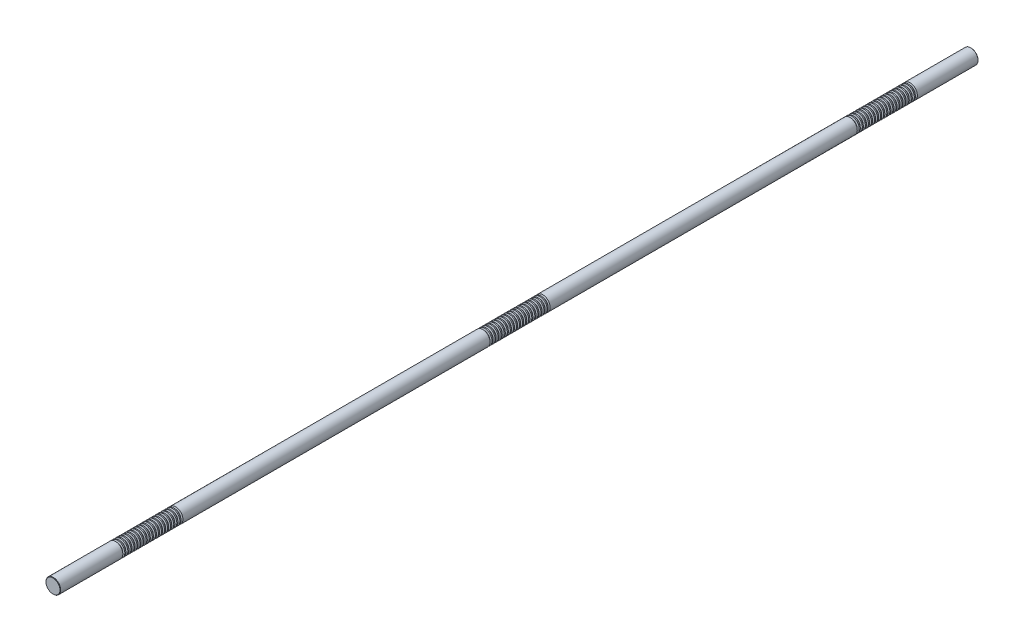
ISO-10303-21;
HEADER;
FILE_DESCRIPTION(('STEP AP214'),'2;1');
FILE_NAME('part.step','',(''),(''),'','','');
FILE_SCHEMA(('AUTOMOTIVE_DESIGN { 1 0 10303 214 1 1 1 1 }'));
ENDSEC;
DATA;
#1=APPLICATION_CONTEXT('core data for automotive mechanical design processes');
#2=APPLICATION_PROTOCOL_DEFINITION('international standard','automotive_design',2000,#1);
#3=PRODUCT_CONTEXT('',#1,'mechanical');
#4=PRODUCT('Part','Part','',(#3));
#5=PRODUCT_RELATED_PRODUCT_CATEGORY('part','',(#4));
#6=PRODUCT_DEFINITION_FORMATION('','',#4);
#7=PRODUCT_DEFINITION_CONTEXT('part definition',#1,'design');
#8=PRODUCT_DEFINITION('design','',#6,#7);
#9=PRODUCT_DEFINITION_SHAPE('','',#8);
#10=(LENGTH_UNIT() NAMED_UNIT(*) SI_UNIT(.MILLI.,.METRE.));
#11=(NAMED_UNIT(*) PLANE_ANGLE_UNIT() SI_UNIT($,.RADIAN.));
#12=(NAMED_UNIT(*) SI_UNIT($,.STERADIAN.) SOLID_ANGLE_UNIT());
#13=UNCERTAINTY_MEASURE_WITH_UNIT(LENGTH_MEASURE(1.E-05),#10,'distance_accuracy_value','');
#14=(GEOMETRIC_REPRESENTATION_CONTEXT(3) GLOBAL_UNCERTAINTY_ASSIGNED_CONTEXT((#13)) GLOBAL_UNIT_ASSIGNED_CONTEXT((#10,
#11,#12)) REPRESENTATION_CONTEXT('',''));
#15=CARTESIAN_POINT('',(0.,0.,0.));
#16=DIRECTION('',(0.,0.,1.));
#17=DIRECTION('',(1.,0.,0.));
#18=AXIS2_PLACEMENT_3D('',#15,#16,#17);
#19=CARTESIAN_POINT('',(0.,0.,750.));
#20=DIRECTION('',(0.,0.,-1.));
#21=DIRECTION('',(-1.,0.,0.));
#22=AXIS2_PLACEMENT_3D('',#19,#20,#21);
#23=CYLINDRICAL_SURFACE('',#22,12.);
#24=CARTESIAN_POINT('',(0.,0.,642.868430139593));
#25=DIRECTION('',(0.,0.,1.));
#26=DIRECTION('',(1.,0.,0.));
#27=AXIS2_PLACEMENT_3D('',#24,#25,#26);
#28=CIRCLE('',#27,12.);
#29=CARTESIAN_POINT('',(12.,0.,642.868430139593));
#30=VERTEX_POINT('',#29);
#31=EDGE_CURVE('E994',#30,#30,#28,.T.);
#32=ORIENTED_EDGE('',*,*,#31,.T.);
#33=EDGE_LOOP('',(#32));
#34=FACE_BOUND('',#33,.T.);
#35=CARTESIAN_POINT('',(0.,0.,644.631569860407));
#36=DIRECTION('',(0.,0.,1.));
#37=DIRECTION('',(1.,0.,0.));
#38=AXIS2_PLACEMENT_3D('',#35,#36,#37);
#39=CIRCLE('',#38,12.);
#40=CARTESIAN_POINT('',(12.,0.,644.631569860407));
#41=VERTEX_POINT('',#40);
#42=EDGE_CURVE('E1006',#41,#41,#39,.T.);
#43=ORIENTED_EDGE('',*,*,#42,.F.);
#44=EDGE_LOOP('',(#43));
#45=FACE_BOUND('',#44,.T.);
#46=ADVANCED_FACE('F37',(#34,#45),#23,.T.);
#47=CARTESIAN_POINT('',(0.,0.,637.868430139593));
#48=DIRECTION('',(0.,0.,1.));
#49=DIRECTION('',(1.,0.,0.));
#50=AXIS2_PLACEMENT_3D('',#47,#48,#49);
#51=CIRCLE('',#50,12.);
#52=CARTESIAN_POINT('',(12.,0.,637.868430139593));
#53=VERTEX_POINT('',#52);
#54=EDGE_CURVE('E979',#53,#53,#51,.T.);
#55=ORIENTED_EDGE('',*,*,#54,.T.);
#56=EDGE_LOOP('',(#55));
#57=FACE_BOUND('',#56,.T.);
#58=CARTESIAN_POINT('',(0.,0.,639.631569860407));
#59=DIRECTION('',(0.,0.,1.));
#60=DIRECTION('',(1.,0.,0.));
#61=AXIS2_PLACEMENT_3D('',#58,#59,#60);
#62=CIRCLE('',#61,12.);
#63=CARTESIAN_POINT('',(12.,0.,639.631569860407));
#64=VERTEX_POINT('',#63);
#65=EDGE_CURVE('E990',#64,#64,#62,.T.);
#66=ORIENTED_EDGE('',*,*,#65,.F.);
#67=EDGE_LOOP('',(#66));
#68=FACE_BOUND('',#67,.T.);
#69=ADVANCED_FACE('F1041',(#57,#68),#23,.T.);
#70=CARTESIAN_POINT('',(0.,0.,632.868430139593));
#71=DIRECTION('',(0.,0.,1.));
#72=DIRECTION('',(1.,0.,0.));
#73=AXIS2_PLACEMENT_3D('',#70,#71,#72);
#74=CIRCLE('',#73,12.);
#75=CARTESIAN_POINT('',(12.,0.,632.868430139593));
#76=VERTEX_POINT('',#75);
#77=EDGE_CURVE('E963',#76,#76,#74,.T.);
#78=ORIENTED_EDGE('',*,*,#77,.T.);
#79=EDGE_LOOP('',(#78));
#80=FACE_BOUND('',#79,.T.);
#81=CARTESIAN_POINT('',(0.,0.,634.631569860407));
#82=DIRECTION('',(0.,0.,1.));
#83=DIRECTION('',(1.,0.,0.));
#84=AXIS2_PLACEMENT_3D('',#81,#82,#83);
#85=CIRCLE('',#84,12.);
#86=CARTESIAN_POINT('',(12.,0.,634.631569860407));
#87=VERTEX_POINT('',#86);
#88=EDGE_CURVE('E975',#87,#87,#85,.T.);
#89=ORIENTED_EDGE('',*,*,#88,.F.);
#90=EDGE_LOOP('',(#89));
#91=FACE_BOUND('',#90,.T.);
#92=ADVANCED_FACE('F1049',(#80,#91),#23,.T.);
#93=CARTESIAN_POINT('',(0.,0.,627.868430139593));
#94=DIRECTION('',(0.,0.,1.));
#95=DIRECTION('',(1.,0.,0.));
#96=AXIS2_PLACEMENT_3D('',#93,#94,#95);
#97=CIRCLE('',#96,12.);
#98=CARTESIAN_POINT('',(12.,0.,627.868430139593));
#99=VERTEX_POINT('',#98);
#100=EDGE_CURVE('E947',#99,#99,#97,.T.);
#101=ORIENTED_EDGE('',*,*,#100,.T.);
#102=EDGE_LOOP('',(#101));
#103=FACE_BOUND('',#102,.T.);
#104=CARTESIAN_POINT('',(0.,0.,629.631569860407));
#105=DIRECTION('',(0.,0.,1.));
#106=DIRECTION('',(1.,0.,0.));
#107=AXIS2_PLACEMENT_3D('',#104,#105,#106);
#108=CIRCLE('',#107,12.);
#109=CARTESIAN_POINT('',(12.,0.,629.631569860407));
#110=VERTEX_POINT('',#109);
#111=EDGE_CURVE('E959',#110,#110,#108,.T.);
#112=ORIENTED_EDGE('',*,*,#111,.F.);
#113=EDGE_LOOP('',(#112));
#114=FACE_BOUND('',#113,.T.);
#115=ADVANCED_FACE('F2332',(#103,#114),#23,.T.);
#116=CARTESIAN_POINT('',(0.,0.,622.868430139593));
#117=DIRECTION('',(0.,0.,1.));
#118=DIRECTION('',(1.,0.,0.));
#119=AXIS2_PLACEMENT_3D('',#116,#117,#118);
#120=CIRCLE('',#119,12.);
#121=CARTESIAN_POINT('',(12.,0.,622.868430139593));
#122=VERTEX_POINT('',#121);
#123=EDGE_CURVE('E931',#122,#122,#120,.T.);
#124=ORIENTED_EDGE('',*,*,#123,.T.);
#125=EDGE_LOOP('',(#124));
#126=FACE_BOUND('',#125,.T.);
#127=CARTESIAN_POINT('',(0.,0.,624.631569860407));
#128=DIRECTION('',(0.,0.,1.));
#129=DIRECTION('',(1.,0.,0.));
#130=AXIS2_PLACEMENT_3D('',#127,#128,#129);
#131=CIRCLE('',#130,12.);
#132=CARTESIAN_POINT('',(12.,0.,624.631569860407));
#133=VERTEX_POINT('',#132);
#134=EDGE_CURVE('E943',#133,#133,#131,.T.);
#135=ORIENTED_EDGE('',*,*,#134,.F.);
#136=EDGE_LOOP('',(#135));
#137=FACE_BOUND('',#136,.T.);
#138=ADVANCED_FACE('F2309',(#126,#137),#23,.T.);
#139=CARTESIAN_POINT('',(0.,0.,617.868430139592));
#140=DIRECTION('',(0.,0.,1.));
#141=DIRECTION('',(1.,0.,0.));
#142=AXIS2_PLACEMENT_3D('',#139,#140,#141);
#143=CIRCLE('',#142,12.);
#144=CARTESIAN_POINT('',(12.,0.,617.868430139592));
#145=VERTEX_POINT('',#144);
#146=EDGE_CURVE('E915',#145,#145,#143,.T.);
#147=ORIENTED_EDGE('',*,*,#146,.T.);
#148=EDGE_LOOP('',(#147));
#149=FACE_BOUND('',#148,.T.);
#150=CARTESIAN_POINT('',(0.,0.,619.631569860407));
#151=DIRECTION('',(0.,0.,1.));
#152=DIRECTION('',(1.,0.,0.));
#153=AXIS2_PLACEMENT_3D('',#150,#151,#152);
#154=CIRCLE('',#153,12.);
#155=CARTESIAN_POINT('',(12.,0.,619.631569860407));
#156=VERTEX_POINT('',#155);
#157=EDGE_CURVE('E927',#156,#156,#154,.T.);
#158=ORIENTED_EDGE('',*,*,#157,.F.);
#159=EDGE_LOOP('',(#158));
#160=FACE_BOUND('',#159,.T.);
#161=ADVANCED_FACE('F2286',(#149,#160),#23,.T.);
#162=CARTESIAN_POINT('',(0.,0.,612.868430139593));
#163=DIRECTION('',(0.,0.,1.));
#164=DIRECTION('',(1.,0.,0.));
#165=AXIS2_PLACEMENT_3D('',#162,#163,#164);
#166=CIRCLE('',#165,12.);
#167=CARTESIAN_POINT('',(12.,0.,612.868430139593));
#168=VERTEX_POINT('',#167);
#169=EDGE_CURVE('E899',#168,#168,#166,.T.);
#170=ORIENTED_EDGE('',*,*,#169,.T.);
#171=EDGE_LOOP('',(#170));
#172=FACE_BOUND('',#171,.T.);
#173=CARTESIAN_POINT('',(0.,0.,614.631569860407));
#174=DIRECTION('',(0.,0.,1.));
#175=DIRECTION('',(1.,0.,0.));
#176=AXIS2_PLACEMENT_3D('',#173,#174,#175);
#177=CIRCLE('',#176,12.);
#178=CARTESIAN_POINT('',(12.,0.,614.631569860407));
#179=VERTEX_POINT('',#178);
#180=EDGE_CURVE('E911',#179,#179,#177,.T.);
#181=ORIENTED_EDGE('',*,*,#180,.F.);
#182=EDGE_LOOP('',(#181));
#183=FACE_BOUND('',#182,.T.);
#184=ADVANCED_FACE('F2263',(#172,#183),#23,.T.);
#185=CARTESIAN_POINT('',(0.,0.,607.868430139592));
#186=DIRECTION('',(0.,0.,1.));
#187=DIRECTION('',(1.,0.,0.));
#188=AXIS2_PLACEMENT_3D('',#185,#186,#187);
#189=CIRCLE('',#188,12.);
#190=CARTESIAN_POINT('',(12.,0.,607.868430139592));
#191=VERTEX_POINT('',#190);
#192=EDGE_CURVE('E883',#191,#191,#189,.T.);
#193=ORIENTED_EDGE('',*,*,#192,.T.);
#194=EDGE_LOOP('',(#193));
#195=FACE_BOUND('',#194,.T.);
#196=CARTESIAN_POINT('',(0.,0.,609.631569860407));
#197=DIRECTION('',(0.,0.,1.));
#198=DIRECTION('',(1.,0.,0.));
#199=AXIS2_PLACEMENT_3D('',#196,#197,#198);
#200=CIRCLE('',#199,12.);
#201=CARTESIAN_POINT('',(12.,0.,609.631569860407));
#202=VERTEX_POINT('',#201);
#203=EDGE_CURVE('E895',#202,#202,#200,.T.);
#204=ORIENTED_EDGE('',*,*,#203,.F.);
#205=EDGE_LOOP('',(#204));
#206=FACE_BOUND('',#205,.T.);
#207=ADVANCED_FACE('F2240',(#195,#206),#23,.T.);
#208=CARTESIAN_POINT('',(0.,0.,602.868430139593));
#209=DIRECTION('',(0.,0.,1.));
#210=DIRECTION('',(1.,0.,0.));
#211=AXIS2_PLACEMENT_3D('',#208,#209,#210);
#212=CIRCLE('',#211,12.);
#213=CARTESIAN_POINT('',(12.,0.,602.868430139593));
#214=VERTEX_POINT('',#213);
#215=EDGE_CURVE('E867',#214,#214,#212,.T.);
#216=ORIENTED_EDGE('',*,*,#215,.T.);
#217=EDGE_LOOP('',(#216));
#218=FACE_BOUND('',#217,.T.);
#219=CARTESIAN_POINT('',(0.,0.,604.631569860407));
#220=DIRECTION('',(0.,0.,1.));
#221=DIRECTION('',(1.,0.,0.));
#222=AXIS2_PLACEMENT_3D('',#219,#220,#221);
#223=CIRCLE('',#222,12.);
#224=CARTESIAN_POINT('',(12.,0.,604.631569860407));
#225=VERTEX_POINT('',#224);
#226=EDGE_CURVE('E879',#225,#225,#223,.T.);
#227=ORIENTED_EDGE('',*,*,#226,.F.);
#228=EDGE_LOOP('',(#227));
#229=FACE_BOUND('',#228,.T.);
#230=ADVANCED_FACE('F2217',(#218,#229),#23,.T.);
#231=CARTESIAN_POINT('',(0.,0.,597.868430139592));
#232=DIRECTION('',(0.,0.,1.));
#233=DIRECTION('',(1.,0.,0.));
#234=AXIS2_PLACEMENT_3D('',#231,#232,#233);
#235=CIRCLE('',#234,12.);
#236=CARTESIAN_POINT('',(12.,0.,597.868430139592));
#237=VERTEX_POINT('',#236);
#238=EDGE_CURVE('E851',#237,#237,#235,.T.);
#239=ORIENTED_EDGE('',*,*,#238,.T.);
#240=EDGE_LOOP('',(#239));
#241=FACE_BOUND('',#240,.T.);
#242=CARTESIAN_POINT('',(0.,0.,599.631569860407));
#243=DIRECTION('',(0.,0.,1.));
#244=DIRECTION('',(1.,0.,0.));
#245=AXIS2_PLACEMENT_3D('',#242,#243,#244);
#246=CIRCLE('',#245,12.);
#247=CARTESIAN_POINT('',(12.,0.,599.631569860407));
#248=VERTEX_POINT('',#247);
#249=EDGE_CURVE('E863',#248,#248,#246,.T.);
#250=ORIENTED_EDGE('',*,*,#249,.F.);
#251=EDGE_LOOP('',(#250));
#252=FACE_BOUND('',#251,.T.);
#253=ADVANCED_FACE('F2194',(#241,#252),#23,.T.);
#254=CARTESIAN_POINT('',(0.,0.,592.868430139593));
#255=DIRECTION('',(0.,0.,1.));
#256=DIRECTION('',(1.,0.,0.));
#257=AXIS2_PLACEMENT_3D('',#254,#255,#256);
#258=CIRCLE('',#257,12.);
#259=CARTESIAN_POINT('',(12.,0.,592.868430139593));
#260=VERTEX_POINT('',#259);
#261=EDGE_CURVE('E835',#260,#260,#258,.T.);
#262=ORIENTED_EDGE('',*,*,#261,.T.);
#263=EDGE_LOOP('',(#262));
#264=FACE_BOUND('',#263,.T.);
#265=CARTESIAN_POINT('',(0.,0.,594.631569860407));
#266=DIRECTION('',(0.,0.,1.));
#267=DIRECTION('',(1.,0.,0.));
#268=AXIS2_PLACEMENT_3D('',#265,#266,#267);
#269=CIRCLE('',#268,12.);
#270=CARTESIAN_POINT('',(12.,0.,594.631569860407));
#271=VERTEX_POINT('',#270);
#272=EDGE_CURVE('E847',#271,#271,#269,.T.);
#273=ORIENTED_EDGE('',*,*,#272,.F.);
#274=EDGE_LOOP('',(#273));
#275=FACE_BOUND('',#274,.T.);
#276=ADVANCED_FACE('F2171',(#264,#275),#23,.T.);
#277=CARTESIAN_POINT('',(0.,0.,587.868430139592));
#278=DIRECTION('',(0.,0.,1.));
#279=DIRECTION('',(1.,0.,0.));
#280=AXIS2_PLACEMENT_3D('',#277,#278,#279);
#281=CIRCLE('',#280,12.);
#282=CARTESIAN_POINT('',(12.,0.,587.868430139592));
#283=VERTEX_POINT('',#282);
#284=EDGE_CURVE('E819',#283,#283,#281,.T.);
#285=ORIENTED_EDGE('',*,*,#284,.T.);
#286=EDGE_LOOP('',(#285));
#287=FACE_BOUND('',#286,.T.);
#288=CARTESIAN_POINT('',(0.,0.,589.631569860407));
#289=DIRECTION('',(0.,0.,1.));
#290=DIRECTION('',(1.,0.,0.));
#291=AXIS2_PLACEMENT_3D('',#288,#289,#290);
#292=CIRCLE('',#291,12.);
#293=CARTESIAN_POINT('',(12.,0.,589.631569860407));
#294=VERTEX_POINT('',#293);
#295=EDGE_CURVE('E831',#294,#294,#292,.T.);
#296=ORIENTED_EDGE('',*,*,#295,.F.);
#297=EDGE_LOOP('',(#296));
#298=FACE_BOUND('',#297,.T.);
#299=ADVANCED_FACE('F2148',(#287,#298),#23,.T.);
#300=CARTESIAN_POINT('',(0.,0.,582.868430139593));
#301=DIRECTION('',(0.,0.,1.));
#302=DIRECTION('',(1.,0.,0.));
#303=AXIS2_PLACEMENT_3D('',#300,#301,#302);
#304=CIRCLE('',#303,12.);
#305=CARTESIAN_POINT('',(12.,0.,582.868430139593));
#306=VERTEX_POINT('',#305);
#307=EDGE_CURVE('E803',#306,#306,#304,.T.);
#308=ORIENTED_EDGE('',*,*,#307,.T.);
#309=EDGE_LOOP('',(#308));
#310=FACE_BOUND('',#309,.T.);
#311=CARTESIAN_POINT('',(0.,0.,584.631569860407));
#312=DIRECTION('',(0.,0.,1.));
#313=DIRECTION('',(1.,0.,0.));
#314=AXIS2_PLACEMENT_3D('',#311,#312,#313);
#315=CIRCLE('',#314,12.);
#316=CARTESIAN_POINT('',(12.,0.,584.631569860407));
#317=VERTEX_POINT('',#316);
#318=EDGE_CURVE('E815',#317,#317,#315,.T.);
#319=ORIENTED_EDGE('',*,*,#318,.F.);
#320=EDGE_LOOP('',(#319));
#321=FACE_BOUND('',#320,.T.);
#322=ADVANCED_FACE('F2125',(#310,#321),#23,.T.);
#323=CARTESIAN_POINT('',(0.,0.,577.868430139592));
#324=DIRECTION('',(0.,0.,1.));
#325=DIRECTION('',(1.,0.,0.));
#326=AXIS2_PLACEMENT_3D('',#323,#324,#325);
#327=CIRCLE('',#326,12.);
#328=CARTESIAN_POINT('',(12.,0.,577.868430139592));
#329=VERTEX_POINT('',#328);
#330=EDGE_CURVE('E787',#329,#329,#327,.T.);
#331=ORIENTED_EDGE('',*,*,#330,.T.);
#332=EDGE_LOOP('',(#331));
#333=FACE_BOUND('',#332,.T.);
#334=CARTESIAN_POINT('',(0.,0.,579.631569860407));
#335=DIRECTION('',(0.,0.,1.));
#336=DIRECTION('',(1.,0.,0.));
#337=AXIS2_PLACEMENT_3D('',#334,#335,#336);
#338=CIRCLE('',#337,12.);
#339=CARTESIAN_POINT('',(12.,0.,579.631569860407));
#340=VERTEX_POINT('',#339);
#341=EDGE_CURVE('E799',#340,#340,#338,.T.);
#342=ORIENTED_EDGE('',*,*,#341,.F.);
#343=EDGE_LOOP('',(#342));
#344=FACE_BOUND('',#343,.T.);
#345=ADVANCED_FACE('F2102',(#333,#344),#23,.T.);
#346=CARTESIAN_POINT('',(0.,0.,572.868430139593));
#347=DIRECTION('',(0.,0.,1.));
#348=DIRECTION('',(1.,0.,0.));
#349=AXIS2_PLACEMENT_3D('',#346,#347,#348);
#350=CIRCLE('',#349,12.);
#351=CARTESIAN_POINT('',(12.,0.,572.868430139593));
#352=VERTEX_POINT('',#351);
#353=EDGE_CURVE('E771',#352,#352,#350,.T.);
#354=ORIENTED_EDGE('',*,*,#353,.T.);
#355=EDGE_LOOP('',(#354));
#356=FACE_BOUND('',#355,.T.);
#357=CARTESIAN_POINT('',(0.,0.,574.631569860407));
#358=DIRECTION('',(0.,0.,1.));
#359=DIRECTION('',(1.,0.,0.));
#360=AXIS2_PLACEMENT_3D('',#357,#358,#359);
#361=CIRCLE('',#360,12.);
#362=CARTESIAN_POINT('',(12.,0.,574.631569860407));
#363=VERTEX_POINT('',#362);
#364=EDGE_CURVE('E783',#363,#363,#361,.T.);
#365=ORIENTED_EDGE('',*,*,#364,.F.);
#366=EDGE_LOOP('',(#365));
#367=FACE_BOUND('',#366,.T.);
#368=ADVANCED_FACE('F2079',(#356,#367),#23,.T.);
#369=CARTESIAN_POINT('',(0.,0.,567.868430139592));
#370=DIRECTION('',(0.,0.,1.));
#371=DIRECTION('',(1.,0.,0.));
#372=AXIS2_PLACEMENT_3D('',#369,#370,#371);
#373=CIRCLE('',#372,12.);
#374=CARTESIAN_POINT('',(12.,0.,567.868430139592));
#375=VERTEX_POINT('',#374);
#376=EDGE_CURVE('E755',#375,#375,#373,.T.);
#377=ORIENTED_EDGE('',*,*,#376,.T.);
#378=EDGE_LOOP('',(#377));
#379=FACE_BOUND('',#378,.T.);
#380=CARTESIAN_POINT('',(0.,0.,569.631569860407));
#381=DIRECTION('',(0.,0.,1.));
#382=DIRECTION('',(1.,0.,0.));
#383=AXIS2_PLACEMENT_3D('',#380,#381,#382);
#384=CIRCLE('',#383,12.);
#385=CARTESIAN_POINT('',(12.,0.,569.631569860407));
#386=VERTEX_POINT('',#385);
#387=EDGE_CURVE('E767',#386,#386,#384,.T.);
#388=ORIENTED_EDGE('',*,*,#387,.F.);
#389=EDGE_LOOP('',(#388));
#390=FACE_BOUND('',#389,.T.);
#391=ADVANCED_FACE('F2056',(#379,#390),#23,.T.);
#392=CARTESIAN_POINT('',(0.,0.,562.868430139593));
#393=DIRECTION('',(0.,0.,1.));
#394=DIRECTION('',(1.,0.,0.));
#395=AXIS2_PLACEMENT_3D('',#392,#393,#394);
#396=CIRCLE('',#395,12.);
#397=CARTESIAN_POINT('',(12.,0.,562.868430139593));
#398=VERTEX_POINT('',#397);
#399=EDGE_CURVE('E739',#398,#398,#396,.T.);
#400=ORIENTED_EDGE('',*,*,#399,.T.);
#401=EDGE_LOOP('',(#400));
#402=FACE_BOUND('',#401,.T.);
#403=CARTESIAN_POINT('',(0.,0.,564.631569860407));
#404=DIRECTION('',(0.,0.,1.));
#405=DIRECTION('',(1.,0.,0.));
#406=AXIS2_PLACEMENT_3D('',#403,#404,#405);
#407=CIRCLE('',#406,12.);
#408=CARTESIAN_POINT('',(12.,0.,564.631569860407));
#409=VERTEX_POINT('',#408);
#410=EDGE_CURVE('E751',#409,#409,#407,.T.);
#411=ORIENTED_EDGE('',*,*,#410,.F.);
#412=EDGE_LOOP('',(#411));
#413=FACE_BOUND('',#412,.T.);
#414=ADVANCED_FACE('F2033',(#402,#413),#23,.T.);
#415=CARTESIAN_POINT('',(0.,0.,557.868430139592));
#416=DIRECTION('',(0.,0.,1.));
#417=DIRECTION('',(1.,0.,0.));
#418=AXIS2_PLACEMENT_3D('',#415,#416,#417);
#419=CIRCLE('',#418,12.);
#420=CARTESIAN_POINT('',(12.,0.,557.868430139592));
#421=VERTEX_POINT('',#420);
#422=EDGE_CURVE('E723',#421,#421,#419,.T.);
#423=ORIENTED_EDGE('',*,*,#422,.T.);
#424=EDGE_LOOP('',(#423));
#425=FACE_BOUND('',#424,.T.);
#426=CARTESIAN_POINT('',(0.,0.,559.631569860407));
#427=DIRECTION('',(0.,0.,1.));
#428=DIRECTION('',(1.,0.,0.));
#429=AXIS2_PLACEMENT_3D('',#426,#427,#428);
#430=CIRCLE('',#429,12.);
#431=CARTESIAN_POINT('',(12.,0.,559.631569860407));
#432=VERTEX_POINT('',#431);
#433=EDGE_CURVE('E735',#432,#432,#430,.T.);
#434=ORIENTED_EDGE('',*,*,#433,.F.);
#435=EDGE_LOOP('',(#434));
#436=FACE_BOUND('',#435,.T.);
#437=ADVANCED_FACE('F2014',(#425,#436),#23,.T.);
#438=CARTESIAN_POINT('',(0.,0.,552.868430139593));
#439=DIRECTION('',(0.,0.,1.));
#440=DIRECTION('',(1.,0.,0.));
#441=AXIS2_PLACEMENT_3D('',#438,#439,#440);
#442=CIRCLE('',#441,12.);
#443=CARTESIAN_POINT('',(12.,0.,552.868430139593));
#444=VERTEX_POINT('',#443);
#445=EDGE_CURVE('E403',#444,#444,#442,.T.);
#446=ORIENTED_EDGE('',*,*,#445,.T.);
#447=EDGE_LOOP('',(#446));
#448=FACE_BOUND('',#447,.T.);
#449=CARTESIAN_POINT('',(0.,0.,554.631569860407));
#450=DIRECTION('',(0.,0.,1.));
#451=DIRECTION('',(1.,0.,0.));
#452=AXIS2_PLACEMENT_3D('',#449,#450,#451);
#453=CIRCLE('',#452,12.);
#454=CARTESIAN_POINT('',(12.,0.,554.631569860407));
#455=VERTEX_POINT('',#454);
#456=EDGE_CURVE('E719',#455,#455,#453,.T.);
#457=ORIENTED_EDGE('',*,*,#456,.F.);
#458=EDGE_LOOP('',(#457));
#459=FACE_BOUND('',#458,.T.);
#460=ADVANCED_FACE('F1963',(#448,#459),#23,.T.);
#461=CARTESIAN_POINT('',(0.,0.,42.8684301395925));
#462=DIRECTION('',(0.,0.,1.));
#463=DIRECTION('',(1.,0.,0.));
#464=AXIS2_PLACEMENT_3D('',#461,#462,#463);
#465=CIRCLE('',#464,12.);
#466=CARTESIAN_POINT('',(12.,0.,42.8684301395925));
#467=VERTEX_POINT('',#466);
#468=EDGE_CURVE('E691',#467,#467,#465,.T.);
#469=ORIENTED_EDGE('',*,*,#468,.T.);
#470=EDGE_LOOP('',(#469));
#471=FACE_BOUND('',#470,.T.);
#472=CARTESIAN_POINT('',(0.,0.,44.6315698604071));
#473=DIRECTION('',(0.,0.,1.));
#474=DIRECTION('',(1.,0.,0.));
#475=AXIS2_PLACEMENT_3D('',#472,#473,#474);
#476=CIRCLE('',#475,12.);
#477=CARTESIAN_POINT('',(12.,0.,44.6315698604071));
#478=VERTEX_POINT('',#477);
#479=EDGE_CURVE('E703',#478,#478,#476,.T.);
#480=ORIENTED_EDGE('',*,*,#479,.F.);
#481=EDGE_LOOP('',(#480));
#482=FACE_BOUND('',#481,.T.);
#483=ADVANCED_FACE('F1939',(#471,#482),#23,.T.);
#484=CARTESIAN_POINT('',(0.,0.,37.8684301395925));
#485=DIRECTION('',(0.,0.,1.));
#486=DIRECTION('',(1.,0.,0.));
#487=AXIS2_PLACEMENT_3D('',#484,#485,#486);
#488=CIRCLE('',#487,12.);
#489=CARTESIAN_POINT('',(12.,0.,37.8684301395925));
#490=VERTEX_POINT('',#489);
#491=EDGE_CURVE('E675',#490,#490,#488,.T.);
#492=ORIENTED_EDGE('',*,*,#491,.T.);
#493=EDGE_LOOP('',(#492));
#494=FACE_BOUND('',#493,.T.);
#495=CARTESIAN_POINT('',(0.,0.,39.6315698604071));
#496=DIRECTION('',(0.,0.,1.));
#497=DIRECTION('',(1.,0.,0.));
#498=AXIS2_PLACEMENT_3D('',#495,#496,#497);
#499=CIRCLE('',#498,12.);
#500=CARTESIAN_POINT('',(12.,0.,39.6315698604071));
#501=VERTEX_POINT('',#500);
#502=EDGE_CURVE('E687',#501,#501,#499,.T.);
#503=ORIENTED_EDGE('',*,*,#502,.F.);
#504=EDGE_LOOP('',(#503));
#505=FACE_BOUND('',#504,.T.);
#506=ADVANCED_FACE('F1916',(#494,#505),#23,.T.);
#507=CARTESIAN_POINT('',(0.,0.,32.8684301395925));
#508=DIRECTION('',(0.,0.,1.));
#509=DIRECTION('',(1.,0.,0.));
#510=AXIS2_PLACEMENT_3D('',#507,#508,#509);
#511=CIRCLE('',#510,12.);
#512=CARTESIAN_POINT('',(12.,0.,32.8684301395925));
#513=VERTEX_POINT('',#512);
#514=EDGE_CURVE('E659',#513,#513,#511,.T.);
#515=ORIENTED_EDGE('',*,*,#514,.T.);
#516=EDGE_LOOP('',(#515));
#517=FACE_BOUND('',#516,.T.);
#518=CARTESIAN_POINT('',(0.,0.,34.6315698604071));
#519=DIRECTION('',(0.,0.,1.));
#520=DIRECTION('',(1.,0.,0.));
#521=AXIS2_PLACEMENT_3D('',#518,#519,#520);
#522=CIRCLE('',#521,12.);
#523=CARTESIAN_POINT('',(12.,0.,34.6315698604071));
#524=VERTEX_POINT('',#523);
#525=EDGE_CURVE('E671',#524,#524,#522,.T.);
#526=ORIENTED_EDGE('',*,*,#525,.F.);
#527=EDGE_LOOP('',(#526));
#528=FACE_BOUND('',#527,.T.);
#529=ADVANCED_FACE('F1893',(#517,#528),#23,.T.);
#530=CARTESIAN_POINT('',(0.,0.,27.8684301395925));
#531=DIRECTION('',(0.,0.,1.));
#532=DIRECTION('',(1.,0.,0.));
#533=AXIS2_PLACEMENT_3D('',#530,#531,#532);
#534=CIRCLE('',#533,12.);
#535=CARTESIAN_POINT('',(12.,0.,27.8684301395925));
#536=VERTEX_POINT('',#535);
#537=EDGE_CURVE('E643',#536,#536,#534,.T.);
#538=ORIENTED_EDGE('',*,*,#537,.T.);
#539=EDGE_LOOP('',(#538));
#540=FACE_BOUND('',#539,.T.);
#541=CARTESIAN_POINT('',(0.,0.,29.631569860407));
#542=DIRECTION('',(0.,0.,1.));
#543=DIRECTION('',(1.,0.,0.));
#544=AXIS2_PLACEMENT_3D('',#541,#542,#543);
#545=CIRCLE('',#544,12.);
#546=CARTESIAN_POINT('',(12.,0.,29.631569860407));
#547=VERTEX_POINT('',#546);
#548=EDGE_CURVE('E655',#547,#547,#545,.T.);
#549=ORIENTED_EDGE('',*,*,#548,.F.);
#550=EDGE_LOOP('',(#549));
#551=FACE_BOUND('',#550,.T.);
#552=ADVANCED_FACE('F1870',(#540,#551),#23,.T.);
#553=CARTESIAN_POINT('',(0.,0.,22.8684301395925));
#554=DIRECTION('',(0.,0.,1.));
#555=DIRECTION('',(1.,0.,0.));
#556=AXIS2_PLACEMENT_3D('',#553,#554,#555);
#557=CIRCLE('',#556,12.);
#558=CARTESIAN_POINT('',(12.,0.,22.8684301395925));
#559=VERTEX_POINT('',#558);
#560=EDGE_CURVE('E627',#559,#559,#557,.T.);
#561=ORIENTED_EDGE('',*,*,#560,.T.);
#562=EDGE_LOOP('',(#561));
#563=FACE_BOUND('',#562,.T.);
#564=CARTESIAN_POINT('',(0.,0.,24.631569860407));
#565=DIRECTION('',(0.,0.,1.));
#566=DIRECTION('',(1.,0.,0.));
#567=AXIS2_PLACEMENT_3D('',#564,#565,#566);
#568=CIRCLE('',#567,12.);
#569=CARTESIAN_POINT('',(12.,0.,24.631569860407));
#570=VERTEX_POINT('',#569);
#571=EDGE_CURVE('E639',#570,#570,#568,.T.);
#572=ORIENTED_EDGE('',*,*,#571,.F.);
#573=EDGE_LOOP('',(#572));
#574=FACE_BOUND('',#573,.T.);
#575=ADVANCED_FACE('F1847',(#563,#574),#23,.T.);
#576=CARTESIAN_POINT('',(0.,0.,17.8684301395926));
#577=DIRECTION('',(0.,0.,1.));
#578=DIRECTION('',(1.,0.,0.));
#579=AXIS2_PLACEMENT_3D('',#576,#577,#578);
#580=CIRCLE('',#579,12.);
#581=CARTESIAN_POINT('',(12.,0.,17.8684301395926));
#582=VERTEX_POINT('',#581);
#583=EDGE_CURVE('E611',#582,#582,#580,.T.);
#584=ORIENTED_EDGE('',*,*,#583,.T.);
#585=EDGE_LOOP('',(#584));
#586=FACE_BOUND('',#585,.T.);
#587=CARTESIAN_POINT('',(0.,0.,19.631569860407));
#588=DIRECTION('',(0.,0.,1.));
#589=DIRECTION('',(1.,0.,0.));
#590=AXIS2_PLACEMENT_3D('',#587,#588,#589);
#591=CIRCLE('',#590,12.);
#592=CARTESIAN_POINT('',(12.,0.,19.631569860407));
#593=VERTEX_POINT('',#592);
#594=EDGE_CURVE('E623',#593,#593,#591,.T.);
#595=ORIENTED_EDGE('',*,*,#594,.F.);
#596=EDGE_LOOP('',(#595));
#597=FACE_BOUND('',#596,.T.);
#598=ADVANCED_FACE('F1824',(#586,#597),#23,.T.);
#599=CARTESIAN_POINT('',(0.,0.,12.8684301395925));
#600=DIRECTION('',(0.,0.,1.));
#601=DIRECTION('',(1.,0.,0.));
#602=AXIS2_PLACEMENT_3D('',#599,#600,#601);
#603=CIRCLE('',#602,12.);
#604=CARTESIAN_POINT('',(12.,0.,12.8684301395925));
#605=VERTEX_POINT('',#604);
#606=EDGE_CURVE('E595',#605,#605,#603,.T.);
#607=ORIENTED_EDGE('',*,*,#606,.T.);
#608=EDGE_LOOP('',(#607));
#609=FACE_BOUND('',#608,.T.);
#610=CARTESIAN_POINT('',(0.,0.,14.6315698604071));
#611=DIRECTION('',(0.,0.,1.));
#612=DIRECTION('',(1.,0.,0.));
#613=AXIS2_PLACEMENT_3D('',#610,#611,#612);
#614=CIRCLE('',#613,12.);
#615=CARTESIAN_POINT('',(12.,0.,14.6315698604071));
#616=VERTEX_POINT('',#615);
#617=EDGE_CURVE('E607',#616,#616,#614,.T.);
#618=ORIENTED_EDGE('',*,*,#617,.F.);
#619=EDGE_LOOP('',(#618));
#620=FACE_BOUND('',#619,.T.);
#621=ADVANCED_FACE('F1801',(#609,#620),#23,.T.);
#622=CARTESIAN_POINT('',(0.,0.,7.8684301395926));
#623=DIRECTION('',(0.,0.,1.));
#624=DIRECTION('',(1.,0.,0.));
#625=AXIS2_PLACEMENT_3D('',#622,#623,#624);
#626=CIRCLE('',#625,12.);
#627=CARTESIAN_POINT('',(12.,0.,7.8684301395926));
#628=VERTEX_POINT('',#627);
#629=EDGE_CURVE('E579',#628,#628,#626,.T.);
#630=ORIENTED_EDGE('',*,*,#629,.T.);
#631=EDGE_LOOP('',(#630));
#632=FACE_BOUND('',#631,.T.);
#633=CARTESIAN_POINT('',(0.,0.,9.63156986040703));
#634=DIRECTION('',(0.,0.,1.));
#635=DIRECTION('',(1.,0.,0.));
#636=AXIS2_PLACEMENT_3D('',#633,#634,#635);
#637=CIRCLE('',#636,12.);
#638=CARTESIAN_POINT('',(12.,0.,9.63156986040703));
#639=VERTEX_POINT('',#638);
#640=EDGE_CURVE('E591',#639,#639,#637,.T.);
#641=ORIENTED_EDGE('',*,*,#640,.F.);
#642=EDGE_LOOP('',(#641));
#643=FACE_BOUND('',#642,.T.);
#644=ADVANCED_FACE('F1778',(#632,#643),#23,.T.);
#645=CARTESIAN_POINT('',(0.,0.,2.86843013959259));
#646=DIRECTION('',(0.,0.,1.));
#647=DIRECTION('',(1.,0.,0.));
#648=AXIS2_PLACEMENT_3D('',#645,#646,#647);
#649=CIRCLE('',#648,12.);
#650=CARTESIAN_POINT('',(12.,0.,2.86843013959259));
#651=VERTEX_POINT('',#650);
#652=EDGE_CURVE('E563',#651,#651,#649,.T.);
#653=ORIENTED_EDGE('',*,*,#652,.T.);
#654=EDGE_LOOP('',(#653));
#655=FACE_BOUND('',#654,.T.);
#656=CARTESIAN_POINT('',(0.,0.,4.63156986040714));
#657=DIRECTION('',(0.,0.,1.));
#658=DIRECTION('',(1.,0.,0.));
#659=AXIS2_PLACEMENT_3D('',#656,#657,#658);
#660=CIRCLE('',#659,12.);
#661=CARTESIAN_POINT('',(12.,0.,4.63156986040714));
#662=VERTEX_POINT('',#661);
#663=EDGE_CURVE('E575',#662,#662,#660,.T.);
#664=ORIENTED_EDGE('',*,*,#663,.F.);
#665=EDGE_LOOP('',(#664));
#666=FACE_BOUND('',#665,.T.);
#667=ADVANCED_FACE('F1755',(#655,#666),#23,.T.);
#668=CARTESIAN_POINT('',(0.,0.,-2.13156986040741));
#669=DIRECTION('',(0.,0.,1.));
#670=DIRECTION('',(1.,0.,0.));
#671=AXIS2_PLACEMENT_3D('',#668,#669,#670);
#672=CIRCLE('',#671,12.);
#673=CARTESIAN_POINT('',(12.,0.,-2.13156986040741));
#674=VERTEX_POINT('',#673);
#675=EDGE_CURVE('E547',#674,#674,#672,.T.);
#676=ORIENTED_EDGE('',*,*,#675,.T.);
#677=EDGE_LOOP('',(#676));
#678=FACE_BOUND('',#677,.T.);
#679=CARTESIAN_POINT('',(0.,0.,-0.368430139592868));
#680=DIRECTION('',(0.,0.,1.));
#681=DIRECTION('',(1.,0.,0.));
#682=AXIS2_PLACEMENT_3D('',#679,#680,#681);
#683=CIRCLE('',#682,12.);
#684=CARTESIAN_POINT('',(12.,0.,-0.368430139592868));
#685=VERTEX_POINT('',#684);
#686=EDGE_CURVE('E559',#685,#685,#683,.T.);
#687=ORIENTED_EDGE('',*,*,#686,.F.);
#688=EDGE_LOOP('',(#687));
#689=FACE_BOUND('',#688,.T.);
#690=ADVANCED_FACE('F1732',(#678,#689),#23,.T.);
#691=CARTESIAN_POINT('',(0.,0.,-7.13156986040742));
#692=DIRECTION('',(0.,0.,1.));
#693=DIRECTION('',(1.,0.,0.));
#694=AXIS2_PLACEMENT_3D('',#691,#692,#693);
#695=CIRCLE('',#694,12.);
#696=CARTESIAN_POINT('',(12.,0.,-7.13156986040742));
#697=VERTEX_POINT('',#696);
#698=EDGE_CURVE('E531',#697,#697,#695,.T.);
#699=ORIENTED_EDGE('',*,*,#698,.T.);
#700=EDGE_LOOP('',(#699));
#701=FACE_BOUND('',#700,.T.);
#702=CARTESIAN_POINT('',(0.,0.,-5.36843013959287));
#703=DIRECTION('',(0.,0.,1.));
#704=DIRECTION('',(1.,0.,0.));
#705=AXIS2_PLACEMENT_3D('',#702,#703,#704);
#706=CIRCLE('',#705,12.);
#707=CARTESIAN_POINT('',(12.,0.,-5.36843013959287));
#708=VERTEX_POINT('',#707);
#709=EDGE_CURVE('E543',#708,#708,#706,.T.);
#710=ORIENTED_EDGE('',*,*,#709,.F.);
#711=EDGE_LOOP('',(#710));
#712=FACE_BOUND('',#711,.T.);
#713=ADVANCED_FACE('F1709',(#701,#712),#23,.T.);
#714=CARTESIAN_POINT('',(0.,0.,-12.1315698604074));
#715=DIRECTION('',(0.,0.,1.));
#716=DIRECTION('',(1.,0.,0.));
#717=AXIS2_PLACEMENT_3D('',#714,#715,#716);
#718=CIRCLE('',#717,12.);
#719=CARTESIAN_POINT('',(12.,0.,-12.1315698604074));
#720=VERTEX_POINT('',#719);
#721=EDGE_CURVE('E515',#720,#720,#718,.T.);
#722=ORIENTED_EDGE('',*,*,#721,.T.);
#723=EDGE_LOOP('',(#722));
#724=FACE_BOUND('',#723,.T.);
#725=CARTESIAN_POINT('',(0.,0.,-10.3684301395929));
#726=DIRECTION('',(0.,0.,1.));
#727=DIRECTION('',(1.,0.,0.));
#728=AXIS2_PLACEMENT_3D('',#725,#726,#727);
#729=CIRCLE('',#728,12.);
#730=CARTESIAN_POINT('',(12.,0.,-10.3684301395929));
#731=VERTEX_POINT('',#730);
#732=EDGE_CURVE('E527',#731,#731,#729,.T.);
#733=ORIENTED_EDGE('',*,*,#732,.F.);
#734=EDGE_LOOP('',(#733));
#735=FACE_BOUND('',#734,.T.);
#736=ADVANCED_FACE('F1686',(#724,#735),#23,.T.);
#737=CARTESIAN_POINT('',(0.,0.,-17.1315698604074));
#738=DIRECTION('',(0.,0.,1.));
#739=DIRECTION('',(1.,0.,0.));
#740=AXIS2_PLACEMENT_3D('',#737,#738,#739);
#741=CIRCLE('',#740,12.);
#742=CARTESIAN_POINT('',(12.,0.,-17.1315698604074));
#743=VERTEX_POINT('',#742);
#744=EDGE_CURVE('E499',#743,#743,#741,.T.);
#745=ORIENTED_EDGE('',*,*,#744,.T.);
#746=EDGE_LOOP('',(#745));
#747=FACE_BOUND('',#746,.T.);
#748=CARTESIAN_POINT('',(0.,0.,-15.3684301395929));
#749=DIRECTION('',(0.,0.,1.));
#750=DIRECTION('',(1.,0.,0.));
#751=AXIS2_PLACEMENT_3D('',#748,#749,#750);
#752=CIRCLE('',#751,12.);
#753=CARTESIAN_POINT('',(12.,0.,-15.3684301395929));
#754=VERTEX_POINT('',#753);
#755=EDGE_CURVE('E511',#754,#754,#752,.T.);
#756=ORIENTED_EDGE('',*,*,#755,.F.);
#757=EDGE_LOOP('',(#756));
#758=FACE_BOUND('',#757,.T.);
#759=ADVANCED_FACE('F1663',(#747,#758),#23,.T.);
#760=CARTESIAN_POINT('',(0.,0.,-22.1315698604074));
#761=DIRECTION('',(0.,0.,1.));
#762=DIRECTION('',(1.,0.,0.));
#763=AXIS2_PLACEMENT_3D('',#760,#761,#762);
#764=CIRCLE('',#763,12.);
#765=CARTESIAN_POINT('',(12.,0.,-22.1315698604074));
#766=VERTEX_POINT('',#765);
#767=EDGE_CURVE('E483',#766,#766,#764,.T.);
#768=ORIENTED_EDGE('',*,*,#767,.T.);
#769=EDGE_LOOP('',(#768));
#770=FACE_BOUND('',#769,.T.);
#771=CARTESIAN_POINT('',(0.,0.,-20.3684301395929));
#772=DIRECTION('',(0.,0.,1.));
#773=DIRECTION('',(1.,0.,0.));
#774=AXIS2_PLACEMENT_3D('',#771,#772,#773);
#775=CIRCLE('',#774,12.);
#776=CARTESIAN_POINT('',(12.,0.,-20.3684301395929));
#777=VERTEX_POINT('',#776);
#778=EDGE_CURVE('E495',#777,#777,#775,.T.);
#779=ORIENTED_EDGE('',*,*,#778,.F.);
#780=EDGE_LOOP('',(#779));
#781=FACE_BOUND('',#780,.T.);
#782=ADVANCED_FACE('F1640',(#770,#781),#23,.T.);
#783=CARTESIAN_POINT('',(0.,0.,-27.1315698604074));
#784=DIRECTION('',(0.,0.,1.));
#785=DIRECTION('',(1.,0.,0.));
#786=AXIS2_PLACEMENT_3D('',#783,#784,#785);
#787=CIRCLE('',#786,12.);
#788=CARTESIAN_POINT('',(12.,0.,-27.1315698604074));
#789=VERTEX_POINT('',#788);
#790=EDGE_CURVE('E467',#789,#789,#787,.T.);
#791=ORIENTED_EDGE('',*,*,#790,.T.);
#792=EDGE_LOOP('',(#791));
#793=FACE_BOUND('',#792,.T.);
#794=CARTESIAN_POINT('',(0.,0.,-25.3684301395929));
#795=DIRECTION('',(0.,0.,1.));
#796=DIRECTION('',(1.,0.,0.));
#797=AXIS2_PLACEMENT_3D('',#794,#795,#796);
#798=CIRCLE('',#797,12.);
#799=CARTESIAN_POINT('',(12.,0.,-25.3684301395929));
#800=VERTEX_POINT('',#799);
#801=EDGE_CURVE('E479',#800,#800,#798,.T.);
#802=ORIENTED_EDGE('',*,*,#801,.F.);
#803=EDGE_LOOP('',(#802));
#804=FACE_BOUND('',#803,.T.);
#805=ADVANCED_FACE('F1617',(#793,#804),#23,.T.);
#806=CARTESIAN_POINT('',(0.,0.,-32.1315698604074));
#807=DIRECTION('',(0.,0.,1.));
#808=DIRECTION('',(1.,0.,0.));
#809=AXIS2_PLACEMENT_3D('',#806,#807,#808);
#810=CIRCLE('',#809,12.);
#811=CARTESIAN_POINT('',(12.,0.,-32.1315698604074));
#812=VERTEX_POINT('',#811);
#813=EDGE_CURVE('E451',#812,#812,#810,.T.);
#814=ORIENTED_EDGE('',*,*,#813,.T.);
#815=EDGE_LOOP('',(#814));
#816=FACE_BOUND('',#815,.T.);
#817=CARTESIAN_POINT('',(0.,0.,-30.3684301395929));
#818=DIRECTION('',(0.,0.,1.));
#819=DIRECTION('',(1.,0.,0.));
#820=AXIS2_PLACEMENT_3D('',#817,#818,#819);
#821=CIRCLE('',#820,12.);
#822=CARTESIAN_POINT('',(12.,0.,-30.3684301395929));
#823=VERTEX_POINT('',#822);
#824=EDGE_CURVE('E463',#823,#823,#821,.T.);
#825=ORIENTED_EDGE('',*,*,#824,.F.);
#826=EDGE_LOOP('',(#825));
#827=FACE_BOUND('',#826,.T.);
#828=ADVANCED_FACE('F1594',(#816,#827),#23,.T.);
#829=CARTESIAN_POINT('',(0.,0.,-37.1315698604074));
#830=DIRECTION('',(0.,0.,1.));
#831=DIRECTION('',(1.,0.,0.));
#832=AXIS2_PLACEMENT_3D('',#829,#830,#831);
#833=CIRCLE('',#832,12.);
#834=CARTESIAN_POINT('',(12.,0.,-37.1315698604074));
#835=VERTEX_POINT('',#834);
#836=EDGE_CURVE('E435',#835,#835,#833,.T.);
#837=ORIENTED_EDGE('',*,*,#836,.T.);
#838=EDGE_LOOP('',(#837));
#839=FACE_BOUND('',#838,.T.);
#840=CARTESIAN_POINT('',(0.,0.,-35.3684301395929));
#841=DIRECTION('',(0.,0.,1.));
#842=DIRECTION('',(1.,0.,0.));
#843=AXIS2_PLACEMENT_3D('',#840,#841,#842);
#844=CIRCLE('',#843,12.);
#845=CARTESIAN_POINT('',(12.,0.,-35.3684301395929));
#846=VERTEX_POINT('',#845);
#847=EDGE_CURVE('E447',#846,#846,#844,.T.);
#848=ORIENTED_EDGE('',*,*,#847,.F.);
#849=EDGE_LOOP('',(#848));
#850=FACE_BOUND('',#849,.T.);
#851=ADVANCED_FACE('F1571',(#839,#850),#23,.T.);
#852=CARTESIAN_POINT('',(0.,0.,-42.1315698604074));
#853=DIRECTION('',(0.,0.,1.));
#854=DIRECTION('',(1.,0.,0.));
#855=AXIS2_PLACEMENT_3D('',#852,#853,#854);
#856=CIRCLE('',#855,12.);
#857=CARTESIAN_POINT('',(12.,0.,-42.1315698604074));
#858=VERTEX_POINT('',#857);
#859=EDGE_CURVE('E419',#858,#858,#856,.T.);
#860=ORIENTED_EDGE('',*,*,#859,.T.);
#861=EDGE_LOOP('',(#860));
#862=FACE_BOUND('',#861,.T.);
#863=CARTESIAN_POINT('',(0.,0.,-40.3684301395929));
#864=DIRECTION('',(0.,0.,1.));
#865=DIRECTION('',(1.,0.,0.));
#866=AXIS2_PLACEMENT_3D('',#863,#864,#865);
#867=CIRCLE('',#866,12.);
#868=CARTESIAN_POINT('',(12.,0.,-40.3684301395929));
#869=VERTEX_POINT('',#868);
#870=EDGE_CURVE('E431',#869,#869,#867,.T.);
#871=ORIENTED_EDGE('',*,*,#870,.F.);
#872=EDGE_LOOP('',(#871));
#873=FACE_BOUND('',#872,.T.);
#874=ADVANCED_FACE('F1548',(#862,#873),#23,.T.);
#875=CARTESIAN_POINT('',(0.,0.,-47.1315698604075));
#876=DIRECTION('',(0.,0.,1.));
#877=DIRECTION('',(1.,0.,0.));
#878=AXIS2_PLACEMENT_3D('',#875,#876,#877);
#879=CIRCLE('',#878,12.);
#880=CARTESIAN_POINT('',(12.,0.,-47.1315698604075));
#881=VERTEX_POINT('',#880);
#882=EDGE_CURVE('E387',#881,#881,#879,.T.);
#883=ORIENTED_EDGE('',*,*,#882,.T.);
#884=EDGE_LOOP('',(#883));
#885=FACE_BOUND('',#884,.T.);
#886=CARTESIAN_POINT('',(0.,0.,-45.3684301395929));
#887=DIRECTION('',(0.,0.,1.));
#888=DIRECTION('',(1.,0.,0.));
#889=AXIS2_PLACEMENT_3D('',#886,#887,#888);
#890=CIRCLE('',#889,12.);
#891=CARTESIAN_POINT('',(12.,0.,-45.3684301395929));
#892=VERTEX_POINT('',#891);
#893=EDGE_CURVE('E415',#892,#892,#890,.T.);
#894=ORIENTED_EDGE('',*,*,#893,.F.);
#895=EDGE_LOOP('',(#894));
#896=FACE_BOUND('',#895,.T.);
#897=ADVANCED_FACE('F1525',(#885,#896),#23,.T.);
#898=CARTESIAN_POINT('',(0.,0.,-552.131569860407));
#899=DIRECTION('',(0.,0.,1.));
#900=DIRECTION('',(1.,0.,0.));
#901=AXIS2_PLACEMENT_3D('',#898,#899,#900);
#902=CIRCLE('',#901,12.);
#903=CARTESIAN_POINT('',(12.,0.,-552.131569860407));
#904=VERTEX_POINT('',#903);
#905=EDGE_CURVE('E371',#904,#904,#902,.T.);
#906=ORIENTED_EDGE('',*,*,#905,.T.);
#907=EDGE_LOOP('',(#906));
#908=FACE_BOUND('',#907,.T.);
#909=CARTESIAN_POINT('',(0.,0.,-50.3684301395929));
#910=DIRECTION('',(0.,0.,1.));
#911=DIRECTION('',(1.,0.,0.));
#912=AXIS2_PLACEMENT_3D('',#909,#910,#911);
#913=CIRCLE('',#912,12.);
#914=CARTESIAN_POINT('',(12.,0.,-50.3684301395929));
#915=VERTEX_POINT('',#914);
#916=EDGE_CURVE('E383',#915,#915,#913,.T.);
#917=ORIENTED_EDGE('',*,*,#916,.F.);
#918=EDGE_LOOP('',(#917));
#919=FACE_BOUND('',#918,.T.);
#920=ADVANCED_FACE('F1502',(#908,#919),#23,.T.);
#921=CARTESIAN_POINT('',(0.,0.,-557.131569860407));
#922=DIRECTION('',(0.,0.,1.));
#923=DIRECTION('',(1.,0.,0.));
#924=AXIS2_PLACEMENT_3D('',#921,#922,#923);
#925=CIRCLE('',#924,12.);
#926=CARTESIAN_POINT('',(12.,0.,-557.131569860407));
#927=VERTEX_POINT('',#926);
#928=EDGE_CURVE('E355',#927,#927,#925,.T.);
#929=ORIENTED_EDGE('',*,*,#928,.T.);
#930=EDGE_LOOP('',(#929));
#931=FACE_BOUND('',#930,.T.);
#932=CARTESIAN_POINT('',(0.,0.,-555.368430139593));
#933=DIRECTION('',(0.,0.,1.));
#934=DIRECTION('',(1.,0.,0.));
#935=AXIS2_PLACEMENT_3D('',#932,#933,#934);
#936=CIRCLE('',#935,12.);
#937=CARTESIAN_POINT('',(12.,0.,-555.368430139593));
#938=VERTEX_POINT('',#937);
#939=EDGE_CURVE('E367',#938,#938,#936,.T.);
#940=ORIENTED_EDGE('',*,*,#939,.F.);
#941=EDGE_LOOP('',(#940));
#942=FACE_BOUND('',#941,.T.);
#943=ADVANCED_FACE('F1479',(#931,#942),#23,.T.);
#944=CARTESIAN_POINT('',(0.,0.,-562.131569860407));
#945=DIRECTION('',(0.,0.,1.));
#946=DIRECTION('',(1.,0.,0.));
#947=AXIS2_PLACEMENT_3D('',#944,#945,#946);
#948=CIRCLE('',#947,12.);
#949=CARTESIAN_POINT('',(12.,0.,-562.131569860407));
#950=VERTEX_POINT('',#949);
#951=EDGE_CURVE('E339',#950,#950,#948,.T.);
#952=ORIENTED_EDGE('',*,*,#951,.T.);
#953=EDGE_LOOP('',(#952));
#954=FACE_BOUND('',#953,.T.);
#955=CARTESIAN_POINT('',(0.,0.,-560.368430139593));
#956=DIRECTION('',(0.,0.,1.));
#957=DIRECTION('',(1.,0.,0.));
#958=AXIS2_PLACEMENT_3D('',#955,#956,#957);
#959=CIRCLE('',#958,12.);
#960=CARTESIAN_POINT('',(12.,0.,-560.368430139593));
#961=VERTEX_POINT('',#960);
#962=EDGE_CURVE('E351',#961,#961,#959,.T.);
#963=ORIENTED_EDGE('',*,*,#962,.F.);
#964=EDGE_LOOP('',(#963));
#965=FACE_BOUND('',#964,.T.);
#966=ADVANCED_FACE('F1456',(#954,#965),#23,.T.);
#967=CARTESIAN_POINT('',(0.,0.,-567.131569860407));
#968=DIRECTION('',(0.,0.,1.));
#969=DIRECTION('',(1.,0.,0.));
#970=AXIS2_PLACEMENT_3D('',#967,#968,#969);
#971=CIRCLE('',#970,12.);
#972=CARTESIAN_POINT('',(12.,0.,-567.131569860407));
#973=VERTEX_POINT('',#972);
#974=EDGE_CURVE('E324',#973,#973,#971,.T.);
#975=ORIENTED_EDGE('',*,*,#974,.T.);
#976=EDGE_LOOP('',(#975));
#977=FACE_BOUND('',#976,.T.);
#978=CARTESIAN_POINT('',(0.,0.,-565.368430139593));
#979=DIRECTION('',(0.,0.,1.));
#980=DIRECTION('',(1.,0.,0.));
#981=AXIS2_PLACEMENT_3D('',#978,#979,#980);
#982=CIRCLE('',#981,12.);
#983=CARTESIAN_POINT('',(12.,0.,-565.368430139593));
#984=VERTEX_POINT('',#983);
#985=EDGE_CURVE('E335',#984,#984,#982,.T.);
#986=ORIENTED_EDGE('',*,*,#985,.F.);
#987=EDGE_LOOP('',(#986));
#988=FACE_BOUND('',#987,.T.);
#989=ADVANCED_FACE('F1433',(#977,#988),#23,.T.);
#990=CARTESIAN_POINT('',(0.,0.,-572.131569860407));
#991=DIRECTION('',(0.,0.,1.));
#992=DIRECTION('',(1.,0.,0.));
#993=AXIS2_PLACEMENT_3D('',#990,#991,#992);
#994=CIRCLE('',#993,12.);
#995=CARTESIAN_POINT('',(12.,0.,-572.131569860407));
#996=VERTEX_POINT('',#995);
#997=EDGE_CURVE('E308',#996,#996,#994,.T.);
#998=ORIENTED_EDGE('',*,*,#997,.T.);
#999=EDGE_LOOP('',(#998));
#1000=FACE_BOUND('',#999,.T.);
#1001=CARTESIAN_POINT('',(0.,0.,-570.368430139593));
#1002=DIRECTION('',(0.,0.,1.));
#1003=DIRECTION('',(1.,0.,0.));
#1004=AXIS2_PLACEMENT_3D('',#1001,#1002,#1003);
#1005=CIRCLE('',#1004,12.);
#1006=CARTESIAN_POINT('',(12.,0.,-570.368430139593));
#1007=VERTEX_POINT('',#1006);
#1008=EDGE_CURVE('E320',#1007,#1007,#1005,.T.);
#1009=ORIENTED_EDGE('',*,*,#1008,.F.);
#1010=EDGE_LOOP('',(#1009));
#1011=FACE_BOUND('',#1010,.T.);
#1012=ADVANCED_FACE('F1410',(#1000,#1011),#23,.T.);
#1013=CARTESIAN_POINT('',(0.,0.,-577.131569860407));
#1014=DIRECTION('',(0.,0.,1.));
#1015=DIRECTION('',(1.,0.,0.));
#1016=AXIS2_PLACEMENT_3D('',#1013,#1014,#1015);
#1017=CIRCLE('',#1016,12.);
#1018=CARTESIAN_POINT('',(12.,0.,-577.131569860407));
#1019=VERTEX_POINT('',#1018);
#1020=EDGE_CURVE('E292',#1019,#1019,#1017,.T.);
#1021=ORIENTED_EDGE('',*,*,#1020,.T.);
#1022=EDGE_LOOP('',(#1021));
#1023=FACE_BOUND('',#1022,.T.);
#1024=CARTESIAN_POINT('',(0.,0.,-575.368430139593));
#1025=DIRECTION('',(0.,0.,1.));
#1026=DIRECTION('',(1.,0.,0.));
#1027=AXIS2_PLACEMENT_3D('',#1024,#1025,#1026);
#1028=CIRCLE('',#1027,12.);
#1029=CARTESIAN_POINT('',(12.,0.,-575.368430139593));
#1030=VERTEX_POINT('',#1029);
#1031=EDGE_CURVE('E304',#1030,#1030,#1028,.T.);
#1032=ORIENTED_EDGE('',*,*,#1031,.F.);
#1033=EDGE_LOOP('',(#1032));
#1034=FACE_BOUND('',#1033,.T.);
#1035=ADVANCED_FACE('F1387',(#1023,#1034),#23,.T.);
#1036=CARTESIAN_POINT('',(0.,0.,-582.131569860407));
#1037=DIRECTION('',(0.,0.,1.));
#1038=DIRECTION('',(1.,0.,0.));
#1039=AXIS2_PLACEMENT_3D('',#1036,#1037,#1038);
#1040=CIRCLE('',#1039,12.);
#1041=CARTESIAN_POINT('',(12.,0.,-582.131569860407));
#1042=VERTEX_POINT('',#1041);
#1043=EDGE_CURVE('E276',#1042,#1042,#1040,.T.);
#1044=ORIENTED_EDGE('',*,*,#1043,.T.);
#1045=EDGE_LOOP('',(#1044));
#1046=FACE_BOUND('',#1045,.T.);
#1047=CARTESIAN_POINT('',(0.,0.,-580.368430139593));
#1048=DIRECTION('',(0.,0.,1.));
#1049=DIRECTION('',(1.,0.,0.));
#1050=AXIS2_PLACEMENT_3D('',#1047,#1048,#1049);
#1051=CIRCLE('',#1050,12.);
#1052=CARTESIAN_POINT('',(12.,0.,-580.368430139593));
#1053=VERTEX_POINT('',#1052);
#1054=EDGE_CURVE('E288',#1053,#1053,#1051,.T.);
#1055=ORIENTED_EDGE('',*,*,#1054,.F.);
#1056=EDGE_LOOP('',(#1055));
#1057=FACE_BOUND('',#1056,.T.);
#1058=ADVANCED_FACE('F1364',(#1046,#1057),#23,.T.);
#1059=CARTESIAN_POINT('',(0.,0.,-587.131569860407));
#1060=DIRECTION('',(0.,0.,1.));
#1061=DIRECTION('',(1.,0.,0.));
#1062=AXIS2_PLACEMENT_3D('',#1059,#1060,#1061);
#1063=CIRCLE('',#1062,12.);
#1064=CARTESIAN_POINT('',(12.,0.,-587.131569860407));
#1065=VERTEX_POINT('',#1064);
#1066=EDGE_CURVE('E260',#1065,#1065,#1063,.T.);
#1067=ORIENTED_EDGE('',*,*,#1066,.T.);
#1068=EDGE_LOOP('',(#1067));
#1069=FACE_BOUND('',#1068,.T.);
#1070=CARTESIAN_POINT('',(0.,0.,-585.368430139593));
#1071=DIRECTION('',(0.,0.,1.));
#1072=DIRECTION('',(1.,0.,0.));
#1073=AXIS2_PLACEMENT_3D('',#1070,#1071,#1072);
#1074=CIRCLE('',#1073,12.);
#1075=CARTESIAN_POINT('',(12.,0.,-585.368430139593));
#1076=VERTEX_POINT('',#1075);
#1077=EDGE_CURVE('E272',#1076,#1076,#1074,.T.);
#1078=ORIENTED_EDGE('',*,*,#1077,.F.);
#1079=EDGE_LOOP('',(#1078));
#1080=FACE_BOUND('',#1079,.T.);
#1081=ADVANCED_FACE('F1341',(#1069,#1080),#23,.T.);
#1082=CARTESIAN_POINT('',(0.,0.,-592.131569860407));
#1083=DIRECTION('',(0.,0.,1.));
#1084=DIRECTION('',(1.,0.,0.));
#1085=AXIS2_PLACEMENT_3D('',#1082,#1083,#1084);
#1086=CIRCLE('',#1085,12.);
#1087=CARTESIAN_POINT('',(12.,0.,-592.131569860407));
#1088=VERTEX_POINT('',#1087);
#1089=EDGE_CURVE('E244',#1088,#1088,#1086,.T.);
#1090=ORIENTED_EDGE('',*,*,#1089,.T.);
#1091=EDGE_LOOP('',(#1090));
#1092=FACE_BOUND('',#1091,.T.);
#1093=CARTESIAN_POINT('',(0.,0.,-590.368430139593));
#1094=DIRECTION('',(0.,0.,1.));
#1095=DIRECTION('',(1.,0.,0.));
#1096=AXIS2_PLACEMENT_3D('',#1093,#1094,#1095);
#1097=CIRCLE('',#1096,12.);
#1098=CARTESIAN_POINT('',(12.,0.,-590.368430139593));
#1099=VERTEX_POINT('',#1098);
#1100=EDGE_CURVE('E256',#1099,#1099,#1097,.T.);
#1101=ORIENTED_EDGE('',*,*,#1100,.F.);
#1102=EDGE_LOOP('',(#1101));
#1103=FACE_BOUND('',#1102,.T.);
#1104=ADVANCED_FACE('F1318',(#1092,#1103),#23,.T.);
#1105=CARTESIAN_POINT('',(0.,0.,-597.131569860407));
#1106=DIRECTION('',(0.,0.,1.));
#1107=DIRECTION('',(1.,0.,0.));
#1108=AXIS2_PLACEMENT_3D('',#1105,#1106,#1107);
#1109=CIRCLE('',#1108,12.);
#1110=CARTESIAN_POINT('',(12.,0.,-597.131569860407));
#1111=VERTEX_POINT('',#1110);
#1112=EDGE_CURVE('E228',#1111,#1111,#1109,.T.);
#1113=ORIENTED_EDGE('',*,*,#1112,.T.);
#1114=EDGE_LOOP('',(#1113));
#1115=FACE_BOUND('',#1114,.T.);
#1116=CARTESIAN_POINT('',(0.,0.,-595.368430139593));
#1117=DIRECTION('',(0.,0.,1.));
#1118=DIRECTION('',(1.,0.,0.));
#1119=AXIS2_PLACEMENT_3D('',#1116,#1117,#1118);
#1120=CIRCLE('',#1119,12.);
#1121=CARTESIAN_POINT('',(12.,0.,-595.368430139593));
#1122=VERTEX_POINT('',#1121);
#1123=EDGE_CURVE('E240',#1122,#1122,#1120,.T.);
#1124=ORIENTED_EDGE('',*,*,#1123,.F.);
#1125=EDGE_LOOP('',(#1124));
#1126=FACE_BOUND('',#1125,.T.);
#1127=ADVANCED_FACE('F1295',(#1115,#1126),#23,.T.);
#1128=CARTESIAN_POINT('',(0.,0.,-602.131569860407));
#1129=DIRECTION('',(0.,0.,1.));
#1130=DIRECTION('',(1.,0.,0.));
#1131=AXIS2_PLACEMENT_3D('',#1128,#1129,#1130);
#1132=CIRCLE('',#1131,12.);
#1133=CARTESIAN_POINT('',(12.,0.,-602.131569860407));
#1134=VERTEX_POINT('',#1133);
#1135=EDGE_CURVE('E212',#1134,#1134,#1132,.T.);
#1136=ORIENTED_EDGE('',*,*,#1135,.T.);
#1137=EDGE_LOOP('',(#1136));
#1138=FACE_BOUND('',#1137,.T.);
#1139=CARTESIAN_POINT('',(0.,0.,-600.368430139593));
#1140=DIRECTION('',(0.,0.,1.));
#1141=DIRECTION('',(1.,0.,0.));
#1142=AXIS2_PLACEMENT_3D('',#1139,#1140,#1141);
#1143=CIRCLE('',#1142,12.);
#1144=CARTESIAN_POINT('',(12.,0.,-600.368430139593));
#1145=VERTEX_POINT('',#1144);
#1146=EDGE_CURVE('E224',#1145,#1145,#1143,.T.);
#1147=ORIENTED_EDGE('',*,*,#1146,.F.);
#1148=EDGE_LOOP('',(#1147));
#1149=FACE_BOUND('',#1148,.T.);
#1150=ADVANCED_FACE('F1272',(#1138,#1149),#23,.T.);
#1151=CARTESIAN_POINT('',(0.,0.,-607.131569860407));
#1152=DIRECTION('',(0.,0.,1.));
#1153=DIRECTION('',(1.,0.,0.));
#1154=AXIS2_PLACEMENT_3D('',#1151,#1152,#1153);
#1155=CIRCLE('',#1154,12.);
#1156=CARTESIAN_POINT('',(12.,0.,-607.131569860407));
#1157=VERTEX_POINT('',#1156);
#1158=EDGE_CURVE('E197',#1157,#1157,#1155,.T.);
#1159=ORIENTED_EDGE('',*,*,#1158,.T.);
#1160=EDGE_LOOP('',(#1159));
#1161=FACE_BOUND('',#1160,.T.);
#1162=CARTESIAN_POINT('',(0.,0.,-605.368430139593));
#1163=DIRECTION('',(0.,0.,1.));
#1164=DIRECTION('',(1.,0.,0.));
#1165=AXIS2_PLACEMENT_3D('',#1162,#1163,#1164);
#1166=CIRCLE('',#1165,12.);
#1167=CARTESIAN_POINT('',(12.,0.,-605.368430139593));
#1168=VERTEX_POINT('',#1167);
#1169=EDGE_CURVE('E209',#1168,#1168,#1166,.T.);
#1170=ORIENTED_EDGE('',*,*,#1169,.F.);
#1171=EDGE_LOOP('',(#1170));
#1172=FACE_BOUND('',#1171,.T.);
#1173=ADVANCED_FACE('F1249',(#1161,#1172),#23,.T.);
#1174=CARTESIAN_POINT('',(0.,0.,-612.131569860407));
#1175=DIRECTION('',(0.,0.,1.));
#1176=DIRECTION('',(1.,0.,0.));
#1177=AXIS2_PLACEMENT_3D('',#1174,#1175,#1176);
#1178=CIRCLE('',#1177,12.);
#1179=CARTESIAN_POINT('',(12.,0.,-612.131569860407));
#1180=VERTEX_POINT('',#1179);
#1181=EDGE_CURVE('E181',#1180,#1180,#1178,.T.);
#1182=ORIENTED_EDGE('',*,*,#1181,.T.);
#1183=EDGE_LOOP('',(#1182));
#1184=FACE_BOUND('',#1183,.T.);
#1185=CARTESIAN_POINT('',(0.,0.,-610.368430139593));
#1186=DIRECTION('',(0.,0.,1.));
#1187=DIRECTION('',(1.,0.,0.));
#1188=AXIS2_PLACEMENT_3D('',#1185,#1186,#1187);
#1189=CIRCLE('',#1188,12.);
#1190=CARTESIAN_POINT('',(12.,0.,-610.368430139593));
#1191=VERTEX_POINT('',#1190);
#1192=EDGE_CURVE('E193',#1191,#1191,#1189,.T.);
#1193=ORIENTED_EDGE('',*,*,#1192,.F.);
#1194=EDGE_LOOP('',(#1193));
#1195=FACE_BOUND('',#1194,.T.);
#1196=ADVANCED_FACE('F1226',(#1184,#1195),#23,.T.);
#1197=CARTESIAN_POINT('',(0.,0.,-617.131569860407));
#1198=DIRECTION('',(0.,0.,1.));
#1199=DIRECTION('',(1.,0.,0.));
#1200=AXIS2_PLACEMENT_3D('',#1197,#1198,#1199);
#1201=CIRCLE('',#1200,12.);
#1202=CARTESIAN_POINT('',(12.,0.,-617.131569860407));
#1203=VERTEX_POINT('',#1202);
#1204=EDGE_CURVE('E165',#1203,#1203,#1201,.T.);
#1205=ORIENTED_EDGE('',*,*,#1204,.T.);
#1206=EDGE_LOOP('',(#1205));
#1207=FACE_BOUND('',#1206,.T.);
#1208=CARTESIAN_POINT('',(0.,0.,-615.368430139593));
#1209=DIRECTION('',(0.,0.,1.));
#1210=DIRECTION('',(1.,0.,0.));
#1211=AXIS2_PLACEMENT_3D('',#1208,#1209,#1210);
#1212=CIRCLE('',#1211,12.);
#1213=CARTESIAN_POINT('',(12.,0.,-615.368430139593));
#1214=VERTEX_POINT('',#1213);
#1215=EDGE_CURVE('E177',#1214,#1214,#1212,.T.);
#1216=ORIENTED_EDGE('',*,*,#1215,.F.);
#1217=EDGE_LOOP('',(#1216));
#1218=FACE_BOUND('',#1217,.T.);
#1219=ADVANCED_FACE('F1203',(#1207,#1218),#23,.T.);
#1220=CARTESIAN_POINT('',(0.,0.,-622.131569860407));
#1221=DIRECTION('',(0.,0.,1.));
#1222=DIRECTION('',(1.,0.,0.));
#1223=AXIS2_PLACEMENT_3D('',#1220,#1221,#1222);
#1224=CIRCLE('',#1223,12.);
#1225=CARTESIAN_POINT('',(12.,0.,-622.131569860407));
#1226=VERTEX_POINT('',#1225);
#1227=EDGE_CURVE('E149',#1226,#1226,#1224,.T.);
#1228=ORIENTED_EDGE('',*,*,#1227,.T.);
#1229=EDGE_LOOP('',(#1228));
#1230=FACE_BOUND('',#1229,.T.);
#1231=CARTESIAN_POINT('',(0.,0.,-620.368430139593));
#1232=DIRECTION('',(0.,0.,1.));
#1233=DIRECTION('',(1.,0.,0.));
#1234=AXIS2_PLACEMENT_3D('',#1231,#1232,#1233);
#1235=CIRCLE('',#1234,12.);
#1236=CARTESIAN_POINT('',(12.,0.,-620.368430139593));
#1237=VERTEX_POINT('',#1236);
#1238=EDGE_CURVE('E161',#1237,#1237,#1235,.T.);
#1239=ORIENTED_EDGE('',*,*,#1238,.F.);
#1240=EDGE_LOOP('',(#1239));
#1241=FACE_BOUND('',#1240,.T.);
#1242=ADVANCED_FACE('F1180',(#1230,#1241),#23,.T.);
#1243=CARTESIAN_POINT('',(0.,0.,-627.131569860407));
#1244=DIRECTION('',(0.,0.,1.));
#1245=DIRECTION('',(1.,0.,0.));
#1246=AXIS2_PLACEMENT_3D('',#1243,#1244,#1245);
#1247=CIRCLE('',#1246,12.);
#1248=CARTESIAN_POINT('',(12.,0.,-627.131569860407));
#1249=VERTEX_POINT('',#1248);
#1250=EDGE_CURVE('E133',#1249,#1249,#1247,.T.);
#1251=ORIENTED_EDGE('',*,*,#1250,.T.);
#1252=EDGE_LOOP('',(#1251));
#1253=FACE_BOUND('',#1252,.T.);
#1254=CARTESIAN_POINT('',(0.,0.,-625.368430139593));
#1255=DIRECTION('',(0.,0.,1.));
#1256=DIRECTION('',(1.,0.,0.));
#1257=AXIS2_PLACEMENT_3D('',#1254,#1255,#1256);
#1258=CIRCLE('',#1257,12.);
#1259=CARTESIAN_POINT('',(12.,0.,-625.368430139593));
#1260=VERTEX_POINT('',#1259);
#1261=EDGE_CURVE('E145',#1260,#1260,#1258,.T.);
#1262=ORIENTED_EDGE('',*,*,#1261,.F.);
#1263=EDGE_LOOP('',(#1262));
#1264=FACE_BOUND('',#1263,.T.);
#1265=ADVANCED_FACE('F1157',(#1253,#1264),#23,.T.);
#1266=CARTESIAN_POINT('',(0.,0.,-632.131569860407));
#1267=DIRECTION('',(0.,0.,1.));
#1268=DIRECTION('',(1.,0.,0.));
#1269=AXIS2_PLACEMENT_3D('',#1266,#1267,#1268);
#1270=CIRCLE('',#1269,12.);
#1271=CARTESIAN_POINT('',(12.,0.,-632.131569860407));
#1272=VERTEX_POINT('',#1271);
#1273=EDGE_CURVE('E117',#1272,#1272,#1270,.T.);
#1274=ORIENTED_EDGE('',*,*,#1273,.T.);
#1275=EDGE_LOOP('',(#1274));
#1276=FACE_BOUND('',#1275,.T.);
#1277=CARTESIAN_POINT('',(0.,0.,-630.368430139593));
#1278=DIRECTION('',(0.,0.,1.));
#1279=DIRECTION('',(1.,0.,0.));
#1280=AXIS2_PLACEMENT_3D('',#1277,#1278,#1279);
#1281=CIRCLE('',#1280,12.);
#1282=CARTESIAN_POINT('',(12.,0.,-630.368430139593));
#1283=VERTEX_POINT('',#1282);
#1284=EDGE_CURVE('E129',#1283,#1283,#1281,.T.);
#1285=ORIENTED_EDGE('',*,*,#1284,.F.);
#1286=EDGE_LOOP('',(#1285));
#1287=FACE_BOUND('',#1286,.T.);
#1288=ADVANCED_FACE('F1134',(#1276,#1287),#23,.T.);
#1289=CARTESIAN_POINT('',(0.,0.,-637.131569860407));
#1290=DIRECTION('',(0.,0.,1.));
#1291=DIRECTION('',(1.,0.,0.));
#1292=AXIS2_PLACEMENT_3D('',#1289,#1290,#1291);
#1293=CIRCLE('',#1292,12.);
#1294=CARTESIAN_POINT('',(12.,0.,-637.131569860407));
#1295=VERTEX_POINT('',#1294);
#1296=EDGE_CURVE('E101',#1295,#1295,#1293,.T.);
#1297=ORIENTED_EDGE('',*,*,#1296,.T.);
#1298=EDGE_LOOP('',(#1297));
#1299=FACE_BOUND('',#1298,.T.);
#1300=CARTESIAN_POINT('',(0.,0.,-635.368430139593));
#1301=DIRECTION('',(0.,0.,1.));
#1302=DIRECTION('',(1.,0.,0.));
#1303=AXIS2_PLACEMENT_3D('',#1300,#1301,#1302);
#1304=CIRCLE('',#1303,12.);
#1305=CARTESIAN_POINT('',(12.,0.,-635.368430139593));
#1306=VERTEX_POINT('',#1305);
#1307=EDGE_CURVE('E113',#1306,#1306,#1304,.T.);
#1308=ORIENTED_EDGE('',*,*,#1307,.F.);
#1309=EDGE_LOOP('',(#1308));
#1310=FACE_BOUND('',#1309,.T.);
#1311=ADVANCED_FACE('F1111',(#1299,#1310),#23,.T.);
#1312=CARTESIAN_POINT('',(0.,0.,-642.131569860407));
#1313=DIRECTION('',(0.,0.,1.));
#1314=DIRECTION('',(1.,0.,0.));
#1315=AXIS2_PLACEMENT_3D('',#1312,#1313,#1314);
#1316=CIRCLE('',#1315,12.);
#1317=CARTESIAN_POINT('',(12.,0.,-642.131569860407));
#1318=VERTEX_POINT('',#1317);
#1319=EDGE_CURVE('E85',#1318,#1318,#1316,.T.);
#1320=ORIENTED_EDGE('',*,*,#1319,.T.);
#1321=EDGE_LOOP('',(#1320));
#1322=FACE_BOUND('',#1321,.T.);
#1323=CARTESIAN_POINT('',(0.,0.,-640.368430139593));
#1324=DIRECTION('',(0.,0.,1.));
#1325=DIRECTION('',(1.,0.,0.));
#1326=AXIS2_PLACEMENT_3D('',#1323,#1324,#1325);
#1327=CIRCLE('',#1326,12.);
#1328=CARTESIAN_POINT('',(12.,0.,-640.368430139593));
#1329=VERTEX_POINT('',#1328);
#1330=EDGE_CURVE('E97',#1329,#1329,#1327,.T.);
#1331=ORIENTED_EDGE('',*,*,#1330,.F.);
#1332=EDGE_LOOP('',(#1331));
#1333=FACE_BOUND('',#1332,.T.);
#1334=ADVANCED_FACE('F1064',(#1322,#1333),#23,.T.);
#1335=CARTESIAN_POINT('',(0.,0.,-647.131569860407));
#1336=DIRECTION('',(0.,0.,1.));
#1337=DIRECTION('',(1.,0.,0.));
#1338=AXIS2_PLACEMENT_3D('',#1335,#1336,#1337);
#1339=CIRCLE('',#1338,12.);
#1340=CARTESIAN_POINT('',(12.,0.,-647.131569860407));
#1341=VERTEX_POINT('',#1340);
#1342=EDGE_CURVE('E69',#1341,#1341,#1339,.T.);
#1343=ORIENTED_EDGE('',*,*,#1342,.T.);
#1344=EDGE_LOOP('',(#1343));
#1345=FACE_BOUND('',#1344,.T.);
#1346=CARTESIAN_POINT('',(0.,0.,-645.368430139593));
#1347=DIRECTION('',(0.,0.,1.));
#1348=DIRECTION('',(1.,0.,0.));
#1349=AXIS2_PLACEMENT_3D('',#1346,#1347,#1348);
#1350=CIRCLE('',#1349,12.);
#1351=CARTESIAN_POINT('',(12.,0.,-645.368430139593));
#1352=VERTEX_POINT('',#1351);
#1353=EDGE_CURVE('E81',#1352,#1352,#1350,.T.);
#1354=ORIENTED_EDGE('',*,*,#1353,.F.);
#1355=EDGE_LOOP('',(#1354));
#1356=FACE_BOUND('',#1355,.T.);
#1357=ADVANCED_FACE('F1057',(#1345,#1356),#23,.T.);
#1358=CARTESIAN_POINT('',(0.,0.,-749.4));
#1359=DIRECTION('',(0.,0.,1.));
#1360=DIRECTION('',(1.,0.,0.));
#1361=AXIS2_PLACEMENT_3D('',#1358,#1359,#1360);
#1362=CIRCLE('',#1361,12.);
#1363=CARTESIAN_POINT('',(12.,0.,-749.4));
#1364=VERTEX_POINT('',#1363);
#1365=EDGE_CURVE('E52',#1364,#1364,#1362,.T.);
#1366=ORIENTED_EDGE('',*,*,#1365,.T.);
#1367=EDGE_LOOP('',(#1366));
#1368=FACE_BOUND('',#1367,.T.);
#1369=CARTESIAN_POINT('',(0.,0.,-650.368430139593));
#1370=DIRECTION('',(0.,0.,1.));
#1371=DIRECTION('',(1.,0.,0.));
#1372=AXIS2_PLACEMENT_3D('',#1369,#1370,#1371);
#1373=CIRCLE('',#1372,12.);
#1374=CARTESIAN_POINT('',(12.,0.,-650.368430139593));
#1375=VERTEX_POINT('',#1374);
#1376=EDGE_CURVE('E65',#1375,#1375,#1373,.T.);
#1377=ORIENTED_EDGE('',*,*,#1376,.F.);
#1378=EDGE_LOOP('',(#1377));
#1379=FACE_BOUND('',#1378,.T.);
#1380=ADVANCED_FACE('F1045',(#1368,#1379),#23,.T.);
#1381=CARTESIAN_POINT('',(0.,0.,-750.));
#1382=DIRECTION('',(0.,0.,1.));
#1383=DIRECTION('',(1.,0.,0.));
#1384=AXIS2_PLACEMENT_3D('',#1381,#1382,#1383);
#1385=PLANE('',#1384);
#1386=CARTESIAN_POINT('',(0.,0.,-750.));
#1387=DIRECTION('',(0.,0.,1.));
#1388=DIRECTION('',(1.,0.,0.));
#1389=AXIS2_PLACEMENT_3D('',#1386,#1387,#1388);
#1390=CIRCLE('',#1389,11.4000000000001);
#1391=CARTESIAN_POINT('',(11.4000000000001,0.,-750.));
#1392=VERTEX_POINT('',#1391);
#1393=EDGE_CURVE('E45',#1392,#1392,#1390,.F.);
#1394=ORIENTED_EDGE('',*,*,#1393,.T.);
#1395=EDGE_LOOP('',(#1394));
#1396=FACE_BOUND('',#1395,.T.);
#1397=ADVANCED_FACE('F1056',(#1396),#1385,.F.);
#1398=CARTESIAN_POINT('',(0.,0.,-749.4));
#1399=DIRECTION('',(0.,0.,1.));
#1400=DIRECTION('',(1.,0.,0.));
#1401=AXIS2_PLACEMENT_3D('',#1398,#1399,#1400);
#1402=CONICAL_SURFACE('',#1401,12.,0.785398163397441);
#1403=ORIENTED_EDGE('',*,*,#1393,.F.);
#1404=EDGE_LOOP('',(#1403));
#1405=FACE_BOUND('',#1404,.T.);
#1406=ORIENTED_EDGE('',*,*,#1365,.F.);
#1407=EDGE_LOOP('',(#1406));
#1408=FACE_BOUND('',#1407,.T.);
#1409=ADVANCED_FACE('F1063',(#1405,#1408),#1402,.T.);
#1410=CARTESIAN_POINT('',(0.,0.,-649.631569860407));
#1411=DIRECTION('',(0.,0.,-1.));
#1412=DIRECTION('',(-1.,0.,0.));
#1413=AXIS2_PLACEMENT_3D('',#1410,#1411,#1412);
#1414=CONICAL_SURFACE('',#1413,9.25,1.3089969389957);
#1415=ORIENTED_EDGE('',*,*,#1376,.T.);
#1416=EDGE_LOOP('',(#1415));
#1417=FACE_BOUND('',#1416,.T.);
#1418=CARTESIAN_POINT('',(0.,0.,-649.631569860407));
#1419=DIRECTION('',(0.,0.,1.));
#1420=DIRECTION('',(1.,0.,0.));
#1421=AXIS2_PLACEMENT_3D('',#1418,#1419,#1420);
#1422=CIRCLE('',#1421,9.25);
#1423=CARTESIAN_POINT('',(9.25,0.,-649.631569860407));
#1424=VERTEX_POINT('',#1423);
#1425=EDGE_CURVE('E77',#1424,#1424,#1422,.T.);
#1426=ORIENTED_EDGE('',*,*,#1425,.F.);
#1427=EDGE_LOOP('',(#1426));
#1428=FACE_BOUND('',#1427,.T.);
#1429=ADVANCED_FACE('F1070',(#1417,#1428),#1414,.T.);
#1430=CARTESIAN_POINT('',(0.,0.,-647.131569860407));
#1431=DIRECTION('',(0.,0.,1.));
#1432=DIRECTION('',(1.,0.,0.));
#1433=AXIS2_PLACEMENT_3D('',#1430,#1431,#1432);
#1434=CONICAL_SURFACE('',#1433,12.,1.3089969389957);
#1435=CARTESIAN_POINT('',(0.,0.,-647.868430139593));
#1436=DIRECTION('',(0.,0.,1.));
#1437=DIRECTION('',(1.,0.,0.));
#1438=AXIS2_PLACEMENT_3D('',#1435,#1436,#1437);
#1439=CIRCLE('',#1438,9.25);
#1440=CARTESIAN_POINT('',(9.25,0.,-647.868430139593));
#1441=VERTEX_POINT('',#1440);
#1442=EDGE_CURVE('E73',#1441,#1441,#1439,.T.);
#1443=ORIENTED_EDGE('',*,*,#1442,.T.);
#1444=EDGE_LOOP('',(#1443));
#1445=FACE_BOUND('',#1444,.T.);
#1446=ORIENTED_EDGE('',*,*,#1342,.F.);
#1447=EDGE_LOOP('',(#1446));
#1448=FACE_BOUND('',#1447,.T.);
#1449=ADVANCED_FACE('F1073',(#1445,#1448),#1434,.T.);
#1450=CARTESIAN_POINT('',(0.,0.,749.4));
#1451=DIRECTION('',(0.,0.,1.));
#1452=DIRECTION('',(1.,0.,0.));
#1453=AXIS2_PLACEMENT_3D('',#1450,#1451,#1452);
#1454=CYLINDRICAL_SURFACE('',#1453,9.25);
#1455=ORIENTED_EDGE('',*,*,#1425,.T.);
#1456=EDGE_LOOP('',(#1455));
#1457=FACE_BOUND('',#1456,.T.);
#1458=ORIENTED_EDGE('',*,*,#1442,.F.);
#1459=EDGE_LOOP('',(#1458));
#1460=FACE_BOUND('',#1459,.T.);
#1461=ADVANCED_FACE('F1077',(#1457,#1460),#1454,.T.);
#1462=CARTESIAN_POINT('',(0.,0.,-644.631569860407));
#1463=DIRECTION('',(0.,0.,-1.));
#1464=DIRECTION('',(-1.,0.,0.));
#1465=AXIS2_PLACEMENT_3D('',#1462,#1463,#1464);
#1466=CONICAL_SURFACE('',#1465,9.25,1.30899693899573);
#1467=ORIENTED_EDGE('',*,*,#1353,.T.);
#1468=EDGE_LOOP('',(#1467));
#1469=FACE_BOUND('',#1468,.T.);
#1470=CARTESIAN_POINT('',(0.,0.,-644.631569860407));
#1471=DIRECTION('',(0.,0.,1.));
#1472=DIRECTION('',(1.,0.,0.));
#1473=AXIS2_PLACEMENT_3D('',#1470,#1471,#1472);
#1474=CIRCLE('',#1473,9.25);
#1475=CARTESIAN_POINT('',(9.25,0.,-644.631569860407));
#1476=VERTEX_POINT('',#1475);
#1477=EDGE_CURVE('E93',#1476,#1476,#1474,.T.);
#1478=ORIENTED_EDGE('',*,*,#1477,.F.);
#1479=EDGE_LOOP('',(#1478));
#1480=FACE_BOUND('',#1479,.T.);
#1481=ADVANCED_FACE('F1080',(#1469,#1480),#1466,.T.);
#1482=CARTESIAN_POINT('',(0.,0.,-642.131569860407));
#1483=DIRECTION('',(0.,0.,1.));
#1484=DIRECTION('',(1.,0.,0.));
#1485=AXIS2_PLACEMENT_3D('',#1482,#1483,#1484);
#1486=CONICAL_SURFACE('',#1485,12.,1.30899693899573);
#1487=CARTESIAN_POINT('',(0.,0.,-642.868430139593));
#1488=DIRECTION('',(0.,0.,1.));
#1489=DIRECTION('',(1.,0.,0.));
#1490=AXIS2_PLACEMENT_3D('',#1487,#1488,#1489);
#1491=CIRCLE('',#1490,9.25);
#1492=CARTESIAN_POINT('',(9.25,0.,-642.868430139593));
#1493=VERTEX_POINT('',#1492);
#1494=EDGE_CURVE('E89',#1493,#1493,#1491,.T.);
#1495=ORIENTED_EDGE('',*,*,#1494,.T.);
#1496=EDGE_LOOP('',(#1495));
#1497=FACE_BOUND('',#1496,.T.);
#1498=ORIENTED_EDGE('',*,*,#1319,.F.);
#1499=EDGE_LOOP('',(#1498));
#1500=FACE_BOUND('',#1499,.T.);
#1501=ADVANCED_FACE('F1093',(#1497,#1500),#1486,.T.);
#1502=CARTESIAN_POINT('',(0.,0.,-645.368430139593));
#1503=DIRECTION('',(0.,0.,1.));
#1504=DIRECTION('',(1.,0.,0.));
#1505=AXIS2_PLACEMENT_3D('',#1502,#1503,#1504);
#1506=CYLINDRICAL_SURFACE('',#1505,9.25);
#1507=ORIENTED_EDGE('',*,*,#1477,.T.);
#1508=EDGE_LOOP('',(#1507));
#1509=FACE_BOUND('',#1508,.T.);
#1510=ORIENTED_EDGE('',*,*,#1494,.F.);
#1511=EDGE_LOOP('',(#1510));
#1512=FACE_BOUND('',#1511,.T.);
#1513=ADVANCED_FACE('F1097',(#1509,#1512),#1506,.T.);
#1514=CARTESIAN_POINT('',(0.,0.,-639.631569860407));
#1515=DIRECTION('',(0.,0.,-1.));
#1516=DIRECTION('',(-1.,0.,0.));
#1517=AXIS2_PLACEMENT_3D('',#1514,#1515,#1516);
#1518=CONICAL_SURFACE('',#1517,9.25,1.30899693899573);
#1519=ORIENTED_EDGE('',*,*,#1330,.T.);
#1520=EDGE_LOOP('',(#1519));
#1521=FACE_BOUND('',#1520,.T.);
#1522=CARTESIAN_POINT('',(0.,0.,-639.631569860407));
#1523=DIRECTION('',(0.,0.,1.));
#1524=DIRECTION('',(1.,0.,0.));
#1525=AXIS2_PLACEMENT_3D('',#1522,#1523,#1524);
#1526=CIRCLE('',#1525,9.25);
#1527=CARTESIAN_POINT('',(9.25,0.,-639.631569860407));
#1528=VERTEX_POINT('',#1527);
#1529=EDGE_CURVE('E109',#1528,#1528,#1526,.T.);
#1530=ORIENTED_EDGE('',*,*,#1529,.F.);
#1531=EDGE_LOOP('',(#1530));
#1532=FACE_BOUND('',#1531,.T.);
#1533=ADVANCED_FACE('F1100',(#1521,#1532),#1518,.T.);
#1534=CARTESIAN_POINT('',(0.,0.,-637.131569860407));
#1535=DIRECTION('',(0.,0.,1.));
#1536=DIRECTION('',(1.,0.,0.));
#1537=AXIS2_PLACEMENT_3D('',#1534,#1535,#1536);
#1538=CONICAL_SURFACE('',#1537,12.,1.30899693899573);
#1539=CARTESIAN_POINT('',(0.,0.,-637.868430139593));
#1540=DIRECTION('',(0.,0.,1.));
#1541=DIRECTION('',(1.,0.,0.));
#1542=AXIS2_PLACEMENT_3D('',#1539,#1540,#1541);
#1543=CIRCLE('',#1542,9.25);
#1544=CARTESIAN_POINT('',(9.25,0.,-637.868430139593));
#1545=VERTEX_POINT('',#1544);
#1546=EDGE_CURVE('E105',#1545,#1545,#1543,.T.);
#1547=ORIENTED_EDGE('',*,*,#1546,.T.);
#1548=EDGE_LOOP('',(#1547));
#1549=FACE_BOUND('',#1548,.T.);
#1550=ORIENTED_EDGE('',*,*,#1296,.F.);
#1551=EDGE_LOOP('',(#1550));
#1552=FACE_BOUND('',#1551,.T.);
#1553=ADVANCED_FACE('F1116',(#1549,#1552),#1538,.T.);
#1554=CARTESIAN_POINT('',(0.,0.,-640.368430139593));
#1555=DIRECTION('',(0.,0.,1.));
#1556=DIRECTION('',(1.,0.,0.));
#1557=AXIS2_PLACEMENT_3D('',#1554,#1555,#1556);
#1558=CYLINDRICAL_SURFACE('',#1557,9.25);
#1559=ORIENTED_EDGE('',*,*,#1529,.T.);
#1560=EDGE_LOOP('',(#1559));
#1561=FACE_BOUND('',#1560,.T.);
#1562=ORIENTED_EDGE('',*,*,#1546,.F.);
#1563=EDGE_LOOP('',(#1562));
#1564=FACE_BOUND('',#1563,.T.);
#1565=ADVANCED_FACE('F1120',(#1561,#1564),#1558,.T.);
#1566=CARTESIAN_POINT('',(0.,0.,-634.631569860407));
#1567=DIRECTION('',(0.,0.,-1.));
#1568=DIRECTION('',(-1.,0.,0.));
#1569=AXIS2_PLACEMENT_3D('',#1566,#1567,#1568);
#1570=CONICAL_SURFACE('',#1569,9.25,1.30899693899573);
#1571=ORIENTED_EDGE('',*,*,#1307,.T.);
#1572=EDGE_LOOP('',(#1571));
#1573=FACE_BOUND('',#1572,.T.);
#1574=CARTESIAN_POINT('',(0.,0.,-634.631569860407));
#1575=DIRECTION('',(0.,0.,1.));
#1576=DIRECTION('',(1.,0.,0.));
#1577=AXIS2_PLACEMENT_3D('',#1574,#1575,#1576);
#1578=CIRCLE('',#1577,9.25);
#1579=CARTESIAN_POINT('',(9.25,0.,-634.631569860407));
#1580=VERTEX_POINT('',#1579);
#1581=EDGE_CURVE('E125',#1580,#1580,#1578,.T.);
#1582=ORIENTED_EDGE('',*,*,#1581,.F.);
#1583=EDGE_LOOP('',(#1582));
#1584=FACE_BOUND('',#1583,.T.);
#1585=ADVANCED_FACE('F1123',(#1573,#1584),#1570,.T.);
#1586=CARTESIAN_POINT('',(0.,0.,-632.131569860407));
#1587=DIRECTION('',(0.,0.,1.));
#1588=DIRECTION('',(1.,0.,0.));
#1589=AXIS2_PLACEMENT_3D('',#1586,#1587,#1588);
#1590=CONICAL_SURFACE('',#1589,12.,1.30899693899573);
#1591=CARTESIAN_POINT('',(0.,0.,-632.868430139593));
#1592=DIRECTION('',(0.,0.,1.));
#1593=DIRECTION('',(1.,0.,0.));
#1594=AXIS2_PLACEMENT_3D('',#1591,#1592,#1593);
#1595=CIRCLE('',#1594,9.25);
#1596=CARTESIAN_POINT('',(9.25,0.,-632.868430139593));
#1597=VERTEX_POINT('',#1596);
#1598=EDGE_CURVE('E121',#1597,#1597,#1595,.T.);
#1599=ORIENTED_EDGE('',*,*,#1598,.T.);
#1600=EDGE_LOOP('',(#1599));
#1601=FACE_BOUND('',#1600,.T.);
#1602=ORIENTED_EDGE('',*,*,#1273,.F.);
#1603=EDGE_LOOP('',(#1602));
#1604=FACE_BOUND('',#1603,.T.);
#1605=ADVANCED_FACE('F1139',(#1601,#1604),#1590,.T.);
#1606=CARTESIAN_POINT('',(0.,0.,-635.368430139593));
#1607=DIRECTION('',(0.,0.,1.));
#1608=DIRECTION('',(1.,0.,0.));
#1609=AXIS2_PLACEMENT_3D('',#1606,#1607,#1608);
#1610=CYLINDRICAL_SURFACE('',#1609,9.25);
#1611=ORIENTED_EDGE('',*,*,#1581,.T.);
#1612=EDGE_LOOP('',(#1611));
#1613=FACE_BOUND('',#1612,.T.);
#1614=ORIENTED_EDGE('',*,*,#1598,.F.);
#1615=EDGE_LOOP('',(#1614));
#1616=FACE_BOUND('',#1615,.T.);
#1617=ADVANCED_FACE('F1143',(#1613,#1616),#1610,.T.);
#1618=CARTESIAN_POINT('',(0.,0.,-629.631569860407));
#1619=DIRECTION('',(0.,0.,-1.));
#1620=DIRECTION('',(-1.,0.,0.));
#1621=AXIS2_PLACEMENT_3D('',#1618,#1619,#1620);
#1622=CONICAL_SURFACE('',#1621,9.25,1.30899693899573);
#1623=ORIENTED_EDGE('',*,*,#1284,.T.);
#1624=EDGE_LOOP('',(#1623));
#1625=FACE_BOUND('',#1624,.T.);
#1626=CARTESIAN_POINT('',(0.,0.,-629.631569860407));
#1627=DIRECTION('',(0.,0.,1.));
#1628=DIRECTION('',(1.,0.,0.));
#1629=AXIS2_PLACEMENT_3D('',#1626,#1627,#1628);
#1630=CIRCLE('',#1629,9.25);
#1631=CARTESIAN_POINT('',(9.25,0.,-629.631569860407));
#1632=VERTEX_POINT('',#1631);
#1633=EDGE_CURVE('E141',#1632,#1632,#1630,.T.);
#1634=ORIENTED_EDGE('',*,*,#1633,.F.);
#1635=EDGE_LOOP('',(#1634));
#1636=FACE_BOUND('',#1635,.T.);
#1637=ADVANCED_FACE('F1146',(#1625,#1636),#1622,.T.);
#1638=CARTESIAN_POINT('',(0.,0.,-627.131569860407));
#1639=DIRECTION('',(0.,0.,1.));
#1640=DIRECTION('',(1.,0.,0.));
#1641=AXIS2_PLACEMENT_3D('',#1638,#1639,#1640);
#1642=CONICAL_SURFACE('',#1641,12.,1.30899693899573);
#1643=CARTESIAN_POINT('',(0.,0.,-627.868430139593));
#1644=DIRECTION('',(0.,0.,1.));
#1645=DIRECTION('',(1.,0.,0.));
#1646=AXIS2_PLACEMENT_3D('',#1643,#1644,#1645);
#1647=CIRCLE('',#1646,9.25);
#1648=CARTESIAN_POINT('',(9.25,0.,-627.868430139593));
#1649=VERTEX_POINT('',#1648);
#1650=EDGE_CURVE('E137',#1649,#1649,#1647,.T.);
#1651=ORIENTED_EDGE('',*,*,#1650,.T.);
#1652=EDGE_LOOP('',(#1651));
#1653=FACE_BOUND('',#1652,.T.);
#1654=ORIENTED_EDGE('',*,*,#1250,.F.);
#1655=EDGE_LOOP('',(#1654));
#1656=FACE_BOUND('',#1655,.T.);
#1657=ADVANCED_FACE('F1162',(#1653,#1656),#1642,.T.);
#1658=CARTESIAN_POINT('',(0.,0.,-630.368430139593));
#1659=DIRECTION('',(0.,0.,1.));
#1660=DIRECTION('',(1.,0.,0.));
#1661=AXIS2_PLACEMENT_3D('',#1658,#1659,#1660);
#1662=CYLINDRICAL_SURFACE('',#1661,9.25);
#1663=ORIENTED_EDGE('',*,*,#1633,.T.);
#1664=EDGE_LOOP('',(#1663));
#1665=FACE_BOUND('',#1664,.T.);
#1666=ORIENTED_EDGE('',*,*,#1650,.F.);
#1667=EDGE_LOOP('',(#1666));
#1668=FACE_BOUND('',#1667,.T.);
#1669=ADVANCED_FACE('F1166',(#1665,#1668),#1662,.T.);
#1670=CARTESIAN_POINT('',(0.,0.,-624.631569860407));
#1671=DIRECTION('',(0.,0.,-1.));
#1672=DIRECTION('',(-1.,0.,0.));
#1673=AXIS2_PLACEMENT_3D('',#1670,#1671,#1672);
#1674=CONICAL_SURFACE('',#1673,9.25,1.30899693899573);
#1675=ORIENTED_EDGE('',*,*,#1261,.T.);
#1676=EDGE_LOOP('',(#1675));
#1677=FACE_BOUND('',#1676,.T.);
#1678=CARTESIAN_POINT('',(0.,0.,-624.631569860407));
#1679=DIRECTION('',(0.,0.,1.));
#1680=DIRECTION('',(1.,0.,0.));
#1681=AXIS2_PLACEMENT_3D('',#1678,#1679,#1680);
#1682=CIRCLE('',#1681,9.25);
#1683=CARTESIAN_POINT('',(9.25,0.,-624.631569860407));
#1684=VERTEX_POINT('',#1683);
#1685=EDGE_CURVE('E157',#1684,#1684,#1682,.T.);
#1686=ORIENTED_EDGE('',*,*,#1685,.F.);
#1687=EDGE_LOOP('',(#1686));
#1688=FACE_BOUND('',#1687,.T.);
#1689=ADVANCED_FACE('F1169',(#1677,#1688),#1674,.T.);
#1690=CARTESIAN_POINT('',(0.,0.,-622.131569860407));
#1691=DIRECTION('',(0.,0.,1.));
#1692=DIRECTION('',(1.,0.,0.));
#1693=AXIS2_PLACEMENT_3D('',#1690,#1691,#1692);
#1694=CONICAL_SURFACE('',#1693,12.,1.30899693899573);
#1695=CARTESIAN_POINT('',(0.,0.,-622.868430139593));
#1696=DIRECTION('',(0.,0.,1.));
#1697=DIRECTION('',(1.,0.,0.));
#1698=AXIS2_PLACEMENT_3D('',#1695,#1696,#1697);
#1699=CIRCLE('',#1698,9.25);
#1700=CARTESIAN_POINT('',(9.25,0.,-622.868430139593));
#1701=VERTEX_POINT('',#1700);
#1702=EDGE_CURVE('E153',#1701,#1701,#1699,.T.);
#1703=ORIENTED_EDGE('',*,*,#1702,.T.);
#1704=EDGE_LOOP('',(#1703));
#1705=FACE_BOUND('',#1704,.T.);
#1706=ORIENTED_EDGE('',*,*,#1227,.F.);
#1707=EDGE_LOOP('',(#1706));
#1708=FACE_BOUND('',#1707,.T.);
#1709=ADVANCED_FACE('F1185',(#1705,#1708),#1694,.T.);
#1710=CARTESIAN_POINT('',(0.,0.,-625.368430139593));
#1711=DIRECTION('',(0.,0.,1.));
#1712=DIRECTION('',(1.,0.,0.));
#1713=AXIS2_PLACEMENT_3D('',#1710,#1711,#1712);
#1714=CYLINDRICAL_SURFACE('',#1713,9.25);
#1715=ORIENTED_EDGE('',*,*,#1685,.T.);
#1716=EDGE_LOOP('',(#1715));
#1717=FACE_BOUND('',#1716,.T.);
#1718=ORIENTED_EDGE('',*,*,#1702,.F.);
#1719=EDGE_LOOP('',(#1718));
#1720=FACE_BOUND('',#1719,.T.);
#1721=ADVANCED_FACE('F1189',(#1717,#1720),#1714,.T.);
#1722=CARTESIAN_POINT('',(0.,0.,-619.631569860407));
#1723=DIRECTION('',(0.,0.,-1.));
#1724=DIRECTION('',(-1.,0.,0.));
#1725=AXIS2_PLACEMENT_3D('',#1722,#1723,#1724);
#1726=CONICAL_SURFACE('',#1725,9.25,1.30899693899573);
#1727=ORIENTED_EDGE('',*,*,#1238,.T.);
#1728=EDGE_LOOP('',(#1727));
#1729=FACE_BOUND('',#1728,.T.);
#1730=CARTESIAN_POINT('',(0.,0.,-619.631569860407));
#1731=DIRECTION('',(0.,0.,1.));
#1732=DIRECTION('',(1.,0.,0.));
#1733=AXIS2_PLACEMENT_3D('',#1730,#1731,#1732);
#1734=CIRCLE('',#1733,9.25);
#1735=CARTESIAN_POINT('',(9.25,0.,-619.631569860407));
#1736=VERTEX_POINT('',#1735);
#1737=EDGE_CURVE('E173',#1736,#1736,#1734,.T.);
#1738=ORIENTED_EDGE('',*,*,#1737,.F.);
#1739=EDGE_LOOP('',(#1738));
#1740=FACE_BOUND('',#1739,.T.);
#1741=ADVANCED_FACE('F1192',(#1729,#1740),#1726,.T.);
#1742=CARTESIAN_POINT('',(0.,0.,-617.131569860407));
#1743=DIRECTION('',(0.,0.,1.));
#1744=DIRECTION('',(1.,0.,0.));
#1745=AXIS2_PLACEMENT_3D('',#1742,#1743,#1744);
#1746=CONICAL_SURFACE('',#1745,12.,1.30899693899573);
#1747=CARTESIAN_POINT('',(0.,0.,-617.868430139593));
#1748=DIRECTION('',(0.,0.,1.));
#1749=DIRECTION('',(1.,0.,0.));
#1750=AXIS2_PLACEMENT_3D('',#1747,#1748,#1749);
#1751=CIRCLE('',#1750,9.25);
#1752=CARTESIAN_POINT('',(9.25,0.,-617.868430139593));
#1753=VERTEX_POINT('',#1752);
#1754=EDGE_CURVE('E169',#1753,#1753,#1751,.T.);
#1755=ORIENTED_EDGE('',*,*,#1754,.T.);
#1756=EDGE_LOOP('',(#1755));
#1757=FACE_BOUND('',#1756,.T.);
#1758=ORIENTED_EDGE('',*,*,#1204,.F.);
#1759=EDGE_LOOP('',(#1758));
#1760=FACE_BOUND('',#1759,.T.);
#1761=ADVANCED_FACE('F1208',(#1757,#1760),#1746,.T.);
#1762=CARTESIAN_POINT('',(0.,0.,-620.368430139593));
#1763=DIRECTION('',(0.,0.,1.));
#1764=DIRECTION('',(1.,0.,0.));
#1765=AXIS2_PLACEMENT_3D('',#1762,#1763,#1764);
#1766=CYLINDRICAL_SURFACE('',#1765,9.25);
#1767=ORIENTED_EDGE('',*,*,#1737,.T.);
#1768=EDGE_LOOP('',(#1767));
#1769=FACE_BOUND('',#1768,.T.);
#1770=ORIENTED_EDGE('',*,*,#1754,.F.);
#1771=EDGE_LOOP('',(#1770));
#1772=FACE_BOUND('',#1771,.T.);
#1773=ADVANCED_FACE('F1212',(#1769,#1772),#1766,.T.);
#1774=CARTESIAN_POINT('',(0.,0.,-614.631569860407));
#1775=DIRECTION('',(0.,0.,-1.));
#1776=DIRECTION('',(-1.,0.,0.));
#1777=AXIS2_PLACEMENT_3D('',#1774,#1775,#1776);
#1778=CONICAL_SURFACE('',#1777,9.25,1.30899693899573);
#1779=ORIENTED_EDGE('',*,*,#1215,.T.);
#1780=EDGE_LOOP('',(#1779));
#1781=FACE_BOUND('',#1780,.T.);
#1782=CARTESIAN_POINT('',(0.,0.,-614.631569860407));
#1783=DIRECTION('',(0.,0.,1.));
#1784=DIRECTION('',(1.,0.,0.));
#1785=AXIS2_PLACEMENT_3D('',#1782,#1783,#1784);
#1786=CIRCLE('',#1785,9.25);
#1787=CARTESIAN_POINT('',(9.25,0.,-614.631569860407));
#1788=VERTEX_POINT('',#1787);
#1789=EDGE_CURVE('E189',#1788,#1788,#1786,.T.);
#1790=ORIENTED_EDGE('',*,*,#1789,.F.);
#1791=EDGE_LOOP('',(#1790));
#1792=FACE_BOUND('',#1791,.T.);
#1793=ADVANCED_FACE('F1215',(#1781,#1792),#1778,.T.);
#1794=CARTESIAN_POINT('',(0.,0.,-612.131569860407));
#1795=DIRECTION('',(0.,0.,1.));
#1796=DIRECTION('',(1.,0.,0.));
#1797=AXIS2_PLACEMENT_3D('',#1794,#1795,#1796);
#1798=CONICAL_SURFACE('',#1797,12.,1.30899693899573);
#1799=CARTESIAN_POINT('',(0.,0.,-612.868430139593));
#1800=DIRECTION('',(0.,0.,1.));
#1801=DIRECTION('',(1.,0.,0.));
#1802=AXIS2_PLACEMENT_3D('',#1799,#1800,#1801);
#1803=CIRCLE('',#1802,9.25);
#1804=CARTESIAN_POINT('',(9.25,0.,-612.868430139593));
#1805=VERTEX_POINT('',#1804);
#1806=EDGE_CURVE('E185',#1805,#1805,#1803,.T.);
#1807=ORIENTED_EDGE('',*,*,#1806,.T.);
#1808=EDGE_LOOP('',(#1807));
#1809=FACE_BOUND('',#1808,.T.);
#1810=ORIENTED_EDGE('',*,*,#1181,.F.);
#1811=EDGE_LOOP('',(#1810));
#1812=FACE_BOUND('',#1811,.T.);
#1813=ADVANCED_FACE('F1231',(#1809,#1812),#1798,.T.);
#1814=CARTESIAN_POINT('',(0.,0.,-615.368430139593));
#1815=DIRECTION('',(0.,0.,1.));
#1816=DIRECTION('',(1.,0.,0.));
#1817=AXIS2_PLACEMENT_3D('',#1814,#1815,#1816);
#1818=CYLINDRICAL_SURFACE('',#1817,9.25);
#1819=ORIENTED_EDGE('',*,*,#1789,.T.);
#1820=EDGE_LOOP('',(#1819));
#1821=FACE_BOUND('',#1820,.T.);
#1822=ORIENTED_EDGE('',*,*,#1806,.F.);
#1823=EDGE_LOOP('',(#1822));
#1824=FACE_BOUND('',#1823,.T.);
#1825=ADVANCED_FACE('F1235',(#1821,#1824),#1818,.T.);
#1826=CARTESIAN_POINT('',(0.,0.,-609.631569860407));
#1827=DIRECTION('',(0.,0.,-1.));
#1828=DIRECTION('',(-1.,0.,0.));
#1829=AXIS2_PLACEMENT_3D('',#1826,#1827,#1828);
#1830=CONICAL_SURFACE('',#1829,9.25,1.30899693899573);
#1831=ORIENTED_EDGE('',*,*,#1192,.T.);
#1832=EDGE_LOOP('',(#1831));
#1833=FACE_BOUND('',#1832,.T.);
#1834=CARTESIAN_POINT('',(0.,0.,-609.631569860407));
#1835=DIRECTION('',(0.,0.,1.));
#1836=DIRECTION('',(1.,0.,0.));
#1837=AXIS2_PLACEMENT_3D('',#1834,#1835,#1836);
#1838=CIRCLE('',#1837,9.25);
#1839=CARTESIAN_POINT('',(9.25,0.,-609.631569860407));
#1840=VERTEX_POINT('',#1839);
#1841=EDGE_CURVE('E205',#1840,#1840,#1838,.T.);
#1842=ORIENTED_EDGE('',*,*,#1841,.F.);
#1843=EDGE_LOOP('',(#1842));
#1844=FACE_BOUND('',#1843,.T.);
#1845=ADVANCED_FACE('F1238',(#1833,#1844),#1830,.T.);
#1846=CARTESIAN_POINT('',(0.,0.,-607.131569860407));
#1847=DIRECTION('',(0.,0.,1.));
#1848=DIRECTION('',(1.,0.,0.));
#1849=AXIS2_PLACEMENT_3D('',#1846,#1847,#1848);
#1850=CONICAL_SURFACE('',#1849,12.,1.30899693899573);
#1851=CARTESIAN_POINT('',(0.,0.,-607.868430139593));
#1852=DIRECTION('',(0.,0.,1.));
#1853=DIRECTION('',(1.,0.,0.));
#1854=AXIS2_PLACEMENT_3D('',#1851,#1852,#1853);
#1855=CIRCLE('',#1854,9.25);
#1856=CARTESIAN_POINT('',(9.25,0.,-607.868430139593));
#1857=VERTEX_POINT('',#1856);
#1858=EDGE_CURVE('E201',#1857,#1857,#1855,.T.);
#1859=ORIENTED_EDGE('',*,*,#1858,.T.);
#1860=EDGE_LOOP('',(#1859));
#1861=FACE_BOUND('',#1860,.T.);
#1862=ORIENTED_EDGE('',*,*,#1158,.F.);
#1863=EDGE_LOOP('',(#1862));
#1864=FACE_BOUND('',#1863,.T.);
#1865=ADVANCED_FACE('F1254',(#1861,#1864),#1850,.T.);
#1866=CARTESIAN_POINT('',(0.,0.,-610.368430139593));
#1867=DIRECTION('',(0.,0.,1.));
#1868=DIRECTION('',(1.,0.,0.));
#1869=AXIS2_PLACEMENT_3D('',#1866,#1867,#1868);
#1870=CYLINDRICAL_SURFACE('',#1869,9.25);
#1871=ORIENTED_EDGE('',*,*,#1841,.T.);
#1872=EDGE_LOOP('',(#1871));
#1873=FACE_BOUND('',#1872,.T.);
#1874=ORIENTED_EDGE('',*,*,#1858,.F.);
#1875=EDGE_LOOP('',(#1874));
#1876=FACE_BOUND('',#1875,.T.);
#1877=ADVANCED_FACE('F1258',(#1873,#1876),#1870,.T.);
#1878=CARTESIAN_POINT('',(0.,0.,-604.631569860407));
#1879=DIRECTION('',(0.,0.,-1.));
#1880=DIRECTION('',(-1.,0.,0.));
#1881=AXIS2_PLACEMENT_3D('',#1878,#1879,#1880);
#1882=CONICAL_SURFACE('',#1881,9.25,1.30899693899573);
#1883=ORIENTED_EDGE('',*,*,#1169,.T.);
#1884=EDGE_LOOP('',(#1883));
#1885=FACE_BOUND('',#1884,.T.);
#1886=CARTESIAN_POINT('',(0.,0.,-604.631569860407));
#1887=DIRECTION('',(0.,0.,1.));
#1888=DIRECTION('',(1.,0.,0.));
#1889=AXIS2_PLACEMENT_3D('',#1886,#1887,#1888);
#1890=CIRCLE('',#1889,9.25);
#1891=CARTESIAN_POINT('',(9.25,0.,-604.631569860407));
#1892=VERTEX_POINT('',#1891);
#1893=EDGE_CURVE('E220',#1892,#1892,#1890,.T.);
#1894=ORIENTED_EDGE('',*,*,#1893,.F.);
#1895=EDGE_LOOP('',(#1894));
#1896=FACE_BOUND('',#1895,.T.);
#1897=ADVANCED_FACE('F1261',(#1885,#1896),#1882,.T.);
#1898=CARTESIAN_POINT('',(0.,0.,-602.131569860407));
#1899=DIRECTION('',(0.,0.,1.));
#1900=DIRECTION('',(1.,0.,0.));
#1901=AXIS2_PLACEMENT_3D('',#1898,#1899,#1900);
#1902=CONICAL_SURFACE('',#1901,12.,1.30899693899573);
#1903=CARTESIAN_POINT('',(0.,0.,-602.868430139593));
#1904=DIRECTION('',(0.,0.,1.));
#1905=DIRECTION('',(1.,0.,0.));
#1906=AXIS2_PLACEMENT_3D('',#1903,#1904,#1905);
#1907=CIRCLE('',#1906,9.25);
#1908=CARTESIAN_POINT('',(9.25,0.,-602.868430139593));
#1909=VERTEX_POINT('',#1908);
#1910=EDGE_CURVE('E216',#1909,#1909,#1907,.T.);
#1911=ORIENTED_EDGE('',*,*,#1910,.T.);
#1912=EDGE_LOOP('',(#1911));
#1913=FACE_BOUND('',#1912,.T.);
#1914=ORIENTED_EDGE('',*,*,#1135,.F.);
#1915=EDGE_LOOP('',(#1914));
#1916=FACE_BOUND('',#1915,.T.);
#1917=ADVANCED_FACE('F1277',(#1913,#1916),#1902,.T.);
#1918=CARTESIAN_POINT('',(0.,0.,-605.368430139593));
#1919=DIRECTION('',(0.,0.,1.));
#1920=DIRECTION('',(1.,0.,0.));
#1921=AXIS2_PLACEMENT_3D('',#1918,#1919,#1920);
#1922=CYLINDRICAL_SURFACE('',#1921,9.25);
#1923=ORIENTED_EDGE('',*,*,#1893,.T.);
#1924=EDGE_LOOP('',(#1923));
#1925=FACE_BOUND('',#1924,.T.);
#1926=ORIENTED_EDGE('',*,*,#1910,.F.);
#1927=EDGE_LOOP('',(#1926));
#1928=FACE_BOUND('',#1927,.T.);
#1929=ADVANCED_FACE('F1281',(#1925,#1928),#1922,.T.);
#1930=CARTESIAN_POINT('',(0.,0.,-599.631569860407));
#1931=DIRECTION('',(0.,0.,-1.));
#1932=DIRECTION('',(-1.,0.,0.));
#1933=AXIS2_PLACEMENT_3D('',#1930,#1931,#1932);
#1934=CONICAL_SURFACE('',#1933,9.25,1.30899693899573);
#1935=ORIENTED_EDGE('',*,*,#1146,.T.);
#1936=EDGE_LOOP('',(#1935));
#1937=FACE_BOUND('',#1936,.T.);
#1938=CARTESIAN_POINT('',(0.,0.,-599.631569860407));
#1939=DIRECTION('',(0.,0.,1.));
#1940=DIRECTION('',(1.,0.,0.));
#1941=AXIS2_PLACEMENT_3D('',#1938,#1939,#1940);
#1942=CIRCLE('',#1941,9.25);
#1943=CARTESIAN_POINT('',(9.25,0.,-599.631569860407));
#1944=VERTEX_POINT('',#1943);
#1945=EDGE_CURVE('E236',#1944,#1944,#1942,.T.);
#1946=ORIENTED_EDGE('',*,*,#1945,.F.);
#1947=EDGE_LOOP('',(#1946));
#1948=FACE_BOUND('',#1947,.T.);
#1949=ADVANCED_FACE('F1284',(#1937,#1948),#1934,.T.);
#1950=CARTESIAN_POINT('',(0.,0.,-597.131569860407));
#1951=DIRECTION('',(0.,0.,1.));
#1952=DIRECTION('',(1.,0.,0.));
#1953=AXIS2_PLACEMENT_3D('',#1950,#1951,#1952);
#1954=CONICAL_SURFACE('',#1953,12.,1.30899693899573);
#1955=CARTESIAN_POINT('',(0.,0.,-597.868430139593));
#1956=DIRECTION('',(0.,0.,1.));
#1957=DIRECTION('',(1.,0.,0.));
#1958=AXIS2_PLACEMENT_3D('',#1955,#1956,#1957);
#1959=CIRCLE('',#1958,9.25);
#1960=CARTESIAN_POINT('',(9.25,0.,-597.868430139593));
#1961=VERTEX_POINT('',#1960);
#1962=EDGE_CURVE('E232',#1961,#1961,#1959,.T.);
#1963=ORIENTED_EDGE('',*,*,#1962,.T.);
#1964=EDGE_LOOP('',(#1963));
#1965=FACE_BOUND('',#1964,.T.);
#1966=ORIENTED_EDGE('',*,*,#1112,.F.);
#1967=EDGE_LOOP('',(#1966));
#1968=FACE_BOUND('',#1967,.T.);
#1969=ADVANCED_FACE('F1300',(#1965,#1968),#1954,.T.);
#1970=CARTESIAN_POINT('',(0.,0.,-600.368430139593));
#1971=DIRECTION('',(0.,0.,1.));
#1972=DIRECTION('',(1.,0.,0.));
#1973=AXIS2_PLACEMENT_3D('',#1970,#1971,#1972);
#1974=CYLINDRICAL_SURFACE('',#1973,9.25);
#1975=ORIENTED_EDGE('',*,*,#1945,.T.);
#1976=EDGE_LOOP('',(#1975));
#1977=FACE_BOUND('',#1976,.T.);
#1978=ORIENTED_EDGE('',*,*,#1962,.F.);
#1979=EDGE_LOOP('',(#1978));
#1980=FACE_BOUND('',#1979,.T.);
#1981=ADVANCED_FACE('F1304',(#1977,#1980),#1974,.T.);
#1982=CARTESIAN_POINT('',(0.,0.,-594.631569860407));
#1983=DIRECTION('',(0.,0.,-1.));
#1984=DIRECTION('',(-1.,0.,0.));
#1985=AXIS2_PLACEMENT_3D('',#1982,#1983,#1984);
#1986=CONICAL_SURFACE('',#1985,9.25,1.30899693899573);
#1987=ORIENTED_EDGE('',*,*,#1123,.T.);
#1988=EDGE_LOOP('',(#1987));
#1989=FACE_BOUND('',#1988,.T.);
#1990=CARTESIAN_POINT('',(0.,0.,-594.631569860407));
#1991=DIRECTION('',(0.,0.,1.));
#1992=DIRECTION('',(1.,0.,0.));
#1993=AXIS2_PLACEMENT_3D('',#1990,#1991,#1992);
#1994=CIRCLE('',#1993,9.25);
#1995=CARTESIAN_POINT('',(9.25,0.,-594.631569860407));
#1996=VERTEX_POINT('',#1995);
#1997=EDGE_CURVE('E252',#1996,#1996,#1994,.T.);
#1998=ORIENTED_EDGE('',*,*,#1997,.F.);
#1999=EDGE_LOOP('',(#1998));
#2000=FACE_BOUND('',#1999,.T.);
#2001=ADVANCED_FACE('F1307',(#1989,#2000),#1986,.T.);
#2002=CARTESIAN_POINT('',(0.,0.,-592.131569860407));
#2003=DIRECTION('',(0.,0.,1.));
#2004=DIRECTION('',(1.,0.,0.));
#2005=AXIS2_PLACEMENT_3D('',#2002,#2003,#2004);
#2006=CONICAL_SURFACE('',#2005,12.,1.30899693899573);
#2007=CARTESIAN_POINT('',(0.,0.,-592.868430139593));
#2008=DIRECTION('',(0.,0.,1.));
#2009=DIRECTION('',(1.,0.,0.));
#2010=AXIS2_PLACEMENT_3D('',#2007,#2008,#2009);
#2011=CIRCLE('',#2010,9.25);
#2012=CARTESIAN_POINT('',(9.25,0.,-592.868430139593));
#2013=VERTEX_POINT('',#2012);
#2014=EDGE_CURVE('E248',#2013,#2013,#2011,.T.);
#2015=ORIENTED_EDGE('',*,*,#2014,.T.);
#2016=EDGE_LOOP('',(#2015));
#2017=FACE_BOUND('',#2016,.T.);
#2018=ORIENTED_EDGE('',*,*,#1089,.F.);
#2019=EDGE_LOOP('',(#2018));
#2020=FACE_BOUND('',#2019,.T.);
#2021=ADVANCED_FACE('F1323',(#2017,#2020),#2006,.T.);
#2022=CARTESIAN_POINT('',(0.,0.,-595.368430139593));
#2023=DIRECTION('',(0.,0.,1.));
#2024=DIRECTION('',(1.,0.,0.));
#2025=AXIS2_PLACEMENT_3D('',#2022,#2023,#2024);
#2026=CYLINDRICAL_SURFACE('',#2025,9.25);
#2027=ORIENTED_EDGE('',*,*,#1997,.T.);
#2028=EDGE_LOOP('',(#2027));
#2029=FACE_BOUND('',#2028,.T.);
#2030=ORIENTED_EDGE('',*,*,#2014,.F.);
#2031=EDGE_LOOP('',(#2030));
#2032=FACE_BOUND('',#2031,.T.);
#2033=ADVANCED_FACE('F1327',(#2029,#2032),#2026,.T.);
#2034=CARTESIAN_POINT('',(0.,0.,-589.631569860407));
#2035=DIRECTION('',(0.,0.,-1.));
#2036=DIRECTION('',(-1.,0.,0.));
#2037=AXIS2_PLACEMENT_3D('',#2034,#2035,#2036);
#2038=CONICAL_SURFACE('',#2037,9.25,1.30899693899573);
#2039=ORIENTED_EDGE('',*,*,#1100,.T.);
#2040=EDGE_LOOP('',(#2039));
#2041=FACE_BOUND('',#2040,.T.);
#2042=CARTESIAN_POINT('',(0.,0.,-589.631569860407));
#2043=DIRECTION('',(0.,0.,1.));
#2044=DIRECTION('',(1.,0.,0.));
#2045=AXIS2_PLACEMENT_3D('',#2042,#2043,#2044);
#2046=CIRCLE('',#2045,9.25);
#2047=CARTESIAN_POINT('',(9.25,0.,-589.631569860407));
#2048=VERTEX_POINT('',#2047);
#2049=EDGE_CURVE('E268',#2048,#2048,#2046,.T.);
#2050=ORIENTED_EDGE('',*,*,#2049,.F.);
#2051=EDGE_LOOP('',(#2050));
#2052=FACE_BOUND('',#2051,.T.);
#2053=ADVANCED_FACE('F1330',(#2041,#2052),#2038,.T.);
#2054=CARTESIAN_POINT('',(0.,0.,-587.131569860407));
#2055=DIRECTION('',(0.,0.,1.));
#2056=DIRECTION('',(1.,0.,0.));
#2057=AXIS2_PLACEMENT_3D('',#2054,#2055,#2056);
#2058=CONICAL_SURFACE('',#2057,12.,1.30899693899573);
#2059=CARTESIAN_POINT('',(0.,0.,-587.868430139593));
#2060=DIRECTION('',(0.,0.,1.));
#2061=DIRECTION('',(1.,0.,0.));
#2062=AXIS2_PLACEMENT_3D('',#2059,#2060,#2061);
#2063=CIRCLE('',#2062,9.25);
#2064=CARTESIAN_POINT('',(9.25,0.,-587.868430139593));
#2065=VERTEX_POINT('',#2064);
#2066=EDGE_CURVE('E264',#2065,#2065,#2063,.T.);
#2067=ORIENTED_EDGE('',*,*,#2066,.T.);
#2068=EDGE_LOOP('',(#2067));
#2069=FACE_BOUND('',#2068,.T.);
#2070=ORIENTED_EDGE('',*,*,#1066,.F.);
#2071=EDGE_LOOP('',(#2070));
#2072=FACE_BOUND('',#2071,.T.);
#2073=ADVANCED_FACE('F1346',(#2069,#2072),#2058,.T.);
#2074=CARTESIAN_POINT('',(0.,0.,-590.368430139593));
#2075=DIRECTION('',(0.,0.,1.));
#2076=DIRECTION('',(1.,0.,0.));
#2077=AXIS2_PLACEMENT_3D('',#2074,#2075,#2076);
#2078=CYLINDRICAL_SURFACE('',#2077,9.25);
#2079=ORIENTED_EDGE('',*,*,#2049,.T.);
#2080=EDGE_LOOP('',(#2079));
#2081=FACE_BOUND('',#2080,.T.);
#2082=ORIENTED_EDGE('',*,*,#2066,.F.);
#2083=EDGE_LOOP('',(#2082));
#2084=FACE_BOUND('',#2083,.T.);
#2085=ADVANCED_FACE('F1350',(#2081,#2084),#2078,.T.);
#2086=CARTESIAN_POINT('',(0.,0.,-584.631569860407));
#2087=DIRECTION('',(0.,0.,-1.));
#2088=DIRECTION('',(-1.,0.,0.));
#2089=AXIS2_PLACEMENT_3D('',#2086,#2087,#2088);
#2090=CONICAL_SURFACE('',#2089,9.25,1.30899693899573);
#2091=ORIENTED_EDGE('',*,*,#1077,.T.);
#2092=EDGE_LOOP('',(#2091));
#2093=FACE_BOUND('',#2092,.T.);
#2094=CARTESIAN_POINT('',(0.,0.,-584.631569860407));
#2095=DIRECTION('',(0.,0.,1.));
#2096=DIRECTION('',(1.,0.,0.));
#2097=AXIS2_PLACEMENT_3D('',#2094,#2095,#2096);
#2098=CIRCLE('',#2097,9.25);
#2099=CARTESIAN_POINT('',(9.25,0.,-584.631569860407));
#2100=VERTEX_POINT('',#2099);
#2101=EDGE_CURVE('E284',#2100,#2100,#2098,.T.);
#2102=ORIENTED_EDGE('',*,*,#2101,.F.);
#2103=EDGE_LOOP('',(#2102));
#2104=FACE_BOUND('',#2103,.T.);
#2105=ADVANCED_FACE('F1353',(#2093,#2104),#2090,.T.);
#2106=CARTESIAN_POINT('',(0.,0.,-582.131569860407));
#2107=DIRECTION('',(0.,0.,1.));
#2108=DIRECTION('',(1.,0.,0.));
#2109=AXIS2_PLACEMENT_3D('',#2106,#2107,#2108);
#2110=CONICAL_SURFACE('',#2109,12.,1.30899693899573);
#2111=CARTESIAN_POINT('',(0.,0.,-582.868430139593));
#2112=DIRECTION('',(0.,0.,1.));
#2113=DIRECTION('',(1.,0.,0.));
#2114=AXIS2_PLACEMENT_3D('',#2111,#2112,#2113);
#2115=CIRCLE('',#2114,9.25);
#2116=CARTESIAN_POINT('',(9.25,0.,-582.868430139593));
#2117=VERTEX_POINT('',#2116);
#2118=EDGE_CURVE('E280',#2117,#2117,#2115,.T.);
#2119=ORIENTED_EDGE('',*,*,#2118,.T.);
#2120=EDGE_LOOP('',(#2119));
#2121=FACE_BOUND('',#2120,.T.);
#2122=ORIENTED_EDGE('',*,*,#1043,.F.);
#2123=EDGE_LOOP('',(#2122));
#2124=FACE_BOUND('',#2123,.T.);
#2125=ADVANCED_FACE('F1369',(#2121,#2124),#2110,.T.);
#2126=CARTESIAN_POINT('',(0.,0.,-585.368430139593));
#2127=DIRECTION('',(0.,0.,1.));
#2128=DIRECTION('',(1.,0.,0.));
#2129=AXIS2_PLACEMENT_3D('',#2126,#2127,#2128);
#2130=CYLINDRICAL_SURFACE('',#2129,9.25);
#2131=ORIENTED_EDGE('',*,*,#2101,.T.);
#2132=EDGE_LOOP('',(#2131));
#2133=FACE_BOUND('',#2132,.T.);
#2134=ORIENTED_EDGE('',*,*,#2118,.F.);
#2135=EDGE_LOOP('',(#2134));
#2136=FACE_BOUND('',#2135,.T.);
#2137=ADVANCED_FACE('F1373',(#2133,#2136),#2130,.T.);
#2138=CARTESIAN_POINT('',(0.,0.,-579.631569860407));
#2139=DIRECTION('',(0.,0.,-1.));
#2140=DIRECTION('',(-1.,0.,0.));
#2141=AXIS2_PLACEMENT_3D('',#2138,#2139,#2140);
#2142=CONICAL_SURFACE('',#2141,9.25,1.30899693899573);
#2143=ORIENTED_EDGE('',*,*,#1054,.T.);
#2144=EDGE_LOOP('',(#2143));
#2145=FACE_BOUND('',#2144,.T.);
#2146=CARTESIAN_POINT('',(0.,0.,-579.631569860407));
#2147=DIRECTION('',(0.,0.,1.));
#2148=DIRECTION('',(1.,0.,0.));
#2149=AXIS2_PLACEMENT_3D('',#2146,#2147,#2148);
#2150=CIRCLE('',#2149,9.25);
#2151=CARTESIAN_POINT('',(9.25,0.,-579.631569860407));
#2152=VERTEX_POINT('',#2151);
#2153=EDGE_CURVE('E300',#2152,#2152,#2150,.T.);
#2154=ORIENTED_EDGE('',*,*,#2153,.F.);
#2155=EDGE_LOOP('',(#2154));
#2156=FACE_BOUND('',#2155,.T.);
#2157=ADVANCED_FACE('F1376',(#2145,#2156),#2142,.T.);
#2158=CARTESIAN_POINT('',(0.,0.,-577.131569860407));
#2159=DIRECTION('',(0.,0.,1.));
#2160=DIRECTION('',(1.,0.,0.));
#2161=AXIS2_PLACEMENT_3D('',#2158,#2159,#2160);
#2162=CONICAL_SURFACE('',#2161,12.,1.30899693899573);
#2163=CARTESIAN_POINT('',(0.,0.,-577.868430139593));
#2164=DIRECTION('',(0.,0.,1.));
#2165=DIRECTION('',(1.,0.,0.));
#2166=AXIS2_PLACEMENT_3D('',#2163,#2164,#2165);
#2167=CIRCLE('',#2166,9.25);
#2168=CARTESIAN_POINT('',(9.25,0.,-577.868430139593));
#2169=VERTEX_POINT('',#2168);
#2170=EDGE_CURVE('E296',#2169,#2169,#2167,.T.);
#2171=ORIENTED_EDGE('',*,*,#2170,.T.);
#2172=EDGE_LOOP('',(#2171));
#2173=FACE_BOUND('',#2172,.T.);
#2174=ORIENTED_EDGE('',*,*,#1020,.F.);
#2175=EDGE_LOOP('',(#2174));
#2176=FACE_BOUND('',#2175,.T.);
#2177=ADVANCED_FACE('F1392',(#2173,#2176),#2162,.T.);
#2178=CARTESIAN_POINT('',(0.,0.,-580.368430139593));
#2179=DIRECTION('',(0.,0.,1.));
#2180=DIRECTION('',(1.,0.,0.));
#2181=AXIS2_PLACEMENT_3D('',#2178,#2179,#2180);
#2182=CYLINDRICAL_SURFACE('',#2181,9.25);
#2183=ORIENTED_EDGE('',*,*,#2153,.T.);
#2184=EDGE_LOOP('',(#2183));
#2185=FACE_BOUND('',#2184,.T.);
#2186=ORIENTED_EDGE('',*,*,#2170,.F.);
#2187=EDGE_LOOP('',(#2186));
#2188=FACE_BOUND('',#2187,.T.);
#2189=ADVANCED_FACE('F1396',(#2185,#2188),#2182,.T.);
#2190=CARTESIAN_POINT('',(0.,0.,-574.631569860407));
#2191=DIRECTION('',(0.,0.,-1.));
#2192=DIRECTION('',(-1.,0.,0.));
#2193=AXIS2_PLACEMENT_3D('',#2190,#2191,#2192);
#2194=CONICAL_SURFACE('',#2193,9.25,1.30899693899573);
#2195=ORIENTED_EDGE('',*,*,#1031,.T.);
#2196=EDGE_LOOP('',(#2195));
#2197=FACE_BOUND('',#2196,.T.);
#2198=CARTESIAN_POINT('',(0.,0.,-574.631569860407));
#2199=DIRECTION('',(0.,0.,1.));
#2200=DIRECTION('',(1.,0.,0.));
#2201=AXIS2_PLACEMENT_3D('',#2198,#2199,#2200);
#2202=CIRCLE('',#2201,9.25);
#2203=CARTESIAN_POINT('',(9.25,0.,-574.631569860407));
#2204=VERTEX_POINT('',#2203);
#2205=EDGE_CURVE('E316',#2204,#2204,#2202,.T.);
#2206=ORIENTED_EDGE('',*,*,#2205,.F.);
#2207=EDGE_LOOP('',(#2206));
#2208=FACE_BOUND('',#2207,.T.);
#2209=ADVANCED_FACE('F1399',(#2197,#2208),#2194,.T.);
#2210=CARTESIAN_POINT('',(0.,0.,-572.131569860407));
#2211=DIRECTION('',(0.,0.,1.));
#2212=DIRECTION('',(1.,0.,0.));
#2213=AXIS2_PLACEMENT_3D('',#2210,#2211,#2212);
#2214=CONICAL_SURFACE('',#2213,12.,1.30899693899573);
#2215=CARTESIAN_POINT('',(0.,0.,-572.868430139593));
#2216=DIRECTION('',(0.,0.,1.));
#2217=DIRECTION('',(1.,0.,0.));
#2218=AXIS2_PLACEMENT_3D('',#2215,#2216,#2217);
#2219=CIRCLE('',#2218,9.25);
#2220=CARTESIAN_POINT('',(9.25,0.,-572.868430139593));
#2221=VERTEX_POINT('',#2220);
#2222=EDGE_CURVE('E312',#2221,#2221,#2219,.T.);
#2223=ORIENTED_EDGE('',*,*,#2222,.T.);
#2224=EDGE_LOOP('',(#2223));
#2225=FACE_BOUND('',#2224,.T.);
#2226=ORIENTED_EDGE('',*,*,#997,.F.);
#2227=EDGE_LOOP('',(#2226));
#2228=FACE_BOUND('',#2227,.T.);
#2229=ADVANCED_FACE('F1415',(#2225,#2228),#2214,.T.);
#2230=CARTESIAN_POINT('',(0.,0.,-575.368430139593));
#2231=DIRECTION('',(0.,0.,1.));
#2232=DIRECTION('',(1.,0.,0.));
#2233=AXIS2_PLACEMENT_3D('',#2230,#2231,#2232);
#2234=CYLINDRICAL_SURFACE('',#2233,9.25);
#2235=ORIENTED_EDGE('',*,*,#2205,.T.);
#2236=EDGE_LOOP('',(#2235));
#2237=FACE_BOUND('',#2236,.T.);
#2238=ORIENTED_EDGE('',*,*,#2222,.F.);
#2239=EDGE_LOOP('',(#2238));
#2240=FACE_BOUND('',#2239,.T.);
#2241=ADVANCED_FACE('F1419',(#2237,#2240),#2234,.T.);
#2242=CARTESIAN_POINT('',(0.,0.,-569.631569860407));
#2243=DIRECTION('',(0.,0.,-1.));
#2244=DIRECTION('',(-1.,0.,0.));
#2245=AXIS2_PLACEMENT_3D('',#2242,#2243,#2244);
#2246=CONICAL_SURFACE('',#2245,9.25,1.30899693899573);
#2247=ORIENTED_EDGE('',*,*,#1008,.T.);
#2248=EDGE_LOOP('',(#2247));
#2249=FACE_BOUND('',#2248,.T.);
#2250=CARTESIAN_POINT('',(0.,0.,-569.631569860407));
#2251=DIRECTION('',(0.,0.,1.));
#2252=DIRECTION('',(1.,0.,0.));
#2253=AXIS2_PLACEMENT_3D('',#2250,#2251,#2252);
#2254=CIRCLE('',#2253,9.25);
#2255=CARTESIAN_POINT('',(9.25,0.,-569.631569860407));
#2256=VERTEX_POINT('',#2255);
#2257=EDGE_CURVE('E331',#2256,#2256,#2254,.T.);
#2258=ORIENTED_EDGE('',*,*,#2257,.F.);
#2259=EDGE_LOOP('',(#2258));
#2260=FACE_BOUND('',#2259,.T.);
#2261=ADVANCED_FACE('F1422',(#2249,#2260),#2246,.T.);
#2262=CARTESIAN_POINT('',(0.,0.,-567.131569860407));
#2263=DIRECTION('',(0.,0.,1.));
#2264=DIRECTION('',(1.,0.,0.));
#2265=AXIS2_PLACEMENT_3D('',#2262,#2263,#2264);
#2266=CONICAL_SURFACE('',#2265,12.,1.30899693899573);
#2267=CARTESIAN_POINT('',(0.,0.,-567.868430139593));
#2268=DIRECTION('',(0.,0.,1.));
#2269=DIRECTION('',(1.,0.,0.));
#2270=AXIS2_PLACEMENT_3D('',#2267,#2268,#2269);
#2271=CIRCLE('',#2270,9.25);
#2272=CARTESIAN_POINT('',(9.25,0.,-567.868430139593));
#2273=VERTEX_POINT('',#2272);
#2274=EDGE_CURVE('E328',#2273,#2273,#2271,.T.);
#2275=ORIENTED_EDGE('',*,*,#2274,.T.);
#2276=EDGE_LOOP('',(#2275));
#2277=FACE_BOUND('',#2276,.T.);
#2278=ORIENTED_EDGE('',*,*,#974,.F.);
#2279=EDGE_LOOP('',(#2278));
#2280=FACE_BOUND('',#2279,.T.);
#2281=ADVANCED_FACE('F1438',(#2277,#2280),#2266,.T.);
#2282=CARTESIAN_POINT('',(0.,0.,-570.368430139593));
#2283=DIRECTION('',(0.,0.,1.));
#2284=DIRECTION('',(1.,0.,0.));
#2285=AXIS2_PLACEMENT_3D('',#2282,#2283,#2284);
#2286=CYLINDRICAL_SURFACE('',#2285,9.25);
#2287=ORIENTED_EDGE('',*,*,#2257,.T.);
#2288=EDGE_LOOP('',(#2287));
#2289=FACE_BOUND('',#2288,.T.);
#2290=ORIENTED_EDGE('',*,*,#2274,.F.);
#2291=EDGE_LOOP('',(#2290));
#2292=FACE_BOUND('',#2291,.T.);
#2293=ADVANCED_FACE('F1442',(#2289,#2292),#2286,.T.);
#2294=CARTESIAN_POINT('',(0.,0.,-564.631569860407));
#2295=DIRECTION('',(0.,0.,-1.));
#2296=DIRECTION('',(-1.,0.,0.));
#2297=AXIS2_PLACEMENT_3D('',#2294,#2295,#2296);
#2298=CONICAL_SURFACE('',#2297,9.25,1.30899693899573);
#2299=ORIENTED_EDGE('',*,*,#985,.T.);
#2300=EDGE_LOOP('',(#2299));
#2301=FACE_BOUND('',#2300,.T.);
#2302=CARTESIAN_POINT('',(0.,0.,-564.631569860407));
#2303=DIRECTION('',(0.,0.,1.));
#2304=DIRECTION('',(1.,0.,0.));
#2305=AXIS2_PLACEMENT_3D('',#2302,#2303,#2304);
#2306=CIRCLE('',#2305,9.25);
#2307=CARTESIAN_POINT('',(9.25,0.,-564.631569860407));
#2308=VERTEX_POINT('',#2307);
#2309=EDGE_CURVE('E347',#2308,#2308,#2306,.T.);
#2310=ORIENTED_EDGE('',*,*,#2309,.F.);
#2311=EDGE_LOOP('',(#2310));
#2312=FACE_BOUND('',#2311,.T.);
#2313=ADVANCED_FACE('F1445',(#2301,#2312),#2298,.T.);
#2314=CARTESIAN_POINT('',(0.,0.,-562.131569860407));
#2315=DIRECTION('',(0.,0.,1.));
#2316=DIRECTION('',(1.,0.,0.));
#2317=AXIS2_PLACEMENT_3D('',#2314,#2315,#2316);
#2318=CONICAL_SURFACE('',#2317,12.,1.30899693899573);
#2319=CARTESIAN_POINT('',(0.,0.,-562.868430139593));
#2320=DIRECTION('',(0.,0.,1.));
#2321=DIRECTION('',(1.,0.,0.));
#2322=AXIS2_PLACEMENT_3D('',#2319,#2320,#2321);
#2323=CIRCLE('',#2322,9.25);
#2324=CARTESIAN_POINT('',(9.25,0.,-562.868430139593));
#2325=VERTEX_POINT('',#2324);
#2326=EDGE_CURVE('E343',#2325,#2325,#2323,.T.);
#2327=ORIENTED_EDGE('',*,*,#2326,.T.);
#2328=EDGE_LOOP('',(#2327));
#2329=FACE_BOUND('',#2328,.T.);
#2330=ORIENTED_EDGE('',*,*,#951,.F.);
#2331=EDGE_LOOP('',(#2330));
#2332=FACE_BOUND('',#2331,.T.);
#2333=ADVANCED_FACE('F1461',(#2329,#2332),#2318,.T.);
#2334=CARTESIAN_POINT('',(0.,0.,-565.368430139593));
#2335=DIRECTION('',(0.,0.,1.));
#2336=DIRECTION('',(1.,0.,0.));
#2337=AXIS2_PLACEMENT_3D('',#2334,#2335,#2336);
#2338=CYLINDRICAL_SURFACE('',#2337,9.25);
#2339=ORIENTED_EDGE('',*,*,#2309,.T.);
#2340=EDGE_LOOP('',(#2339));
#2341=FACE_BOUND('',#2340,.T.);
#2342=ORIENTED_EDGE('',*,*,#2326,.F.);
#2343=EDGE_LOOP('',(#2342));
#2344=FACE_BOUND('',#2343,.T.);
#2345=ADVANCED_FACE('F1465',(#2341,#2344),#2338,.T.);
#2346=CARTESIAN_POINT('',(0.,0.,-559.631569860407));
#2347=DIRECTION('',(0.,0.,-1.));
#2348=DIRECTION('',(-1.,0.,0.));
#2349=AXIS2_PLACEMENT_3D('',#2346,#2347,#2348);
#2350=CONICAL_SURFACE('',#2349,9.25,1.30899693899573);
#2351=ORIENTED_EDGE('',*,*,#962,.T.);
#2352=EDGE_LOOP('',(#2351));
#2353=FACE_BOUND('',#2352,.T.);
#2354=CARTESIAN_POINT('',(0.,0.,-559.631569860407));
#2355=DIRECTION('',(0.,0.,1.));
#2356=DIRECTION('',(1.,0.,0.));
#2357=AXIS2_PLACEMENT_3D('',#2354,#2355,#2356);
#2358=CIRCLE('',#2357,9.25);
#2359=CARTESIAN_POINT('',(9.25,0.,-559.631569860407));
#2360=VERTEX_POINT('',#2359);
#2361=EDGE_CURVE('E363',#2360,#2360,#2358,.T.);
#2362=ORIENTED_EDGE('',*,*,#2361,.F.);
#2363=EDGE_LOOP('',(#2362));
#2364=FACE_BOUND('',#2363,.T.);
#2365=ADVANCED_FACE('F1468',(#2353,#2364),#2350,.T.);
#2366=CARTESIAN_POINT('',(0.,0.,-557.131569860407));
#2367=DIRECTION('',(0.,0.,1.));
#2368=DIRECTION('',(1.,0.,0.));
#2369=AXIS2_PLACEMENT_3D('',#2366,#2367,#2368);
#2370=CONICAL_SURFACE('',#2369,12.,1.30899693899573);
#2371=CARTESIAN_POINT('',(0.,0.,-557.868430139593));
#2372=DIRECTION('',(0.,0.,1.));
#2373=DIRECTION('',(1.,0.,0.));
#2374=AXIS2_PLACEMENT_3D('',#2371,#2372,#2373);
#2375=CIRCLE('',#2374,9.25);
#2376=CARTESIAN_POINT('',(9.25,0.,-557.868430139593));
#2377=VERTEX_POINT('',#2376);
#2378=EDGE_CURVE('E359',#2377,#2377,#2375,.T.);
#2379=ORIENTED_EDGE('',*,*,#2378,.T.);
#2380=EDGE_LOOP('',(#2379));
#2381=FACE_BOUND('',#2380,.T.);
#2382=ORIENTED_EDGE('',*,*,#928,.F.);
#2383=EDGE_LOOP('',(#2382));
#2384=FACE_BOUND('',#2383,.T.);
#2385=ADVANCED_FACE('F1484',(#2381,#2384),#2370,.T.);
#2386=CARTESIAN_POINT('',(0.,0.,-560.368430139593));
#2387=DIRECTION('',(0.,0.,1.));
#2388=DIRECTION('',(1.,0.,0.));
#2389=AXIS2_PLACEMENT_3D('',#2386,#2387,#2388);
#2390=CYLINDRICAL_SURFACE('',#2389,9.25);
#2391=ORIENTED_EDGE('',*,*,#2361,.T.);
#2392=EDGE_LOOP('',(#2391));
#2393=FACE_BOUND('',#2392,.T.);
#2394=ORIENTED_EDGE('',*,*,#2378,.F.);
#2395=EDGE_LOOP('',(#2394));
#2396=FACE_BOUND('',#2395,.T.);
#2397=ADVANCED_FACE('F1488',(#2393,#2396),#2390,.T.);
#2398=CARTESIAN_POINT('',(0.,0.,-554.631569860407));
#2399=DIRECTION('',(0.,0.,-1.));
#2400=DIRECTION('',(-1.,0.,0.));
#2401=AXIS2_PLACEMENT_3D('',#2398,#2399,#2400);
#2402=CONICAL_SURFACE('',#2401,9.25,1.30899693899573);
#2403=ORIENTED_EDGE('',*,*,#939,.T.);
#2404=EDGE_LOOP('',(#2403));
#2405=FACE_BOUND('',#2404,.T.);
#2406=CARTESIAN_POINT('',(0.,0.,-554.631569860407));
#2407=DIRECTION('',(0.,0.,1.));
#2408=DIRECTION('',(1.,0.,0.));
#2409=AXIS2_PLACEMENT_3D('',#2406,#2407,#2408);
#2410=CIRCLE('',#2409,9.25);
#2411=CARTESIAN_POINT('',(9.25,0.,-554.631569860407));
#2412=VERTEX_POINT('',#2411);
#2413=EDGE_CURVE('E379',#2412,#2412,#2410,.T.);
#2414=ORIENTED_EDGE('',*,*,#2413,.F.);
#2415=EDGE_LOOP('',(#2414));
#2416=FACE_BOUND('',#2415,.T.);
#2417=ADVANCED_FACE('F1491',(#2405,#2416),#2402,.T.);
#2418=CARTESIAN_POINT('',(0.,0.,-552.131569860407));
#2419=DIRECTION('',(0.,0.,1.));
#2420=DIRECTION('',(1.,0.,0.));
#2421=AXIS2_PLACEMENT_3D('',#2418,#2419,#2420);
#2422=CONICAL_SURFACE('',#2421,12.,1.30899693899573);
#2423=CARTESIAN_POINT('',(0.,0.,-552.868430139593));
#2424=DIRECTION('',(0.,0.,1.));
#2425=DIRECTION('',(1.,0.,0.));
#2426=AXIS2_PLACEMENT_3D('',#2423,#2424,#2425);
#2427=CIRCLE('',#2426,9.25);
#2428=CARTESIAN_POINT('',(9.25,0.,-552.868430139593));
#2429=VERTEX_POINT('',#2428);
#2430=EDGE_CURVE('E375',#2429,#2429,#2427,.T.);
#2431=ORIENTED_EDGE('',*,*,#2430,.T.);
#2432=EDGE_LOOP('',(#2431));
#2433=FACE_BOUND('',#2432,.T.);
#2434=ORIENTED_EDGE('',*,*,#905,.F.);
#2435=EDGE_LOOP('',(#2434));
#2436=FACE_BOUND('',#2435,.T.);
#2437=ADVANCED_FACE('F1507',(#2433,#2436),#2422,.T.);
#2438=CARTESIAN_POINT('',(0.,0.,-555.368430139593));
#2439=DIRECTION('',(0.,0.,1.));
#2440=DIRECTION('',(1.,0.,0.));
#2441=AXIS2_PLACEMENT_3D('',#2438,#2439,#2440);
#2442=CYLINDRICAL_SURFACE('',#2441,9.25);
#2443=ORIENTED_EDGE('',*,*,#2413,.T.);
#2444=EDGE_LOOP('',(#2443));
#2445=FACE_BOUND('',#2444,.T.);
#2446=ORIENTED_EDGE('',*,*,#2430,.F.);
#2447=EDGE_LOOP('',(#2446));
#2448=FACE_BOUND('',#2447,.T.);
#2449=ADVANCED_FACE('F1511',(#2445,#2448),#2442,.T.);
#2450=CARTESIAN_POINT('',(0.,0.,-49.6315698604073));
#2451=DIRECTION('',(0.,0.,-1.));
#2452=DIRECTION('',(-1.,0.,0.));
#2453=AXIS2_PLACEMENT_3D('',#2450,#2451,#2452);
#2454=CONICAL_SURFACE('',#2453,9.25,1.30899693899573);
#2455=ORIENTED_EDGE('',*,*,#916,.T.);
#2456=EDGE_LOOP('',(#2455));
#2457=FACE_BOUND('',#2456,.T.);
#2458=CARTESIAN_POINT('',(0.,0.,-49.6315698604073));
#2459=DIRECTION('',(0.,0.,1.));
#2460=DIRECTION('',(1.,0.,0.));
#2461=AXIS2_PLACEMENT_3D('',#2458,#2459,#2460);
#2462=CIRCLE('',#2461,9.25);
#2463=CARTESIAN_POINT('',(9.25,0.,-49.6315698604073));
#2464=VERTEX_POINT('',#2463);
#2465=EDGE_CURVE('E395',#2464,#2464,#2462,.T.);
#2466=ORIENTED_EDGE('',*,*,#2465,.F.);
#2467=EDGE_LOOP('',(#2466));
#2468=FACE_BOUND('',#2467,.T.);
#2469=ADVANCED_FACE('F1514',(#2457,#2468),#2454,.T.);
#2470=CARTESIAN_POINT('',(0.,0.,-47.1315698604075));
#2471=DIRECTION('',(0.,0.,1.));
#2472=DIRECTION('',(1.,0.,0.));
#2473=AXIS2_PLACEMENT_3D('',#2470,#2471,#2472);
#2474=CONICAL_SURFACE('',#2473,12.,1.30899693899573);
#2475=CARTESIAN_POINT('',(0.,0.,-47.8684301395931));
#2476=DIRECTION('',(0.,0.,1.));
#2477=DIRECTION('',(1.,0.,0.));
#2478=AXIS2_PLACEMENT_3D('',#2475,#2476,#2477);
#2479=CIRCLE('',#2478,9.25);
#2480=CARTESIAN_POINT('',(9.25,0.,-47.8684301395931));
#2481=VERTEX_POINT('',#2480);
#2482=EDGE_CURVE('E391',#2481,#2481,#2479,.T.);
#2483=ORIENTED_EDGE('',*,*,#2482,.T.);
#2484=EDGE_LOOP('',(#2483));
#2485=FACE_BOUND('',#2484,.T.);
#2486=ORIENTED_EDGE('',*,*,#882,.F.);
#2487=EDGE_LOOP('',(#2486));
#2488=FACE_BOUND('',#2487,.T.);
#2489=ADVANCED_FACE('F1530',(#2485,#2488),#2474,.T.);
#2490=CARTESIAN_POINT('',(0.,0.,-50.3684301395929));
#2491=DIRECTION('',(0.,0.,1.));
#2492=DIRECTION('',(1.,0.,0.));
#2493=AXIS2_PLACEMENT_3D('',#2490,#2491,#2492);
#2494=CYLINDRICAL_SURFACE('',#2493,9.25);
#2495=ORIENTED_EDGE('',*,*,#2465,.T.);
#2496=EDGE_LOOP('',(#2495));
#2497=FACE_BOUND('',#2496,.T.);
#2498=ORIENTED_EDGE('',*,*,#2482,.F.);
#2499=EDGE_LOOP('',(#2498));
#2500=FACE_BOUND('',#2499,.T.);
#2501=ADVANCED_FACE('F1534',(#2497,#2500),#2494,.T.);
#2502=CARTESIAN_POINT('',(0.,0.,-44.6315698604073));
#2503=DIRECTION('',(0.,0.,-1.));
#2504=DIRECTION('',(-1.,0.,0.));
#2505=AXIS2_PLACEMENT_3D('',#2502,#2503,#2504);
#2506=CONICAL_SURFACE('',#2505,9.25,1.30899693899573);
#2507=ORIENTED_EDGE('',*,*,#893,.T.);
#2508=EDGE_LOOP('',(#2507));
#2509=FACE_BOUND('',#2508,.T.);
#2510=CARTESIAN_POINT('',(0.,0.,-44.6315698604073));
#2511=DIRECTION('',(0.,0.,1.));
#2512=DIRECTION('',(1.,0.,0.));
#2513=AXIS2_PLACEMENT_3D('',#2510,#2511,#2512);
#2514=CIRCLE('',#2513,9.25);
#2515=CARTESIAN_POINT('',(9.25,0.,-44.6315698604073));
#2516=VERTEX_POINT('',#2515);
#2517=EDGE_CURVE('E427',#2516,#2516,#2514,.T.);
#2518=ORIENTED_EDGE('',*,*,#2517,.F.);
#2519=EDGE_LOOP('',(#2518));
#2520=FACE_BOUND('',#2519,.T.);
#2521=ADVANCED_FACE('F1537',(#2509,#2520),#2506,.T.);
#2522=CARTESIAN_POINT('',(0.,0.,-42.1315698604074));
#2523=DIRECTION('',(0.,0.,1.));
#2524=DIRECTION('',(1.,0.,0.));
#2525=AXIS2_PLACEMENT_3D('',#2522,#2523,#2524);
#2526=CONICAL_SURFACE('',#2525,12.,1.30899693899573);
#2527=CARTESIAN_POINT('',(0.,0.,-42.8684301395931));
#2528=DIRECTION('',(0.,0.,1.));
#2529=DIRECTION('',(1.,0.,0.));
#2530=AXIS2_PLACEMENT_3D('',#2527,#2528,#2529);
#2531=CIRCLE('',#2530,9.25);
#2532=CARTESIAN_POINT('',(9.25,0.,-42.8684301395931));
#2533=VERTEX_POINT('',#2532);
#2534=EDGE_CURVE('E423',#2533,#2533,#2531,.T.);
#2535=ORIENTED_EDGE('',*,*,#2534,.T.);
#2536=EDGE_LOOP('',(#2535));
#2537=FACE_BOUND('',#2536,.T.);
#2538=ORIENTED_EDGE('',*,*,#859,.F.);
#2539=EDGE_LOOP('',(#2538));
#2540=FACE_BOUND('',#2539,.T.);
#2541=ADVANCED_FACE('F1553',(#2537,#2540),#2526,.T.);
#2542=CARTESIAN_POINT('',(0.,0.,-45.3684301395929));
#2543=DIRECTION('',(0.,0.,1.));
#2544=DIRECTION('',(1.,0.,0.));
#2545=AXIS2_PLACEMENT_3D('',#2542,#2543,#2544);
#2546=CYLINDRICAL_SURFACE('',#2545,9.25);
#2547=ORIENTED_EDGE('',*,*,#2517,.T.);
#2548=EDGE_LOOP('',(#2547));
#2549=FACE_BOUND('',#2548,.T.);
#2550=ORIENTED_EDGE('',*,*,#2534,.F.);
#2551=EDGE_LOOP('',(#2550));
#2552=FACE_BOUND('',#2551,.T.);
#2553=ADVANCED_FACE('F1557',(#2549,#2552),#2546,.T.);
#2554=CARTESIAN_POINT('',(0.,0.,-39.6315698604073));
#2555=DIRECTION('',(0.,0.,-1.));
#2556=DIRECTION('',(-1.,0.,0.));
#2557=AXIS2_PLACEMENT_3D('',#2554,#2555,#2556);
#2558=CONICAL_SURFACE('',#2557,9.25,1.30899693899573);
#2559=ORIENTED_EDGE('',*,*,#870,.T.);
#2560=EDGE_LOOP('',(#2559));
#2561=FACE_BOUND('',#2560,.T.);
#2562=CARTESIAN_POINT('',(0.,0.,-39.6315698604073));
#2563=DIRECTION('',(0.,0.,1.));
#2564=DIRECTION('',(1.,0.,0.));
#2565=AXIS2_PLACEMENT_3D('',#2562,#2563,#2564);
#2566=CIRCLE('',#2565,9.25);
#2567=CARTESIAN_POINT('',(9.25,0.,-39.6315698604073));
#2568=VERTEX_POINT('',#2567);
#2569=EDGE_CURVE('E443',#2568,#2568,#2566,.T.);
#2570=ORIENTED_EDGE('',*,*,#2569,.F.);
#2571=EDGE_LOOP('',(#2570));
#2572=FACE_BOUND('',#2571,.T.);
#2573=ADVANCED_FACE('F1560',(#2561,#2572),#2558,.T.);
#2574=CARTESIAN_POINT('',(0.,0.,-37.1315698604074));
#2575=DIRECTION('',(0.,0.,1.));
#2576=DIRECTION('',(1.,0.,0.));
#2577=AXIS2_PLACEMENT_3D('',#2574,#2575,#2576);
#2578=CONICAL_SURFACE('',#2577,12.,1.30899693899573);
#2579=CARTESIAN_POINT('',(0.,0.,-37.8684301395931));
#2580=DIRECTION('',(0.,0.,1.));
#2581=DIRECTION('',(1.,0.,0.));
#2582=AXIS2_PLACEMENT_3D('',#2579,#2580,#2581);
#2583=CIRCLE('',#2582,9.25);
#2584=CARTESIAN_POINT('',(9.25,0.,-37.8684301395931));
#2585=VERTEX_POINT('',#2584);
#2586=EDGE_CURVE('E439',#2585,#2585,#2583,.T.);
#2587=ORIENTED_EDGE('',*,*,#2586,.T.);
#2588=EDGE_LOOP('',(#2587));
#2589=FACE_BOUND('',#2588,.T.);
#2590=ORIENTED_EDGE('',*,*,#836,.F.);
#2591=EDGE_LOOP('',(#2590));
#2592=FACE_BOUND('',#2591,.T.);
#2593=ADVANCED_FACE('F1576',(#2589,#2592),#2578,.T.);
#2594=CARTESIAN_POINT('',(0.,0.,-40.3684301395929));
#2595=DIRECTION('',(0.,0.,1.));
#2596=DIRECTION('',(1.,0.,0.));
#2597=AXIS2_PLACEMENT_3D('',#2594,#2595,#2596);
#2598=CYLINDRICAL_SURFACE('',#2597,9.25);
#2599=ORIENTED_EDGE('',*,*,#2569,.T.);
#2600=EDGE_LOOP('',(#2599));
#2601=FACE_BOUND('',#2600,.T.);
#2602=ORIENTED_EDGE('',*,*,#2586,.F.);
#2603=EDGE_LOOP('',(#2602));
#2604=FACE_BOUND('',#2603,.T.);
#2605=ADVANCED_FACE('F1580',(#2601,#2604),#2598,.T.);
#2606=CARTESIAN_POINT('',(0.,0.,-34.6315698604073));
#2607=DIRECTION('',(0.,0.,-1.));
#2608=DIRECTION('',(-1.,0.,0.));
#2609=AXIS2_PLACEMENT_3D('',#2606,#2607,#2608);
#2610=CONICAL_SURFACE('',#2609,9.25,1.30899693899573);
#2611=ORIENTED_EDGE('',*,*,#847,.T.);
#2612=EDGE_LOOP('',(#2611));
#2613=FACE_BOUND('',#2612,.T.);
#2614=CARTESIAN_POINT('',(0.,0.,-34.6315698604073));
#2615=DIRECTION('',(0.,0.,1.));
#2616=DIRECTION('',(1.,0.,0.));
#2617=AXIS2_PLACEMENT_3D('',#2614,#2615,#2616);
#2618=CIRCLE('',#2617,9.25);
#2619=CARTESIAN_POINT('',(9.25,0.,-34.6315698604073));
#2620=VERTEX_POINT('',#2619);
#2621=EDGE_CURVE('E459',#2620,#2620,#2618,.T.);
#2622=ORIENTED_EDGE('',*,*,#2621,.F.);
#2623=EDGE_LOOP('',(#2622));
#2624=FACE_BOUND('',#2623,.T.);
#2625=ADVANCED_FACE('F1583',(#2613,#2624),#2610,.T.);
#2626=CARTESIAN_POINT('',(0.,0.,-32.1315698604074));
#2627=DIRECTION('',(0.,0.,1.));
#2628=DIRECTION('',(1.,0.,0.));
#2629=AXIS2_PLACEMENT_3D('',#2626,#2627,#2628);
#2630=CONICAL_SURFACE('',#2629,12.,1.30899693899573);
#2631=CARTESIAN_POINT('',(0.,0.,-32.8684301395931));
#2632=DIRECTION('',(0.,0.,1.));
#2633=DIRECTION('',(1.,0.,0.));
#2634=AXIS2_PLACEMENT_3D('',#2631,#2632,#2633);
#2635=CIRCLE('',#2634,9.25);
#2636=CARTESIAN_POINT('',(9.25,0.,-32.8684301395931));
#2637=VERTEX_POINT('',#2636);
#2638=EDGE_CURVE('E455',#2637,#2637,#2635,.T.);
#2639=ORIENTED_EDGE('',*,*,#2638,.T.);
#2640=EDGE_LOOP('',(#2639));
#2641=FACE_BOUND('',#2640,.T.);
#2642=ORIENTED_EDGE('',*,*,#813,.F.);
#2643=EDGE_LOOP('',(#2642));
#2644=FACE_BOUND('',#2643,.T.);
#2645=ADVANCED_FACE('F1599',(#2641,#2644),#2630,.T.);
#2646=CARTESIAN_POINT('',(0.,0.,-35.3684301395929));
#2647=DIRECTION('',(0.,0.,1.));
#2648=DIRECTION('',(1.,0.,0.));
#2649=AXIS2_PLACEMENT_3D('',#2646,#2647,#2648);
#2650=CYLINDRICAL_SURFACE('',#2649,9.25);
#2651=ORIENTED_EDGE('',*,*,#2621,.T.);
#2652=EDGE_LOOP('',(#2651));
#2653=FACE_BOUND('',#2652,.T.);
#2654=ORIENTED_EDGE('',*,*,#2638,.F.);
#2655=EDGE_LOOP('',(#2654));
#2656=FACE_BOUND('',#2655,.T.);
#2657=ADVANCED_FACE('F1603',(#2653,#2656),#2650,.T.);
#2658=CARTESIAN_POINT('',(0.,0.,-29.6315698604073));
#2659=DIRECTION('',(0.,0.,-1.));
#2660=DIRECTION('',(-1.,0.,0.));
#2661=AXIS2_PLACEMENT_3D('',#2658,#2659,#2660);
#2662=CONICAL_SURFACE('',#2661,9.25,1.30899693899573);
#2663=ORIENTED_EDGE('',*,*,#824,.T.);
#2664=EDGE_LOOP('',(#2663));
#2665=FACE_BOUND('',#2664,.T.);
#2666=CARTESIAN_POINT('',(0.,0.,-29.6315698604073));
#2667=DIRECTION('',(0.,0.,1.));
#2668=DIRECTION('',(1.,0.,0.));
#2669=AXIS2_PLACEMENT_3D('',#2666,#2667,#2668);
#2670=CIRCLE('',#2669,9.25);
#2671=CARTESIAN_POINT('',(9.25,0.,-29.6315698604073));
#2672=VERTEX_POINT('',#2671);
#2673=EDGE_CURVE('E475',#2672,#2672,#2670,.T.);
#2674=ORIENTED_EDGE('',*,*,#2673,.F.);
#2675=EDGE_LOOP('',(#2674));
#2676=FACE_BOUND('',#2675,.T.);
#2677=ADVANCED_FACE('F1606',(#2665,#2676),#2662,.T.);
#2678=CARTESIAN_POINT('',(0.,0.,-27.1315698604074));
#2679=DIRECTION('',(0.,0.,1.));
#2680=DIRECTION('',(1.,0.,0.));
#2681=AXIS2_PLACEMENT_3D('',#2678,#2679,#2680);
#2682=CONICAL_SURFACE('',#2681,12.,1.30899693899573);
#2683=CARTESIAN_POINT('',(0.,0.,-27.8684301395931));
#2684=DIRECTION('',(0.,0.,1.));
#2685=DIRECTION('',(1.,0.,0.));
#2686=AXIS2_PLACEMENT_3D('',#2683,#2684,#2685);
#2687=CIRCLE('',#2686,9.25);
#2688=CARTESIAN_POINT('',(9.25,0.,-27.8684301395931));
#2689=VERTEX_POINT('',#2688);
#2690=EDGE_CURVE('E471',#2689,#2689,#2687,.T.);
#2691=ORIENTED_EDGE('',*,*,#2690,.T.);
#2692=EDGE_LOOP('',(#2691));
#2693=FACE_BOUND('',#2692,.T.);
#2694=ORIENTED_EDGE('',*,*,#790,.F.);
#2695=EDGE_LOOP('',(#2694));
#2696=FACE_BOUND('',#2695,.T.);
#2697=ADVANCED_FACE('F1622',(#2693,#2696),#2682,.T.);
#2698=CARTESIAN_POINT('',(0.,0.,-30.3684301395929));
#2699=DIRECTION('',(0.,0.,1.));
#2700=DIRECTION('',(1.,0.,0.));
#2701=AXIS2_PLACEMENT_3D('',#2698,#2699,#2700);
#2702=CYLINDRICAL_SURFACE('',#2701,9.25);
#2703=ORIENTED_EDGE('',*,*,#2673,.T.);
#2704=EDGE_LOOP('',(#2703));
#2705=FACE_BOUND('',#2704,.T.);
#2706=ORIENTED_EDGE('',*,*,#2690,.F.);
#2707=EDGE_LOOP('',(#2706));
#2708=FACE_BOUND('',#2707,.T.);
#2709=ADVANCED_FACE('F1626',(#2705,#2708),#2702,.T.);
#2710=CARTESIAN_POINT('',(0.,0.,-24.6315698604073));
#2711=DIRECTION('',(0.,0.,-1.));
#2712=DIRECTION('',(-1.,0.,0.));
#2713=AXIS2_PLACEMENT_3D('',#2710,#2711,#2712);
#2714=CONICAL_SURFACE('',#2713,9.25,1.30899693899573);
#2715=ORIENTED_EDGE('',*,*,#801,.T.);
#2716=EDGE_LOOP('',(#2715));
#2717=FACE_BOUND('',#2716,.T.);
#2718=CARTESIAN_POINT('',(0.,0.,-24.6315698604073));
#2719=DIRECTION('',(0.,0.,1.));
#2720=DIRECTION('',(1.,0.,0.));
#2721=AXIS2_PLACEMENT_3D('',#2718,#2719,#2720);
#2722=CIRCLE('',#2721,9.25);
#2723=CARTESIAN_POINT('',(9.25,0.,-24.6315698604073));
#2724=VERTEX_POINT('',#2723);
#2725=EDGE_CURVE('E491',#2724,#2724,#2722,.T.);
#2726=ORIENTED_EDGE('',*,*,#2725,.F.);
#2727=EDGE_LOOP('',(#2726));
#2728=FACE_BOUND('',#2727,.T.);
#2729=ADVANCED_FACE('F1629',(#2717,#2728),#2714,.T.);
#2730=CARTESIAN_POINT('',(0.,0.,-22.1315698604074));
#2731=DIRECTION('',(0.,0.,1.));
#2732=DIRECTION('',(1.,0.,0.));
#2733=AXIS2_PLACEMENT_3D('',#2730,#2731,#2732);
#2734=CONICAL_SURFACE('',#2733,12.,1.30899693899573);
#2735=CARTESIAN_POINT('',(0.,0.,-22.8684301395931));
#2736=DIRECTION('',(0.,0.,1.));
#2737=DIRECTION('',(1.,0.,0.));
#2738=AXIS2_PLACEMENT_3D('',#2735,#2736,#2737);
#2739=CIRCLE('',#2738,9.25);
#2740=CARTESIAN_POINT('',(9.25,0.,-22.8684301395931));
#2741=VERTEX_POINT('',#2740);
#2742=EDGE_CURVE('E487',#2741,#2741,#2739,.T.);
#2743=ORIENTED_EDGE('',*,*,#2742,.T.);
#2744=EDGE_LOOP('',(#2743));
#2745=FACE_BOUND('',#2744,.T.);
#2746=ORIENTED_EDGE('',*,*,#767,.F.);
#2747=EDGE_LOOP('',(#2746));
#2748=FACE_BOUND('',#2747,.T.);
#2749=ADVANCED_FACE('F1645',(#2745,#2748),#2734,.T.);
#2750=CARTESIAN_POINT('',(0.,0.,-25.3684301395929));
#2751=DIRECTION('',(0.,0.,1.));
#2752=DIRECTION('',(1.,0.,0.));
#2753=AXIS2_PLACEMENT_3D('',#2750,#2751,#2752);
#2754=CYLINDRICAL_SURFACE('',#2753,9.25);
#2755=ORIENTED_EDGE('',*,*,#2725,.T.);
#2756=EDGE_LOOP('',(#2755));
#2757=FACE_BOUND('',#2756,.T.);
#2758=ORIENTED_EDGE('',*,*,#2742,.F.);
#2759=EDGE_LOOP('',(#2758));
#2760=FACE_BOUND('',#2759,.T.);
#2761=ADVANCED_FACE('F1649',(#2757,#2760),#2754,.T.);
#2762=CARTESIAN_POINT('',(0.,0.,-19.6315698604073));
#2763=DIRECTION('',(0.,0.,-1.));
#2764=DIRECTION('',(-1.,0.,0.));
#2765=AXIS2_PLACEMENT_3D('',#2762,#2763,#2764);
#2766=CONICAL_SURFACE('',#2765,9.25,1.30899693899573);
#2767=ORIENTED_EDGE('',*,*,#778,.T.);
#2768=EDGE_LOOP('',(#2767));
#2769=FACE_BOUND('',#2768,.T.);
#2770=CARTESIAN_POINT('',(0.,0.,-19.6315698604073));
#2771=DIRECTION('',(0.,0.,1.));
#2772=DIRECTION('',(1.,0.,0.));
#2773=AXIS2_PLACEMENT_3D('',#2770,#2771,#2772);
#2774=CIRCLE('',#2773,9.25);
#2775=CARTESIAN_POINT('',(9.25,0.,-19.6315698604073));
#2776=VERTEX_POINT('',#2775);
#2777=EDGE_CURVE('E507',#2776,#2776,#2774,.T.);
#2778=ORIENTED_EDGE('',*,*,#2777,.F.);
#2779=EDGE_LOOP('',(#2778));
#2780=FACE_BOUND('',#2779,.T.);
#2781=ADVANCED_FACE('F1652',(#2769,#2780),#2766,.T.);
#2782=CARTESIAN_POINT('',(0.,0.,-17.1315698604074));
#2783=DIRECTION('',(0.,0.,1.));
#2784=DIRECTION('',(1.,0.,0.));
#2785=AXIS2_PLACEMENT_3D('',#2782,#2783,#2784);
#2786=CONICAL_SURFACE('',#2785,12.,1.30899693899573);
#2787=CARTESIAN_POINT('',(0.,0.,-17.8684301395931));
#2788=DIRECTION('',(0.,0.,1.));
#2789=DIRECTION('',(1.,0.,0.));
#2790=AXIS2_PLACEMENT_3D('',#2787,#2788,#2789);
#2791=CIRCLE('',#2790,9.25);
#2792=CARTESIAN_POINT('',(9.25,0.,-17.8684301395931));
#2793=VERTEX_POINT('',#2792);
#2794=EDGE_CURVE('E503',#2793,#2793,#2791,.T.);
#2795=ORIENTED_EDGE('',*,*,#2794,.T.);
#2796=EDGE_LOOP('',(#2795));
#2797=FACE_BOUND('',#2796,.T.);
#2798=ORIENTED_EDGE('',*,*,#744,.F.);
#2799=EDGE_LOOP('',(#2798));
#2800=FACE_BOUND('',#2799,.T.);
#2801=ADVANCED_FACE('F1668',(#2797,#2800),#2786,.T.);
#2802=CARTESIAN_POINT('',(0.,0.,-20.3684301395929));
#2803=DIRECTION('',(0.,0.,1.));
#2804=DIRECTION('',(1.,0.,0.));
#2805=AXIS2_PLACEMENT_3D('',#2802,#2803,#2804);
#2806=CYLINDRICAL_SURFACE('',#2805,9.25);
#2807=ORIENTED_EDGE('',*,*,#2777,.T.);
#2808=EDGE_LOOP('',(#2807));
#2809=FACE_BOUND('',#2808,.T.);
#2810=ORIENTED_EDGE('',*,*,#2794,.F.);
#2811=EDGE_LOOP('',(#2810));
#2812=FACE_BOUND('',#2811,.T.);
#2813=ADVANCED_FACE('F1672',(#2809,#2812),#2806,.T.);
#2814=CARTESIAN_POINT('',(0.,0.,-14.6315698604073));
#2815=DIRECTION('',(0.,0.,-1.));
#2816=DIRECTION('',(-1.,0.,0.));
#2817=AXIS2_PLACEMENT_3D('',#2814,#2815,#2816);
#2818=CONICAL_SURFACE('',#2817,9.25,1.30899693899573);
#2819=ORIENTED_EDGE('',*,*,#755,.T.);
#2820=EDGE_LOOP('',(#2819));
#2821=FACE_BOUND('',#2820,.T.);
#2822=CARTESIAN_POINT('',(0.,0.,-14.6315698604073));
#2823=DIRECTION('',(0.,0.,1.));
#2824=DIRECTION('',(1.,0.,0.));
#2825=AXIS2_PLACEMENT_3D('',#2822,#2823,#2824);
#2826=CIRCLE('',#2825,9.25);
#2827=CARTESIAN_POINT('',(9.25,0.,-14.6315698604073));
#2828=VERTEX_POINT('',#2827);
#2829=EDGE_CURVE('E523',#2828,#2828,#2826,.T.);
#2830=ORIENTED_EDGE('',*,*,#2829,.F.);
#2831=EDGE_LOOP('',(#2830));
#2832=FACE_BOUND('',#2831,.T.);
#2833=ADVANCED_FACE('F1675',(#2821,#2832),#2818,.T.);
#2834=CARTESIAN_POINT('',(0.,0.,-12.1315698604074));
#2835=DIRECTION('',(0.,0.,1.));
#2836=DIRECTION('',(1.,0.,0.));
#2837=AXIS2_PLACEMENT_3D('',#2834,#2835,#2836);
#2838=CONICAL_SURFACE('',#2837,12.,1.30899693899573);
#2839=CARTESIAN_POINT('',(0.,0.,-12.868430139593));
#2840=DIRECTION('',(0.,0.,1.));
#2841=DIRECTION('',(1.,0.,0.));
#2842=AXIS2_PLACEMENT_3D('',#2839,#2840,#2841);
#2843=CIRCLE('',#2842,9.25);
#2844=CARTESIAN_POINT('',(9.25,0.,-12.868430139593));
#2845=VERTEX_POINT('',#2844);
#2846=EDGE_CURVE('E519',#2845,#2845,#2843,.T.);
#2847=ORIENTED_EDGE('',*,*,#2846,.T.);
#2848=EDGE_LOOP('',(#2847));
#2849=FACE_BOUND('',#2848,.T.);
#2850=ORIENTED_EDGE('',*,*,#721,.F.);
#2851=EDGE_LOOP('',(#2850));
#2852=FACE_BOUND('',#2851,.T.);
#2853=ADVANCED_FACE('F1691',(#2849,#2852),#2838,.T.);
#2854=CARTESIAN_POINT('',(0.,0.,-15.3684301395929));
#2855=DIRECTION('',(0.,0.,1.));
#2856=DIRECTION('',(1.,0.,0.));
#2857=AXIS2_PLACEMENT_3D('',#2854,#2855,#2856);
#2858=CYLINDRICAL_SURFACE('',#2857,9.25);
#2859=ORIENTED_EDGE('',*,*,#2829,.T.);
#2860=EDGE_LOOP('',(#2859));
#2861=FACE_BOUND('',#2860,.T.);
#2862=ORIENTED_EDGE('',*,*,#2846,.F.);
#2863=EDGE_LOOP('',(#2862));
#2864=FACE_BOUND('',#2863,.T.);
#2865=ADVANCED_FACE('F1695',(#2861,#2864),#2858,.T.);
#2866=CARTESIAN_POINT('',(0.,0.,-9.63156986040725));
#2867=DIRECTION('',(0.,0.,-1.));
#2868=DIRECTION('',(-1.,0.,0.));
#2869=AXIS2_PLACEMENT_3D('',#2866,#2867,#2868);
#2870=CONICAL_SURFACE('',#2869,9.25,1.30899693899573);
#2871=ORIENTED_EDGE('',*,*,#732,.T.);
#2872=EDGE_LOOP('',(#2871));
#2873=FACE_BOUND('',#2872,.T.);
#2874=CARTESIAN_POINT('',(0.,0.,-9.63156986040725));
#2875=DIRECTION('',(0.,0.,1.));
#2876=DIRECTION('',(1.,0.,0.));
#2877=AXIS2_PLACEMENT_3D('',#2874,#2875,#2876);
#2878=CIRCLE('',#2877,9.25);
#2879=CARTESIAN_POINT('',(9.25,0.,-9.63156986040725));
#2880=VERTEX_POINT('',#2879);
#2881=EDGE_CURVE('E539',#2880,#2880,#2878,.T.);
#2882=ORIENTED_EDGE('',*,*,#2881,.F.);
#2883=EDGE_LOOP('',(#2882));
#2884=FACE_BOUND('',#2883,.T.);
#2885=ADVANCED_FACE('F1698',(#2873,#2884),#2870,.T.);
#2886=CARTESIAN_POINT('',(0.,0.,-7.13156986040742));
#2887=DIRECTION('',(0.,0.,1.));
#2888=DIRECTION('',(1.,0.,0.));
#2889=AXIS2_PLACEMENT_3D('',#2886,#2887,#2888);
#2890=CONICAL_SURFACE('',#2889,12.,1.30899693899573);
#2891=CARTESIAN_POINT('',(0.,0.,-7.86843013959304));
#2892=DIRECTION('',(0.,0.,1.));
#2893=DIRECTION('',(1.,0.,0.));
#2894=AXIS2_PLACEMENT_3D('',#2891,#2892,#2893);
#2895=CIRCLE('',#2894,9.25);
#2896=CARTESIAN_POINT('',(9.25,0.,-7.86843013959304));
#2897=VERTEX_POINT('',#2896);
#2898=EDGE_CURVE('E535',#2897,#2897,#2895,.T.);
#2899=ORIENTED_EDGE('',*,*,#2898,.T.);
#2900=EDGE_LOOP('',(#2899));
#2901=FACE_BOUND('',#2900,.T.);
#2902=ORIENTED_EDGE('',*,*,#698,.F.);
#2903=EDGE_LOOP('',(#2902));
#2904=FACE_BOUND('',#2903,.T.);
#2905=ADVANCED_FACE('F1714',(#2901,#2904),#2890,.T.);
#2906=CARTESIAN_POINT('',(0.,0.,-10.3684301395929));
#2907=DIRECTION('',(0.,0.,1.));
#2908=DIRECTION('',(1.,0.,0.));
#2909=AXIS2_PLACEMENT_3D('',#2906,#2907,#2908);
#2910=CYLINDRICAL_SURFACE('',#2909,9.25);
#2911=ORIENTED_EDGE('',*,*,#2881,.T.);
#2912=EDGE_LOOP('',(#2911));
#2913=FACE_BOUND('',#2912,.T.);
#2914=ORIENTED_EDGE('',*,*,#2898,.F.);
#2915=EDGE_LOOP('',(#2914));
#2916=FACE_BOUND('',#2915,.T.);
#2917=ADVANCED_FACE('F1718',(#2913,#2916),#2910,.T.);
#2918=CARTESIAN_POINT('',(0.,0.,-4.63156986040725));
#2919=DIRECTION('',(0.,0.,-1.));
#2920=DIRECTION('',(-1.,0.,0.));
#2921=AXIS2_PLACEMENT_3D('',#2918,#2919,#2920);
#2922=CONICAL_SURFACE('',#2921,9.25,1.30899693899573);
#2923=ORIENTED_EDGE('',*,*,#709,.T.);
#2924=EDGE_LOOP('',(#2923));
#2925=FACE_BOUND('',#2924,.T.);
#2926=CARTESIAN_POINT('',(0.,0.,-4.63156986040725));
#2927=DIRECTION('',(0.,0.,1.));
#2928=DIRECTION('',(1.,0.,0.));
#2929=AXIS2_PLACEMENT_3D('',#2926,#2927,#2928);
#2930=CIRCLE('',#2929,9.25);
#2931=CARTESIAN_POINT('',(9.25,0.,-4.63156986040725));
#2932=VERTEX_POINT('',#2931);
#2933=EDGE_CURVE('E555',#2932,#2932,#2930,.T.);
#2934=ORIENTED_EDGE('',*,*,#2933,.F.);
#2935=EDGE_LOOP('',(#2934));
#2936=FACE_BOUND('',#2935,.T.);
#2937=ADVANCED_FACE('F1721',(#2925,#2936),#2922,.T.);
#2938=CARTESIAN_POINT('',(0.,0.,-2.13156986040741));
#2939=DIRECTION('',(0.,0.,1.));
#2940=DIRECTION('',(1.,0.,0.));
#2941=AXIS2_PLACEMENT_3D('',#2938,#2939,#2940);
#2942=CONICAL_SURFACE('',#2941,12.,1.30899693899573);
#2943=CARTESIAN_POINT('',(0.,0.,-2.86843013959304));
#2944=DIRECTION('',(0.,0.,1.));
#2945=DIRECTION('',(1.,0.,0.));
#2946=AXIS2_PLACEMENT_3D('',#2943,#2944,#2945);
#2947=CIRCLE('',#2946,9.25);
#2948=CARTESIAN_POINT('',(9.25,0.,-2.86843013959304));
#2949=VERTEX_POINT('',#2948);
#2950=EDGE_CURVE('E551',#2949,#2949,#2947,.T.);
#2951=ORIENTED_EDGE('',*,*,#2950,.T.);
#2952=EDGE_LOOP('',(#2951));
#2953=FACE_BOUND('',#2952,.T.);
#2954=ORIENTED_EDGE('',*,*,#675,.F.);
#2955=EDGE_LOOP('',(#2954));
#2956=FACE_BOUND('',#2955,.T.);
#2957=ADVANCED_FACE('F1737',(#2953,#2956),#2942,.T.);
#2958=CARTESIAN_POINT('',(0.,0.,-5.36843013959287));
#2959=DIRECTION('',(0.,0.,1.));
#2960=DIRECTION('',(1.,0.,0.));
#2961=AXIS2_PLACEMENT_3D('',#2958,#2959,#2960);
#2962=CYLINDRICAL_SURFACE('',#2961,9.25);
#2963=ORIENTED_EDGE('',*,*,#2933,.T.);
#2964=EDGE_LOOP('',(#2963));
#2965=FACE_BOUND('',#2964,.T.);
#2966=ORIENTED_EDGE('',*,*,#2950,.F.);
#2967=EDGE_LOOP('',(#2966));
#2968=FACE_BOUND('',#2967,.T.);
#2969=ADVANCED_FACE('F1741',(#2965,#2968),#2962,.T.);
#2970=CARTESIAN_POINT('',(0.,0.,0.368430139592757));
#2971=DIRECTION('',(0.,0.,-1.));
#2972=DIRECTION('',(-1.,0.,0.));
#2973=AXIS2_PLACEMENT_3D('',#2970,#2971,#2972);
#2974=CONICAL_SURFACE('',#2973,9.25,1.30899693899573);
#2975=ORIENTED_EDGE('',*,*,#686,.T.);
#2976=EDGE_LOOP('',(#2975));
#2977=FACE_BOUND('',#2976,.T.);
#2978=CARTESIAN_POINT('',(0.,0.,0.368430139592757));
#2979=DIRECTION('',(0.,0.,1.));
#2980=DIRECTION('',(1.,0.,0.));
#2981=AXIS2_PLACEMENT_3D('',#2978,#2979,#2980);
#2982=CIRCLE('',#2981,9.25);
#2983=CARTESIAN_POINT('',(9.25,0.,0.368430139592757));
#2984=VERTEX_POINT('',#2983);
#2985=EDGE_CURVE('E571',#2984,#2984,#2982,.T.);
#2986=ORIENTED_EDGE('',*,*,#2985,.F.);
#2987=EDGE_LOOP('',(#2986));
#2988=FACE_BOUND('',#2987,.T.);
#2989=ADVANCED_FACE('F1744',(#2977,#2988),#2974,.T.);
#2990=CARTESIAN_POINT('',(0.,0.,2.86843013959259));
#2991=DIRECTION('',(0.,0.,1.));
#2992=DIRECTION('',(1.,0.,0.));
#2993=AXIS2_PLACEMENT_3D('',#2990,#2991,#2992);
#2994=CONICAL_SURFACE('',#2993,12.,1.30899693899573);
#2995=CARTESIAN_POINT('',(0.,0.,2.13156986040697));
#2996=DIRECTION('',(0.,0.,1.));
#2997=DIRECTION('',(1.,0.,0.));
#2998=AXIS2_PLACEMENT_3D('',#2995,#2996,#2997);
#2999=CIRCLE('',#2998,9.25);
#3000=CARTESIAN_POINT('',(9.25,0.,2.13156986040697));
#3001=VERTEX_POINT('',#3000);
#3002=EDGE_CURVE('E567',#3001,#3001,#2999,.T.);
#3003=ORIENTED_EDGE('',*,*,#3002,.T.);
#3004=EDGE_LOOP('',(#3003));
#3005=FACE_BOUND('',#3004,.T.);
#3006=ORIENTED_EDGE('',*,*,#652,.F.);
#3007=EDGE_LOOP('',(#3006));
#3008=FACE_BOUND('',#3007,.T.);
#3009=ADVANCED_FACE('F1760',(#3005,#3008),#2994,.T.);
#3010=CARTESIAN_POINT('',(0.,0.,-0.368430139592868));
#3011=DIRECTION('',(0.,0.,1.));
#3012=DIRECTION('',(1.,0.,0.));
#3013=AXIS2_PLACEMENT_3D('',#3010,#3011,#3012);
#3014=CYLINDRICAL_SURFACE('',#3013,9.25);
#3015=ORIENTED_EDGE('',*,*,#2985,.T.);
#3016=EDGE_LOOP('',(#3015));
#3017=FACE_BOUND('',#3016,.T.);
#3018=ORIENTED_EDGE('',*,*,#3002,.F.);
#3019=EDGE_LOOP('',(#3018));
#3020=FACE_BOUND('',#3019,.T.);
#3021=ADVANCED_FACE('F1764',(#3017,#3020),#3014,.T.);
#3022=CARTESIAN_POINT('',(0.,0.,5.36843013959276));
#3023=DIRECTION('',(0.,0.,-1.));
#3024=DIRECTION('',(-1.,0.,0.));
#3025=AXIS2_PLACEMENT_3D('',#3022,#3023,#3024);
#3026=CONICAL_SURFACE('',#3025,9.25,1.30899693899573);
#3027=ORIENTED_EDGE('',*,*,#663,.T.);
#3028=EDGE_LOOP('',(#3027));
#3029=FACE_BOUND('',#3028,.T.);
#3030=CARTESIAN_POINT('',(0.,0.,5.36843013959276));
#3031=DIRECTION('',(0.,0.,1.));
#3032=DIRECTION('',(1.,0.,0.));
#3033=AXIS2_PLACEMENT_3D('',#3030,#3031,#3032);
#3034=CIRCLE('',#3033,9.25);
#3035=CARTESIAN_POINT('',(9.25,0.,5.36843013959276));
#3036=VERTEX_POINT('',#3035);
#3037=EDGE_CURVE('E587',#3036,#3036,#3034,.T.);
#3038=ORIENTED_EDGE('',*,*,#3037,.F.);
#3039=EDGE_LOOP('',(#3038));
#3040=FACE_BOUND('',#3039,.T.);
#3041=ADVANCED_FACE('F1767',(#3029,#3040),#3026,.T.);
#3042=CARTESIAN_POINT('',(0.,0.,7.8684301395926));
#3043=DIRECTION('',(0.,0.,1.));
#3044=DIRECTION('',(1.,0.,0.));
#3045=AXIS2_PLACEMENT_3D('',#3042,#3043,#3044);
#3046=CONICAL_SURFACE('',#3045,12.,1.30899693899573);
#3047=CARTESIAN_POINT('',(0.,0.,7.13156986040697));
#3048=DIRECTION('',(0.,0.,1.));
#3049=DIRECTION('',(1.,0.,0.));
#3050=AXIS2_PLACEMENT_3D('',#3047,#3048,#3049);
#3051=CIRCLE('',#3050,9.25);
#3052=CARTESIAN_POINT('',(9.25,0.,7.13156986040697));
#3053=VERTEX_POINT('',#3052);
#3054=EDGE_CURVE('E583',#3053,#3053,#3051,.T.);
#3055=ORIENTED_EDGE('',*,*,#3054,.T.);
#3056=EDGE_LOOP('',(#3055));
#3057=FACE_BOUND('',#3056,.T.);
#3058=ORIENTED_EDGE('',*,*,#629,.F.);
#3059=EDGE_LOOP('',(#3058));
#3060=FACE_BOUND('',#3059,.T.);
#3061=ADVANCED_FACE('F1783',(#3057,#3060),#3046,.T.);
#3062=CARTESIAN_POINT('',(0.,0.,4.63156986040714));
#3063=DIRECTION('',(0.,0.,1.));
#3064=DIRECTION('',(1.,0.,0.));
#3065=AXIS2_PLACEMENT_3D('',#3062,#3063,#3064);
#3066=CYLINDRICAL_SURFACE('',#3065,9.25);
#3067=ORIENTED_EDGE('',*,*,#3037,.T.);
#3068=EDGE_LOOP('',(#3067));
#3069=FACE_BOUND('',#3068,.T.);
#3070=ORIENTED_EDGE('',*,*,#3054,.F.);
#3071=EDGE_LOOP('',(#3070));
#3072=FACE_BOUND('',#3071,.T.);
#3073=ADVANCED_FACE('F1787',(#3069,#3072),#3066,.T.);
#3074=CARTESIAN_POINT('',(0.,0.,10.3684301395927));
#3075=DIRECTION('',(0.,0.,-1.));
#3076=DIRECTION('',(-1.,0.,0.));
#3077=AXIS2_PLACEMENT_3D('',#3074,#3075,#3076);
#3078=CONICAL_SURFACE('',#3077,9.25,1.30899693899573);
#3079=ORIENTED_EDGE('',*,*,#640,.T.);
#3080=EDGE_LOOP('',(#3079));
#3081=FACE_BOUND('',#3080,.T.);
#3082=CARTESIAN_POINT('',(0.,0.,10.3684301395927));
#3083=DIRECTION('',(0.,0.,1.));
#3084=DIRECTION('',(1.,0.,0.));
#3085=AXIS2_PLACEMENT_3D('',#3082,#3083,#3084);
#3086=CIRCLE('',#3085,9.25);
#3087=CARTESIAN_POINT('',(9.25,0.,10.3684301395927));
#3088=VERTEX_POINT('',#3087);
#3089=EDGE_CURVE('E603',#3088,#3088,#3086,.T.);
#3090=ORIENTED_EDGE('',*,*,#3089,.F.);
#3091=EDGE_LOOP('',(#3090));
#3092=FACE_BOUND('',#3091,.T.);
#3093=ADVANCED_FACE('F1790',(#3081,#3092),#3078,.T.);
#3094=CARTESIAN_POINT('',(0.,0.,12.8684301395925));
#3095=DIRECTION('',(0.,0.,1.));
#3096=DIRECTION('',(1.,0.,0.));
#3097=AXIS2_PLACEMENT_3D('',#3094,#3095,#3096);
#3098=CONICAL_SURFACE('',#3097,12.,1.30899693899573);
#3099=CARTESIAN_POINT('',(0.,0.,12.1315698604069));
#3100=DIRECTION('',(0.,0.,1.));
#3101=DIRECTION('',(1.,0.,0.));
#3102=AXIS2_PLACEMENT_3D('',#3099,#3100,#3101);
#3103=CIRCLE('',#3102,9.25);
#3104=CARTESIAN_POINT('',(9.25,0.,12.1315698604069));
#3105=VERTEX_POINT('',#3104);
#3106=EDGE_CURVE('E599',#3105,#3105,#3103,.T.);
#3107=ORIENTED_EDGE('',*,*,#3106,.T.);
#3108=EDGE_LOOP('',(#3107));
#3109=FACE_BOUND('',#3108,.T.);
#3110=ORIENTED_EDGE('',*,*,#606,.F.);
#3111=EDGE_LOOP('',(#3110));
#3112=FACE_BOUND('',#3111,.T.);
#3113=ADVANCED_FACE('F1806',(#3109,#3112),#3098,.T.);
#3114=CARTESIAN_POINT('',(0.,0.,9.63156986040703));
#3115=DIRECTION('',(0.,0.,1.));
#3116=DIRECTION('',(1.,0.,0.));
#3117=AXIS2_PLACEMENT_3D('',#3114,#3115,#3116);
#3118=CYLINDRICAL_SURFACE('',#3117,9.25);
#3119=ORIENTED_EDGE('',*,*,#3089,.T.);
#3120=EDGE_LOOP('',(#3119));
#3121=FACE_BOUND('',#3120,.T.);
#3122=ORIENTED_EDGE('',*,*,#3106,.F.);
#3123=EDGE_LOOP('',(#3122));
#3124=FACE_BOUND('',#3123,.T.);
#3125=ADVANCED_FACE('F1810',(#3121,#3124),#3118,.T.);
#3126=CARTESIAN_POINT('',(0.,0.,15.3684301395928));
#3127=DIRECTION('',(0.,0.,-1.));
#3128=DIRECTION('',(-1.,0.,0.));
#3129=AXIS2_PLACEMENT_3D('',#3126,#3127,#3128);
#3130=CONICAL_SURFACE('',#3129,9.25,1.30899693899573);
#3131=ORIENTED_EDGE('',*,*,#617,.T.);
#3132=EDGE_LOOP('',(#3131));
#3133=FACE_BOUND('',#3132,.T.);
#3134=CARTESIAN_POINT('',(0.,0.,15.3684301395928));
#3135=DIRECTION('',(0.,0.,1.));
#3136=DIRECTION('',(1.,0.,0.));
#3137=AXIS2_PLACEMENT_3D('',#3134,#3135,#3136);
#3138=CIRCLE('',#3137,9.25);
#3139=CARTESIAN_POINT('',(9.25,0.,15.3684301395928));
#3140=VERTEX_POINT('',#3139);
#3141=EDGE_CURVE('E619',#3140,#3140,#3138,.T.);
#3142=ORIENTED_EDGE('',*,*,#3141,.F.);
#3143=EDGE_LOOP('',(#3142));
#3144=FACE_BOUND('',#3143,.T.);
#3145=ADVANCED_FACE('F1813',(#3133,#3144),#3130,.T.);
#3146=CARTESIAN_POINT('',(0.,0.,17.8684301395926));
#3147=DIRECTION('',(0.,0.,1.));
#3148=DIRECTION('',(1.,0.,0.));
#3149=AXIS2_PLACEMENT_3D('',#3146,#3147,#3148);
#3150=CONICAL_SURFACE('',#3149,12.,1.30899693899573);
#3151=CARTESIAN_POINT('',(0.,0.,17.131569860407));
#3152=DIRECTION('',(0.,0.,1.));
#3153=DIRECTION('',(1.,0.,0.));
#3154=AXIS2_PLACEMENT_3D('',#3151,#3152,#3153);
#3155=CIRCLE('',#3154,9.25);
#3156=CARTESIAN_POINT('',(9.25,0.,17.131569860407));
#3157=VERTEX_POINT('',#3156);
#3158=EDGE_CURVE('E615',#3157,#3157,#3155,.T.);
#3159=ORIENTED_EDGE('',*,*,#3158,.T.);
#3160=EDGE_LOOP('',(#3159));
#3161=FACE_BOUND('',#3160,.T.);
#3162=ORIENTED_EDGE('',*,*,#583,.F.);
#3163=EDGE_LOOP('',(#3162));
#3164=FACE_BOUND('',#3163,.T.);
#3165=ADVANCED_FACE('F1829',(#3161,#3164),#3150,.T.);
#3166=CARTESIAN_POINT('',(0.,0.,14.6315698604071));
#3167=DIRECTION('',(0.,0.,1.));
#3168=DIRECTION('',(1.,0.,0.));
#3169=AXIS2_PLACEMENT_3D('',#3166,#3167,#3168);
#3170=CYLINDRICAL_SURFACE('',#3169,9.25);
#3171=ORIENTED_EDGE('',*,*,#3141,.T.);
#3172=EDGE_LOOP('',(#3171));
#3173=FACE_BOUND('',#3172,.T.);
#3174=ORIENTED_EDGE('',*,*,#3158,.F.);
#3175=EDGE_LOOP('',(#3174));
#3176=FACE_BOUND('',#3175,.T.);
#3177=ADVANCED_FACE('F1833',(#3173,#3176),#3170,.T.);
#3178=CARTESIAN_POINT('',(0.,0.,20.3684301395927));
#3179=DIRECTION('',(0.,0.,-1.));
#3180=DIRECTION('',(-1.,0.,0.));
#3181=AXIS2_PLACEMENT_3D('',#3178,#3179,#3180);
#3182=CONICAL_SURFACE('',#3181,9.25,1.30899693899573);
#3183=ORIENTED_EDGE('',*,*,#594,.T.);
#3184=EDGE_LOOP('',(#3183));
#3185=FACE_BOUND('',#3184,.T.);
#3186=CARTESIAN_POINT('',(0.,0.,20.3684301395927));
#3187=DIRECTION('',(0.,0.,1.));
#3188=DIRECTION('',(1.,0.,0.));
#3189=AXIS2_PLACEMENT_3D('',#3186,#3187,#3188);
#3190=CIRCLE('',#3189,9.25);
#3191=CARTESIAN_POINT('',(9.25,0.,20.3684301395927));
#3192=VERTEX_POINT('',#3191);
#3193=EDGE_CURVE('E635',#3192,#3192,#3190,.T.);
#3194=ORIENTED_EDGE('',*,*,#3193,.F.);
#3195=EDGE_LOOP('',(#3194));
#3196=FACE_BOUND('',#3195,.T.);
#3197=ADVANCED_FACE('F1836',(#3185,#3196),#3182,.T.);
#3198=CARTESIAN_POINT('',(0.,0.,22.8684301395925));
#3199=DIRECTION('',(0.,0.,1.));
#3200=DIRECTION('',(1.,0.,0.));
#3201=AXIS2_PLACEMENT_3D('',#3198,#3199,#3200);
#3202=CONICAL_SURFACE('',#3201,12.,1.30899693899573);
#3203=CARTESIAN_POINT('',(0.,0.,22.1315698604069));
#3204=DIRECTION('',(0.,0.,1.));
#3205=DIRECTION('',(1.,0.,0.));
#3206=AXIS2_PLACEMENT_3D('',#3203,#3204,#3205);
#3207=CIRCLE('',#3206,9.25);
#3208=CARTESIAN_POINT('',(9.25,0.,22.1315698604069));
#3209=VERTEX_POINT('',#3208);
#3210=EDGE_CURVE('E631',#3209,#3209,#3207,.T.);
#3211=ORIENTED_EDGE('',*,*,#3210,.T.);
#3212=EDGE_LOOP('',(#3211));
#3213=FACE_BOUND('',#3212,.T.);
#3214=ORIENTED_EDGE('',*,*,#560,.F.);
#3215=EDGE_LOOP('',(#3214));
#3216=FACE_BOUND('',#3215,.T.);
#3217=ADVANCED_FACE('F1852',(#3213,#3216),#3202,.T.);
#3218=CARTESIAN_POINT('',(0.,0.,19.631569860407));
#3219=DIRECTION('',(0.,0.,1.));
#3220=DIRECTION('',(1.,0.,0.));
#3221=AXIS2_PLACEMENT_3D('',#3218,#3219,#3220);
#3222=CYLINDRICAL_SURFACE('',#3221,9.25);
#3223=ORIENTED_EDGE('',*,*,#3193,.T.);
#3224=EDGE_LOOP('',(#3223));
#3225=FACE_BOUND('',#3224,.T.);
#3226=ORIENTED_EDGE('',*,*,#3210,.F.);
#3227=EDGE_LOOP('',(#3226));
#3228=FACE_BOUND('',#3227,.T.);
#3229=ADVANCED_FACE('F1856',(#3225,#3228),#3222,.T.);
#3230=CARTESIAN_POINT('',(0.,0.,25.3684301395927));
#3231=DIRECTION('',(0.,0.,-1.));
#3232=DIRECTION('',(-1.,0.,0.));
#3233=AXIS2_PLACEMENT_3D('',#3230,#3231,#3232);
#3234=CONICAL_SURFACE('',#3233,9.25,1.30899693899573);
#3235=ORIENTED_EDGE('',*,*,#571,.T.);
#3236=EDGE_LOOP('',(#3235));
#3237=FACE_BOUND('',#3236,.T.);
#3238=CARTESIAN_POINT('',(0.,0.,25.3684301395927));
#3239=DIRECTION('',(0.,0.,1.));
#3240=DIRECTION('',(1.,0.,0.));
#3241=AXIS2_PLACEMENT_3D('',#3238,#3239,#3240);
#3242=CIRCLE('',#3241,9.25);
#3243=CARTESIAN_POINT('',(9.25,0.,25.3684301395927));
#3244=VERTEX_POINT('',#3243);
#3245=EDGE_CURVE('E651',#3244,#3244,#3242,.T.);
#3246=ORIENTED_EDGE('',*,*,#3245,.F.);
#3247=EDGE_LOOP('',(#3246));
#3248=FACE_BOUND('',#3247,.T.);
#3249=ADVANCED_FACE('F1859',(#3237,#3248),#3234,.T.);
#3250=CARTESIAN_POINT('',(0.,0.,27.8684301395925));
#3251=DIRECTION('',(0.,0.,1.));
#3252=DIRECTION('',(1.,0.,0.));
#3253=AXIS2_PLACEMENT_3D('',#3250,#3251,#3252);
#3254=CONICAL_SURFACE('',#3253,12.,1.30899693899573);
#3255=CARTESIAN_POINT('',(0.,0.,27.1315698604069));
#3256=DIRECTION('',(0.,0.,1.));
#3257=DIRECTION('',(1.,0.,0.));
#3258=AXIS2_PLACEMENT_3D('',#3255,#3256,#3257);
#3259=CIRCLE('',#3258,9.25);
#3260=CARTESIAN_POINT('',(9.25,0.,27.1315698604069));
#3261=VERTEX_POINT('',#3260);
#3262=EDGE_CURVE('E647',#3261,#3261,#3259,.T.);
#3263=ORIENTED_EDGE('',*,*,#3262,.T.);
#3264=EDGE_LOOP('',(#3263));
#3265=FACE_BOUND('',#3264,.T.);
#3266=ORIENTED_EDGE('',*,*,#537,.F.);
#3267=EDGE_LOOP('',(#3266));
#3268=FACE_BOUND('',#3267,.T.);
#3269=ADVANCED_FACE('F1875',(#3265,#3268),#3254,.T.);
#3270=CARTESIAN_POINT('',(0.,0.,24.631569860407));
#3271=DIRECTION('',(0.,0.,1.));
#3272=DIRECTION('',(1.,0.,0.));
#3273=AXIS2_PLACEMENT_3D('',#3270,#3271,#3272);
#3274=CYLINDRICAL_SURFACE('',#3273,9.25);
#3275=ORIENTED_EDGE('',*,*,#3245,.T.);
#3276=EDGE_LOOP('',(#3275));
#3277=FACE_BOUND('',#3276,.T.);
#3278=ORIENTED_EDGE('',*,*,#3262,.F.);
#3279=EDGE_LOOP('',(#3278));
#3280=FACE_BOUND('',#3279,.T.);
#3281=ADVANCED_FACE('F1879',(#3277,#3280),#3274,.T.);
#3282=CARTESIAN_POINT('',(0.,0.,30.3684301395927));
#3283=DIRECTION('',(0.,0.,-1.));
#3284=DIRECTION('',(-1.,0.,0.));
#3285=AXIS2_PLACEMENT_3D('',#3282,#3283,#3284);
#3286=CONICAL_SURFACE('',#3285,9.25,1.30899693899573);
#3287=ORIENTED_EDGE('',*,*,#548,.T.);
#3288=EDGE_LOOP('',(#3287));
#3289=FACE_BOUND('',#3288,.T.);
#3290=CARTESIAN_POINT('',(0.,0.,30.3684301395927));
#3291=DIRECTION('',(0.,0.,1.));
#3292=DIRECTION('',(1.,0.,0.));
#3293=AXIS2_PLACEMENT_3D('',#3290,#3291,#3292);
#3294=CIRCLE('',#3293,9.25);
#3295=CARTESIAN_POINT('',(9.25,0.,30.3684301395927));
#3296=VERTEX_POINT('',#3295);
#3297=EDGE_CURVE('E667',#3296,#3296,#3294,.T.);
#3298=ORIENTED_EDGE('',*,*,#3297,.F.);
#3299=EDGE_LOOP('',(#3298));
#3300=FACE_BOUND('',#3299,.T.);
#3301=ADVANCED_FACE('F1882',(#3289,#3300),#3286,.T.);
#3302=CARTESIAN_POINT('',(0.,0.,32.8684301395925));
#3303=DIRECTION('',(0.,0.,1.));
#3304=DIRECTION('',(1.,0.,0.));
#3305=AXIS2_PLACEMENT_3D('',#3302,#3303,#3304);
#3306=CONICAL_SURFACE('',#3305,12.,1.30899693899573);
#3307=CARTESIAN_POINT('',(0.,0.,32.1315698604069));
#3308=DIRECTION('',(0.,0.,1.));
#3309=DIRECTION('',(1.,0.,0.));
#3310=AXIS2_PLACEMENT_3D('',#3307,#3308,#3309);
#3311=CIRCLE('',#3310,9.25);
#3312=CARTESIAN_POINT('',(9.25,0.,32.1315698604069));
#3313=VERTEX_POINT('',#3312);
#3314=EDGE_CURVE('E663',#3313,#3313,#3311,.T.);
#3315=ORIENTED_EDGE('',*,*,#3314,.T.);
#3316=EDGE_LOOP('',(#3315));
#3317=FACE_BOUND('',#3316,.T.);
#3318=ORIENTED_EDGE('',*,*,#514,.F.);
#3319=EDGE_LOOP('',(#3318));
#3320=FACE_BOUND('',#3319,.T.);
#3321=ADVANCED_FACE('F1898',(#3317,#3320),#3306,.T.);
#3322=CARTESIAN_POINT('',(0.,0.,29.631569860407));
#3323=DIRECTION('',(0.,0.,1.));
#3324=DIRECTION('',(1.,0.,0.));
#3325=AXIS2_PLACEMENT_3D('',#3322,#3323,#3324);
#3326=CYLINDRICAL_SURFACE('',#3325,9.25);
#3327=ORIENTED_EDGE('',*,*,#3297,.T.);
#3328=EDGE_LOOP('',(#3327));
#3329=FACE_BOUND('',#3328,.T.);
#3330=ORIENTED_EDGE('',*,*,#3314,.F.);
#3331=EDGE_LOOP('',(#3330));
#3332=FACE_BOUND('',#3331,.T.);
#3333=ADVANCED_FACE('F1902',(#3329,#3332),#3326,.T.);
#3334=CARTESIAN_POINT('',(0.,0.,35.3684301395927));
#3335=DIRECTION('',(0.,0.,-1.));
#3336=DIRECTION('',(-1.,0.,0.));
#3337=AXIS2_PLACEMENT_3D('',#3334,#3335,#3336);
#3338=CONICAL_SURFACE('',#3337,9.25,1.30899693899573);
#3339=ORIENTED_EDGE('',*,*,#525,.T.);
#3340=EDGE_LOOP('',(#3339));
#3341=FACE_BOUND('',#3340,.T.);
#3342=CARTESIAN_POINT('',(0.,0.,35.3684301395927));
#3343=DIRECTION('',(0.,0.,1.));
#3344=DIRECTION('',(1.,0.,0.));
#3345=AXIS2_PLACEMENT_3D('',#3342,#3343,#3344);
#3346=CIRCLE('',#3345,9.25);
#3347=CARTESIAN_POINT('',(9.25,0.,35.3684301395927));
#3348=VERTEX_POINT('',#3347);
#3349=EDGE_CURVE('E683',#3348,#3348,#3346,.T.);
#3350=ORIENTED_EDGE('',*,*,#3349,.F.);
#3351=EDGE_LOOP('',(#3350));
#3352=FACE_BOUND('',#3351,.T.);
#3353=ADVANCED_FACE('F1905',(#3341,#3352),#3338,.T.);
#3354=CARTESIAN_POINT('',(0.,0.,37.8684301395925));
#3355=DIRECTION('',(0.,0.,1.));
#3356=DIRECTION('',(1.,0.,0.));
#3357=AXIS2_PLACEMENT_3D('',#3354,#3355,#3356);
#3358=CONICAL_SURFACE('',#3357,12.,1.30899693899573);
#3359=CARTESIAN_POINT('',(0.,0.,37.1315698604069));
#3360=DIRECTION('',(0.,0.,1.));
#3361=DIRECTION('',(1.,0.,0.));
#3362=AXIS2_PLACEMENT_3D('',#3359,#3360,#3361);
#3363=CIRCLE('',#3362,9.25);
#3364=CARTESIAN_POINT('',(9.25,0.,37.1315698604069));
#3365=VERTEX_POINT('',#3364);
#3366=EDGE_CURVE('E679',#3365,#3365,#3363,.T.);
#3367=ORIENTED_EDGE('',*,*,#3366,.T.);
#3368=EDGE_LOOP('',(#3367));
#3369=FACE_BOUND('',#3368,.T.);
#3370=ORIENTED_EDGE('',*,*,#491,.F.);
#3371=EDGE_LOOP('',(#3370));
#3372=FACE_BOUND('',#3371,.T.);
#3373=ADVANCED_FACE('F1921',(#3369,#3372),#3358,.T.);
#3374=CARTESIAN_POINT('',(0.,0.,34.6315698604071));
#3375=DIRECTION('',(0.,0.,1.));
#3376=DIRECTION('',(1.,0.,0.));
#3377=AXIS2_PLACEMENT_3D('',#3374,#3375,#3376);
#3378=CYLINDRICAL_SURFACE('',#3377,9.25);
#3379=ORIENTED_EDGE('',*,*,#3349,.T.);
#3380=EDGE_LOOP('',(#3379));
#3381=FACE_BOUND('',#3380,.T.);
#3382=ORIENTED_EDGE('',*,*,#3366,.F.);
#3383=EDGE_LOOP('',(#3382));
#3384=FACE_BOUND('',#3383,.T.);
#3385=ADVANCED_FACE('F1925',(#3381,#3384),#3378,.T.);
#3386=CARTESIAN_POINT('',(0.,0.,40.3684301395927));
#3387=DIRECTION('',(0.,0.,-1.));
#3388=DIRECTION('',(-1.,0.,0.));
#3389=AXIS2_PLACEMENT_3D('',#3386,#3387,#3388);
#3390=CONICAL_SURFACE('',#3389,9.25,1.30899693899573);
#3391=ORIENTED_EDGE('',*,*,#502,.T.);
#3392=EDGE_LOOP('',(#3391));
#3393=FACE_BOUND('',#3392,.T.);
#3394=CARTESIAN_POINT('',(0.,0.,40.3684301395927));
#3395=DIRECTION('',(0.,0.,1.));
#3396=DIRECTION('',(1.,0.,0.));
#3397=AXIS2_PLACEMENT_3D('',#3394,#3395,#3396);
#3398=CIRCLE('',#3397,9.25);
#3399=CARTESIAN_POINT('',(9.25,0.,40.3684301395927));
#3400=VERTEX_POINT('',#3399);
#3401=EDGE_CURVE('E699',#3400,#3400,#3398,.T.);
#3402=ORIENTED_EDGE('',*,*,#3401,.F.);
#3403=EDGE_LOOP('',(#3402));
#3404=FACE_BOUND('',#3403,.T.);
#3405=ADVANCED_FACE('F1928',(#3393,#3404),#3390,.T.);
#3406=CARTESIAN_POINT('',(0.,0.,42.8684301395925));
#3407=DIRECTION('',(0.,0.,1.));
#3408=DIRECTION('',(1.,0.,0.));
#3409=AXIS2_PLACEMENT_3D('',#3406,#3407,#3408);
#3410=CONICAL_SURFACE('',#3409,12.,1.30899693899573);
#3411=CARTESIAN_POINT('',(0.,0.,42.1315698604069));
#3412=DIRECTION('',(0.,0.,1.));
#3413=DIRECTION('',(1.,0.,0.));
#3414=AXIS2_PLACEMENT_3D('',#3411,#3412,#3413);
#3415=CIRCLE('',#3414,9.25);
#3416=CARTESIAN_POINT('',(9.25,0.,42.1315698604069));
#3417=VERTEX_POINT('',#3416);
#3418=EDGE_CURVE('E695',#3417,#3417,#3415,.T.);
#3419=ORIENTED_EDGE('',*,*,#3418,.T.);
#3420=EDGE_LOOP('',(#3419));
#3421=FACE_BOUND('',#3420,.T.);
#3422=ORIENTED_EDGE('',*,*,#468,.F.);
#3423=EDGE_LOOP('',(#3422));
#3424=FACE_BOUND('',#3423,.T.);
#3425=ADVANCED_FACE('F1945',(#3421,#3424),#3410,.T.);
#3426=CARTESIAN_POINT('',(0.,0.,39.6315698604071));
#3427=DIRECTION('',(0.,0.,1.));
#3428=DIRECTION('',(1.,0.,0.));
#3429=AXIS2_PLACEMENT_3D('',#3426,#3427,#3428);
#3430=CYLINDRICAL_SURFACE('',#3429,9.25);
#3431=ORIENTED_EDGE('',*,*,#3401,.T.);
#3432=EDGE_LOOP('',(#3431));
#3433=FACE_BOUND('',#3432,.T.);
#3434=ORIENTED_EDGE('',*,*,#3418,.F.);
#3435=EDGE_LOOP('',(#3434));
#3436=FACE_BOUND('',#3435,.T.);
#3437=ADVANCED_FACE('F1949',(#3433,#3436),#3430,.T.);
#3438=CARTESIAN_POINT('',(0.,0.,45.3684301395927));
#3439=DIRECTION('',(0.,0.,-1.));
#3440=DIRECTION('',(-1.,0.,0.));
#3441=AXIS2_PLACEMENT_3D('',#3438,#3439,#3440);
#3442=CONICAL_SURFACE('',#3441,9.25,1.30899693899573);
#3443=ORIENTED_EDGE('',*,*,#479,.T.);
#3444=EDGE_LOOP('',(#3443));
#3445=FACE_BOUND('',#3444,.T.);
#3446=CARTESIAN_POINT('',(0.,0.,45.3684301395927));
#3447=DIRECTION('',(0.,0.,1.));
#3448=DIRECTION('',(1.,0.,0.));
#3449=AXIS2_PLACEMENT_3D('',#3446,#3447,#3448);
#3450=CIRCLE('',#3449,9.25);
#3451=CARTESIAN_POINT('',(9.25,0.,45.3684301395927));
#3452=VERTEX_POINT('',#3451);
#3453=EDGE_CURVE('E715',#3452,#3452,#3450,.T.);
#3454=ORIENTED_EDGE('',*,*,#3453,.F.);
#3455=EDGE_LOOP('',(#3454));
#3456=FACE_BOUND('',#3455,.T.);
#3457=ADVANCED_FACE('F1952',(#3445,#3456),#3442,.T.);
#3458=CARTESIAN_POINT('',(0.,0.,47.8684301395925));
#3459=DIRECTION('',(0.,0.,1.));
#3460=DIRECTION('',(1.,0.,0.));
#3461=AXIS2_PLACEMENT_3D('',#3458,#3459,#3460);
#3462=CONICAL_SURFACE('',#3461,12.,1.30899693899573);
#3463=CARTESIAN_POINT('',(0.,0.,47.1315698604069));
#3464=DIRECTION('',(0.,0.,1.));
#3465=DIRECTION('',(1.,0.,0.));
#3466=AXIS2_PLACEMENT_3D('',#3463,#3464,#3465);
#3467=CIRCLE('',#3466,9.25);
#3468=CARTESIAN_POINT('',(9.25,0.,47.1315698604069));
#3469=VERTEX_POINT('',#3468);
#3470=EDGE_CURVE('E711',#3469,#3469,#3467,.T.);
#3471=ORIENTED_EDGE('',*,*,#3470,.T.);
#3472=EDGE_LOOP('',(#3471));
#3473=FACE_BOUND('',#3472,.T.);
#3474=CARTESIAN_POINT('',(0.,0.,47.8684301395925));
#3475=DIRECTION('',(0.,0.,1.));
#3476=DIRECTION('',(1.,0.,0.));
#3477=AXIS2_PLACEMENT_3D('',#3474,#3475,#3476);
#3478=CIRCLE('',#3477,12.);
#3479=CARTESIAN_POINT('',(12.,0.,47.8684301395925));
#3480=VERTEX_POINT('',#3479);
#3481=EDGE_CURVE('E707',#3480,#3480,#3478,.T.);
#3482=ORIENTED_EDGE('',*,*,#3481,.F.);
#3483=EDGE_LOOP('',(#3482));
#3484=FACE_BOUND('',#3483,.T.);
#3485=ADVANCED_FACE('F1968',(#3473,#3484),#3462,.T.);
#3486=CARTESIAN_POINT('',(0.,0.,44.6315698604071));
#3487=DIRECTION('',(0.,0.,1.));
#3488=DIRECTION('',(1.,0.,0.));
#3489=AXIS2_PLACEMENT_3D('',#3486,#3487,#3488);
#3490=CYLINDRICAL_SURFACE('',#3489,9.25);
#3491=ORIENTED_EDGE('',*,*,#3453,.T.);
#3492=EDGE_LOOP('',(#3491));
#3493=FACE_BOUND('',#3492,.T.);
#3494=ORIENTED_EDGE('',*,*,#3470,.F.);
#3495=EDGE_LOOP('',(#3494));
#3496=FACE_BOUND('',#3495,.T.);
#3497=ADVANCED_FACE('F1972',(#3493,#3496),#3490,.T.);
#3498=CARTESIAN_POINT('',(0.,0.,552.868430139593));
#3499=DIRECTION('',(0.,0.,1.));
#3500=DIRECTION('',(1.,0.,0.));
#3501=AXIS2_PLACEMENT_3D('',#3498,#3499,#3500);
#3502=CONICAL_SURFACE('',#3501,12.,1.30899693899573);
#3503=CARTESIAN_POINT('',(0.,0.,552.131569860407));
#3504=DIRECTION('',(0.,0.,1.));
#3505=DIRECTION('',(1.,0.,0.));
#3506=AXIS2_PLACEMENT_3D('',#3503,#3504,#3505);
#3507=CIRCLE('',#3506,9.25);
#3508=CARTESIAN_POINT('',(9.25,0.,552.131569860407));
#3509=VERTEX_POINT('',#3508);
#3510=EDGE_CURVE('E407',#3509,#3509,#3507,.T.);
#3511=ORIENTED_EDGE('',*,*,#3510,.T.);
#3512=EDGE_LOOP('',(#3511));
#3513=FACE_BOUND('',#3512,.T.);
#3514=ORIENTED_EDGE('',*,*,#445,.F.);
#3515=EDGE_LOOP('',(#3514));
#3516=FACE_BOUND('',#3515,.T.);
#3517=ADVANCED_FACE('F1975',(#3513,#3516),#3502,.T.);
#3518=CARTESIAN_POINT('',(0.,0.,549.631569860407));
#3519=DIRECTION('',(0.,0.,1.));
#3520=DIRECTION('',(1.,0.,0.));
#3521=AXIS2_PLACEMENT_3D('',#3518,#3519,#3520);
#3522=CYLINDRICAL_SURFACE('',#3521,9.25);
#3523=CARTESIAN_POINT('',(0.,0.,550.368430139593));
#3524=DIRECTION('',(0.,0.,1.));
#3525=DIRECTION('',(1.,0.,0.));
#3526=AXIS2_PLACEMENT_3D('',#3523,#3524,#3525);
#3527=CIRCLE('',#3526,9.25);
#3528=CARTESIAN_POINT('',(9.25,0.,550.368430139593));
#3529=VERTEX_POINT('',#3528);
#3530=EDGE_CURVE('E411',#3529,#3529,#3527,.T.);
#3531=ORIENTED_EDGE('',*,*,#3530,.T.);
#3532=EDGE_LOOP('',(#3531));
#3533=FACE_BOUND('',#3532,.T.);
#3534=ORIENTED_EDGE('',*,*,#3510,.F.);
#3535=EDGE_LOOP('',(#3534));
#3536=FACE_BOUND('',#3535,.T.);
#3537=ADVANCED_FACE('F1995',(#3533,#3536),#3522,.T.);
#3538=CARTESIAN_POINT('',(0.,0.,550.368430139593));
#3539=DIRECTION('',(0.,0.,-1.));
#3540=DIRECTION('',(-1.,0.,0.));
#3541=AXIS2_PLACEMENT_3D('',#3538,#3539,#3540);
#3542=CONICAL_SURFACE('',#3541,9.25,1.30899693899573);
#3543=CARTESIAN_POINT('',(0.,0.,549.631569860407));
#3544=DIRECTION('',(0.,0.,1.));
#3545=DIRECTION('',(1.,0.,0.));
#3546=AXIS2_PLACEMENT_3D('',#3543,#3544,#3545);
#3547=CIRCLE('',#3546,12.);
#3548=CARTESIAN_POINT('',(12.,0.,549.631569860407));
#3549=VERTEX_POINT('',#3548);
#3550=EDGE_CURVE('E399',#3549,#3549,#3547,.T.);
#3551=ORIENTED_EDGE('',*,*,#3550,.T.);
#3552=EDGE_LOOP('',(#3551));
#3553=FACE_BOUND('',#3552,.T.);
#3554=ORIENTED_EDGE('',*,*,#3530,.F.);
#3555=EDGE_LOOP('',(#3554));
#3556=FACE_BOUND('',#3555,.T.);
#3557=ADVANCED_FACE('F1986',(#3553,#3556),#3542,.T.);
#3558=ORIENTED_EDGE('',*,*,#3550,.F.);
#3559=EDGE_LOOP('',(#3558));
#3560=FACE_BOUND('',#3559,.T.);
#3561=ORIENTED_EDGE('',*,*,#3481,.T.);
#3562=EDGE_LOOP('',(#3561));
#3563=FACE_BOUND('',#3562,.T.);
#3564=ADVANCED_FACE('F1940',(#3560,#3563),#23,.T.);
#3565=CARTESIAN_POINT('',(0.,0.,555.368430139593));
#3566=DIRECTION('',(0.,0.,-1.));
#3567=DIRECTION('',(-1.,0.,0.));
#3568=AXIS2_PLACEMENT_3D('',#3565,#3566,#3567);
#3569=CONICAL_SURFACE('',#3568,9.25,1.30899693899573);
#3570=ORIENTED_EDGE('',*,*,#456,.T.);
#3571=EDGE_LOOP('',(#3570));
#3572=FACE_BOUND('',#3571,.T.);
#3573=CARTESIAN_POINT('',(0.,0.,555.368430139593));
#3574=DIRECTION('',(0.,0.,1.));
#3575=DIRECTION('',(1.,0.,0.));
#3576=AXIS2_PLACEMENT_3D('',#3573,#3574,#3575);
#3577=CIRCLE('',#3576,9.25);
#3578=CARTESIAN_POINT('',(9.25,0.,555.368430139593));
#3579=VERTEX_POINT('',#3578);
#3580=EDGE_CURVE('E731',#3579,#3579,#3577,.T.);
#3581=ORIENTED_EDGE('',*,*,#3580,.F.);
#3582=EDGE_LOOP('',(#3581));
#3583=FACE_BOUND('',#3582,.T.);
#3584=ADVANCED_FACE('F1985',(#3572,#3583),#3569,.T.);
#3585=CARTESIAN_POINT('',(0.,0.,557.868430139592));
#3586=DIRECTION('',(0.,0.,1.));
#3587=DIRECTION('',(1.,0.,0.));
#3588=AXIS2_PLACEMENT_3D('',#3585,#3586,#3587);
#3589=CONICAL_SURFACE('',#3588,12.,1.30899693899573);
#3590=CARTESIAN_POINT('',(0.,0.,557.131569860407));
#3591=DIRECTION('',(0.,0.,1.));
#3592=DIRECTION('',(1.,0.,0.));
#3593=AXIS2_PLACEMENT_3D('',#3590,#3591,#3592);
#3594=CIRCLE('',#3593,9.25);
#3595=CARTESIAN_POINT('',(9.25,0.,557.131569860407));
#3596=VERTEX_POINT('',#3595);
#3597=EDGE_CURVE('E727',#3596,#3596,#3594,.T.);
#3598=ORIENTED_EDGE('',*,*,#3597,.T.);
#3599=EDGE_LOOP('',(#3598));
#3600=FACE_BOUND('',#3599,.T.);
#3601=ORIENTED_EDGE('',*,*,#422,.F.);
#3602=EDGE_LOOP('',(#3601));
#3603=FACE_BOUND('',#3602,.T.);
#3604=ADVANCED_FACE('F1992',(#3600,#3603),#3589,.T.);
#3605=CARTESIAN_POINT('',(0.,0.,554.631569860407));
#3606=DIRECTION('',(0.,0.,1.));
#3607=DIRECTION('',(1.,0.,0.));
#3608=AXIS2_PLACEMENT_3D('',#3605,#3606,#3607);
#3609=CYLINDRICAL_SURFACE('',#3608,9.25);
#3610=ORIENTED_EDGE('',*,*,#3580,.T.);
#3611=EDGE_LOOP('',(#3610));
#3612=FACE_BOUND('',#3611,.T.);
#3613=ORIENTED_EDGE('',*,*,#3597,.F.);
#3614=EDGE_LOOP('',(#3613));
#3615=FACE_BOUND('',#3614,.T.);
#3616=ADVANCED_FACE('F2019',(#3612,#3615),#3609,.T.);
#3617=CARTESIAN_POINT('',(0.,0.,560.368430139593));
#3618=DIRECTION('',(0.,0.,-1.));
#3619=DIRECTION('',(-1.,0.,0.));
#3620=AXIS2_PLACEMENT_3D('',#3617,#3618,#3619);
#3621=CONICAL_SURFACE('',#3620,9.25,1.30899693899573);
#3622=ORIENTED_EDGE('',*,*,#433,.T.);
#3623=EDGE_LOOP('',(#3622));
#3624=FACE_BOUND('',#3623,.T.);
#3625=CARTESIAN_POINT('',(0.,0.,560.368430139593));
#3626=DIRECTION('',(0.,0.,1.));
#3627=DIRECTION('',(1.,0.,0.));
#3628=AXIS2_PLACEMENT_3D('',#3625,#3626,#3627);
#3629=CIRCLE('',#3628,9.25);
#3630=CARTESIAN_POINT('',(9.25,0.,560.368430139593));
#3631=VERTEX_POINT('',#3630);
#3632=EDGE_CURVE('E747',#3631,#3631,#3629,.T.);
#3633=ORIENTED_EDGE('',*,*,#3632,.F.);
#3634=EDGE_LOOP('',(#3633));
#3635=FACE_BOUND('',#3634,.T.);
#3636=ADVANCED_FACE('F2022',(#3624,#3635),#3621,.T.);
#3637=CARTESIAN_POINT('',(0.,0.,562.868430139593));
#3638=DIRECTION('',(0.,0.,1.));
#3639=DIRECTION('',(1.,0.,0.));
#3640=AXIS2_PLACEMENT_3D('',#3637,#3638,#3639);
#3641=CONICAL_SURFACE('',#3640,12.,1.30899693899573);
#3642=CARTESIAN_POINT('',(0.,0.,562.131569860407));
#3643=DIRECTION('',(0.,0.,1.));
#3644=DIRECTION('',(1.,0.,0.));
#3645=AXIS2_PLACEMENT_3D('',#3642,#3643,#3644);
#3646=CIRCLE('',#3645,9.25);
#3647=CARTESIAN_POINT('',(9.25,0.,562.131569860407));
#3648=VERTEX_POINT('',#3647);
#3649=EDGE_CURVE('E743',#3648,#3648,#3646,.T.);
#3650=ORIENTED_EDGE('',*,*,#3649,.T.);
#3651=EDGE_LOOP('',(#3650));
#3652=FACE_BOUND('',#3651,.T.);
#3653=ORIENTED_EDGE('',*,*,#399,.F.);
#3654=EDGE_LOOP('',(#3653));
#3655=FACE_BOUND('',#3654,.T.);
#3656=ADVANCED_FACE('F2038',(#3652,#3655),#3641,.T.);
#3657=CARTESIAN_POINT('',(0.,0.,559.631569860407));
#3658=DIRECTION('',(0.,0.,1.));
#3659=DIRECTION('',(1.,0.,0.));
#3660=AXIS2_PLACEMENT_3D('',#3657,#3658,#3659);
#3661=CYLINDRICAL_SURFACE('',#3660,9.25);
#3662=ORIENTED_EDGE('',*,*,#3632,.T.);
#3663=EDGE_LOOP('',(#3662));
#3664=FACE_BOUND('',#3663,.T.);
#3665=ORIENTED_EDGE('',*,*,#3649,.F.);
#3666=EDGE_LOOP('',(#3665));
#3667=FACE_BOUND('',#3666,.T.);
#3668=ADVANCED_FACE('F2042',(#3664,#3667),#3661,.T.);
#3669=CARTESIAN_POINT('',(0.,0.,565.368430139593));
#3670=DIRECTION('',(0.,0.,-1.));
#3671=DIRECTION('',(-1.,0.,0.));
#3672=AXIS2_PLACEMENT_3D('',#3669,#3670,#3671);
#3673=CONICAL_SURFACE('',#3672,9.25,1.30899693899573);
#3674=ORIENTED_EDGE('',*,*,#410,.T.);
#3675=EDGE_LOOP('',(#3674));
#3676=FACE_BOUND('',#3675,.T.);
#3677=CARTESIAN_POINT('',(0.,0.,565.368430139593));
#3678=DIRECTION('',(0.,0.,1.));
#3679=DIRECTION('',(1.,0.,0.));
#3680=AXIS2_PLACEMENT_3D('',#3677,#3678,#3679);
#3681=CIRCLE('',#3680,9.25);
#3682=CARTESIAN_POINT('',(9.25,0.,565.368430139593));
#3683=VERTEX_POINT('',#3682);
#3684=EDGE_CURVE('E763',#3683,#3683,#3681,.T.);
#3685=ORIENTED_EDGE('',*,*,#3684,.F.);
#3686=EDGE_LOOP('',(#3685));
#3687=FACE_BOUND('',#3686,.T.);
#3688=ADVANCED_FACE('F2045',(#3676,#3687),#3673,.T.);
#3689=CARTESIAN_POINT('',(0.,0.,567.868430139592));
#3690=DIRECTION('',(0.,0.,1.));
#3691=DIRECTION('',(1.,0.,0.));
#3692=AXIS2_PLACEMENT_3D('',#3689,#3690,#3691);
#3693=CONICAL_SURFACE('',#3692,12.,1.30899693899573);
#3694=CARTESIAN_POINT('',(0.,0.,567.131569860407));
#3695=DIRECTION('',(0.,0.,1.));
#3696=DIRECTION('',(1.,0.,0.));
#3697=AXIS2_PLACEMENT_3D('',#3694,#3695,#3696);
#3698=CIRCLE('',#3697,9.25);
#3699=CARTESIAN_POINT('',(9.25,0.,567.131569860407));
#3700=VERTEX_POINT('',#3699);
#3701=EDGE_CURVE('E759',#3700,#3700,#3698,.T.);
#3702=ORIENTED_EDGE('',*,*,#3701,.T.);
#3703=EDGE_LOOP('',(#3702));
#3704=FACE_BOUND('',#3703,.T.);
#3705=ORIENTED_EDGE('',*,*,#376,.F.);
#3706=EDGE_LOOP('',(#3705));
#3707=FACE_BOUND('',#3706,.T.);
#3708=ADVANCED_FACE('F2061',(#3704,#3707),#3693,.T.);
#3709=CARTESIAN_POINT('',(0.,0.,564.631569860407));
#3710=DIRECTION('',(0.,0.,1.));
#3711=DIRECTION('',(1.,0.,0.));
#3712=AXIS2_PLACEMENT_3D('',#3709,#3710,#3711);
#3713=CYLINDRICAL_SURFACE('',#3712,9.25);
#3714=ORIENTED_EDGE('',*,*,#3684,.T.);
#3715=EDGE_LOOP('',(#3714));
#3716=FACE_BOUND('',#3715,.T.);
#3717=ORIENTED_EDGE('',*,*,#3701,.F.);
#3718=EDGE_LOOP('',(#3717));
#3719=FACE_BOUND('',#3718,.T.);
#3720=ADVANCED_FACE('F2065',(#3716,#3719),#3713,.T.);
#3721=CARTESIAN_POINT('',(0.,0.,570.368430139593));
#3722=DIRECTION('',(0.,0.,-1.));
#3723=DIRECTION('',(-1.,0.,0.));
#3724=AXIS2_PLACEMENT_3D('',#3721,#3722,#3723);
#3725=CONICAL_SURFACE('',#3724,9.25,1.30899693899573);
#3726=ORIENTED_EDGE('',*,*,#387,.T.);
#3727=EDGE_LOOP('',(#3726));
#3728=FACE_BOUND('',#3727,.T.);
#3729=CARTESIAN_POINT('',(0.,0.,570.368430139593));
#3730=DIRECTION('',(0.,0.,1.));
#3731=DIRECTION('',(1.,0.,0.));
#3732=AXIS2_PLACEMENT_3D('',#3729,#3730,#3731);
#3733=CIRCLE('',#3732,9.25);
#3734=CARTESIAN_POINT('',(9.25,0.,570.368430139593));
#3735=VERTEX_POINT('',#3734);
#3736=EDGE_CURVE('E779',#3735,#3735,#3733,.T.);
#3737=ORIENTED_EDGE('',*,*,#3736,.F.);
#3738=EDGE_LOOP('',(#3737));
#3739=FACE_BOUND('',#3738,.T.);
#3740=ADVANCED_FACE('F2068',(#3728,#3739),#3725,.T.);
#3741=CARTESIAN_POINT('',(0.,0.,572.868430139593));
#3742=DIRECTION('',(0.,0.,1.));
#3743=DIRECTION('',(1.,0.,0.));
#3744=AXIS2_PLACEMENT_3D('',#3741,#3742,#3743);
#3745=CONICAL_SURFACE('',#3744,12.,1.30899693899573);
#3746=CARTESIAN_POINT('',(0.,0.,572.131569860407));
#3747=DIRECTION('',(0.,0.,1.));
#3748=DIRECTION('',(1.,0.,0.));
#3749=AXIS2_PLACEMENT_3D('',#3746,#3747,#3748);
#3750=CIRCLE('',#3749,9.25);
#3751=CARTESIAN_POINT('',(9.25,0.,572.131569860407));
#3752=VERTEX_POINT('',#3751);
#3753=EDGE_CURVE('E775',#3752,#3752,#3750,.T.);
#3754=ORIENTED_EDGE('',*,*,#3753,.T.);
#3755=EDGE_LOOP('',(#3754));
#3756=FACE_BOUND('',#3755,.T.);
#3757=ORIENTED_EDGE('',*,*,#353,.F.);
#3758=EDGE_LOOP('',(#3757));
#3759=FACE_BOUND('',#3758,.T.);
#3760=ADVANCED_FACE('F2084',(#3756,#3759),#3745,.T.);
#3761=CARTESIAN_POINT('',(0.,0.,569.631569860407));
#3762=DIRECTION('',(0.,0.,1.));
#3763=DIRECTION('',(1.,0.,0.));
#3764=AXIS2_PLACEMENT_3D('',#3761,#3762,#3763);
#3765=CYLINDRICAL_SURFACE('',#3764,9.25);
#3766=ORIENTED_EDGE('',*,*,#3736,.T.);
#3767=EDGE_LOOP('',(#3766));
#3768=FACE_BOUND('',#3767,.T.);
#3769=ORIENTED_EDGE('',*,*,#3753,.F.);
#3770=EDGE_LOOP('',(#3769));
#3771=FACE_BOUND('',#3770,.T.);
#3772=ADVANCED_FACE('F2088',(#3768,#3771),#3765,.T.);
#3773=CARTESIAN_POINT('',(0.,0.,575.368430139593));
#3774=DIRECTION('',(0.,0.,-1.));
#3775=DIRECTION('',(-1.,0.,0.));
#3776=AXIS2_PLACEMENT_3D('',#3773,#3774,#3775);
#3777=CONICAL_SURFACE('',#3776,9.25,1.30899693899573);
#3778=ORIENTED_EDGE('',*,*,#364,.T.);
#3779=EDGE_LOOP('',(#3778));
#3780=FACE_BOUND('',#3779,.T.);
#3781=CARTESIAN_POINT('',(0.,0.,575.368430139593));
#3782=DIRECTION('',(0.,0.,1.));
#3783=DIRECTION('',(1.,0.,0.));
#3784=AXIS2_PLACEMENT_3D('',#3781,#3782,#3783);
#3785=CIRCLE('',#3784,9.25);
#3786=CARTESIAN_POINT('',(9.25,0.,575.368430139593));
#3787=VERTEX_POINT('',#3786);
#3788=EDGE_CURVE('E795',#3787,#3787,#3785,.T.);
#3789=ORIENTED_EDGE('',*,*,#3788,.F.);
#3790=EDGE_LOOP('',(#3789));
#3791=FACE_BOUND('',#3790,.T.);
#3792=ADVANCED_FACE('F2091',(#3780,#3791),#3777,.T.);
#3793=CARTESIAN_POINT('',(0.,0.,577.868430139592));
#3794=DIRECTION('',(0.,0.,1.));
#3795=DIRECTION('',(1.,0.,0.));
#3796=AXIS2_PLACEMENT_3D('',#3793,#3794,#3795);
#3797=CONICAL_SURFACE('',#3796,12.,1.30899693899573);
#3798=CARTESIAN_POINT('',(0.,0.,577.131569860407));
#3799=DIRECTION('',(0.,0.,1.));
#3800=DIRECTION('',(1.,0.,0.));
#3801=AXIS2_PLACEMENT_3D('',#3798,#3799,#3800);
#3802=CIRCLE('',#3801,9.25);
#3803=CARTESIAN_POINT('',(9.25,0.,577.131569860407));
#3804=VERTEX_POINT('',#3803);
#3805=EDGE_CURVE('E791',#3804,#3804,#3802,.T.);
#3806=ORIENTED_EDGE('',*,*,#3805,.T.);
#3807=EDGE_LOOP('',(#3806));
#3808=FACE_BOUND('',#3807,.T.);
#3809=ORIENTED_EDGE('',*,*,#330,.F.);
#3810=EDGE_LOOP('',(#3809));
#3811=FACE_BOUND('',#3810,.T.);
#3812=ADVANCED_FACE('F2107',(#3808,#3811),#3797,.T.);
#3813=CARTESIAN_POINT('',(0.,0.,574.631569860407));
#3814=DIRECTION('',(0.,0.,1.));
#3815=DIRECTION('',(1.,0.,0.));
#3816=AXIS2_PLACEMENT_3D('',#3813,#3814,#3815);
#3817=CYLINDRICAL_SURFACE('',#3816,9.25);
#3818=ORIENTED_EDGE('',*,*,#3788,.T.);
#3819=EDGE_LOOP('',(#3818));
#3820=FACE_BOUND('',#3819,.T.);
#3821=ORIENTED_EDGE('',*,*,#3805,.F.);
#3822=EDGE_LOOP('',(#3821));
#3823=FACE_BOUND('',#3822,.T.);
#3824=ADVANCED_FACE('F2111',(#3820,#3823),#3817,.T.);
#3825=CARTESIAN_POINT('',(0.,0.,580.368430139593));
#3826=DIRECTION('',(0.,0.,-1.));
#3827=DIRECTION('',(-1.,0.,0.));
#3828=AXIS2_PLACEMENT_3D('',#3825,#3826,#3827);
#3829=CONICAL_SURFACE('',#3828,9.25,1.30899693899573);
#3830=ORIENTED_EDGE('',*,*,#341,.T.);
#3831=EDGE_LOOP('',(#3830));
#3832=FACE_BOUND('',#3831,.T.);
#3833=CARTESIAN_POINT('',(0.,0.,580.368430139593));
#3834=DIRECTION('',(0.,0.,1.));
#3835=DIRECTION('',(1.,0.,0.));
#3836=AXIS2_PLACEMENT_3D('',#3833,#3834,#3835);
#3837=CIRCLE('',#3836,9.25);
#3838=CARTESIAN_POINT('',(9.25,0.,580.368430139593));
#3839=VERTEX_POINT('',#3838);
#3840=EDGE_CURVE('E811',#3839,#3839,#3837,.T.);
#3841=ORIENTED_EDGE('',*,*,#3840,.F.);
#3842=EDGE_LOOP('',(#3841));
#3843=FACE_BOUND('',#3842,.T.);
#3844=ADVANCED_FACE('F2114',(#3832,#3843),#3829,.T.);
#3845=CARTESIAN_POINT('',(0.,0.,582.868430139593));
#3846=DIRECTION('',(0.,0.,1.));
#3847=DIRECTION('',(1.,0.,0.));
#3848=AXIS2_PLACEMENT_3D('',#3845,#3846,#3847);
#3849=CONICAL_SURFACE('',#3848,12.,1.30899693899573);
#3850=CARTESIAN_POINT('',(0.,0.,582.131569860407));
#3851=DIRECTION('',(0.,0.,1.));
#3852=DIRECTION('',(1.,0.,0.));
#3853=AXIS2_PLACEMENT_3D('',#3850,#3851,#3852);
#3854=CIRCLE('',#3853,9.25);
#3855=CARTESIAN_POINT('',(9.25,0.,582.131569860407));
#3856=VERTEX_POINT('',#3855);
#3857=EDGE_CURVE('E807',#3856,#3856,#3854,.T.);
#3858=ORIENTED_EDGE('',*,*,#3857,.T.);
#3859=EDGE_LOOP('',(#3858));
#3860=FACE_BOUND('',#3859,.T.);
#3861=ORIENTED_EDGE('',*,*,#307,.F.);
#3862=EDGE_LOOP('',(#3861));
#3863=FACE_BOUND('',#3862,.T.);
#3864=ADVANCED_FACE('F2130',(#3860,#3863),#3849,.T.);
#3865=CARTESIAN_POINT('',(0.,0.,579.631569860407));
#3866=DIRECTION('',(0.,0.,1.));
#3867=DIRECTION('',(1.,0.,0.));
#3868=AXIS2_PLACEMENT_3D('',#3865,#3866,#3867);
#3869=CYLINDRICAL_SURFACE('',#3868,9.25);
#3870=ORIENTED_EDGE('',*,*,#3840,.T.);
#3871=EDGE_LOOP('',(#3870));
#3872=FACE_BOUND('',#3871,.T.);
#3873=ORIENTED_EDGE('',*,*,#3857,.F.);
#3874=EDGE_LOOP('',(#3873));
#3875=FACE_BOUND('',#3874,.T.);
#3876=ADVANCED_FACE('F2134',(#3872,#3875),#3869,.T.);
#3877=CARTESIAN_POINT('',(0.,0.,585.368430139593));
#3878=DIRECTION('',(0.,0.,-1.));
#3879=DIRECTION('',(-1.,0.,0.));
#3880=AXIS2_PLACEMENT_3D('',#3877,#3878,#3879);
#3881=CONICAL_SURFACE('',#3880,9.25,1.30899693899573);
#3882=ORIENTED_EDGE('',*,*,#318,.T.);
#3883=EDGE_LOOP('',(#3882));
#3884=FACE_BOUND('',#3883,.T.);
#3885=CARTESIAN_POINT('',(0.,0.,585.368430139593));
#3886=DIRECTION('',(0.,0.,1.));
#3887=DIRECTION('',(1.,0.,0.));
#3888=AXIS2_PLACEMENT_3D('',#3885,#3886,#3887);
#3889=CIRCLE('',#3888,9.25);
#3890=CARTESIAN_POINT('',(9.25,0.,585.368430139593));
#3891=VERTEX_POINT('',#3890);
#3892=EDGE_CURVE('E827',#3891,#3891,#3889,.T.);
#3893=ORIENTED_EDGE('',*,*,#3892,.F.);
#3894=EDGE_LOOP('',(#3893));
#3895=FACE_BOUND('',#3894,.T.);
#3896=ADVANCED_FACE('F2137',(#3884,#3895),#3881,.T.);
#3897=CARTESIAN_POINT('',(0.,0.,587.868430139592));
#3898=DIRECTION('',(0.,0.,1.));
#3899=DIRECTION('',(1.,0.,0.));
#3900=AXIS2_PLACEMENT_3D('',#3897,#3898,#3899);
#3901=CONICAL_SURFACE('',#3900,12.,1.30899693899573);
#3902=CARTESIAN_POINT('',(0.,0.,587.131569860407));
#3903=DIRECTION('',(0.,0.,1.));
#3904=DIRECTION('',(1.,0.,0.));
#3905=AXIS2_PLACEMENT_3D('',#3902,#3903,#3904);
#3906=CIRCLE('',#3905,9.25);
#3907=CARTESIAN_POINT('',(9.25,0.,587.131569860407));
#3908=VERTEX_POINT('',#3907);
#3909=EDGE_CURVE('E823',#3908,#3908,#3906,.T.);
#3910=ORIENTED_EDGE('',*,*,#3909,.T.);
#3911=EDGE_LOOP('',(#3910));
#3912=FACE_BOUND('',#3911,.T.);
#3913=ORIENTED_EDGE('',*,*,#284,.F.);
#3914=EDGE_LOOP('',(#3913));
#3915=FACE_BOUND('',#3914,.T.);
#3916=ADVANCED_FACE('F2153',(#3912,#3915),#3901,.T.);
#3917=CARTESIAN_POINT('',(0.,0.,584.631569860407));
#3918=DIRECTION('',(0.,0.,1.));
#3919=DIRECTION('',(1.,0.,0.));
#3920=AXIS2_PLACEMENT_3D('',#3917,#3918,#3919);
#3921=CYLINDRICAL_SURFACE('',#3920,9.25);
#3922=ORIENTED_EDGE('',*,*,#3892,.T.);
#3923=EDGE_LOOP('',(#3922));
#3924=FACE_BOUND('',#3923,.T.);
#3925=ORIENTED_EDGE('',*,*,#3909,.F.);
#3926=EDGE_LOOP('',(#3925));
#3927=FACE_BOUND('',#3926,.T.);
#3928=ADVANCED_FACE('F2157',(#3924,#3927),#3921,.T.);
#3929=CARTESIAN_POINT('',(0.,0.,590.368430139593));
#3930=DIRECTION('',(0.,0.,-1.));
#3931=DIRECTION('',(-1.,0.,0.));
#3932=AXIS2_PLACEMENT_3D('',#3929,#3930,#3931);
#3933=CONICAL_SURFACE('',#3932,9.25,1.30899693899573);
#3934=ORIENTED_EDGE('',*,*,#295,.T.);
#3935=EDGE_LOOP('',(#3934));
#3936=FACE_BOUND('',#3935,.T.);
#3937=CARTESIAN_POINT('',(0.,0.,590.368430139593));
#3938=DIRECTION('',(0.,0.,1.));
#3939=DIRECTION('',(1.,0.,0.));
#3940=AXIS2_PLACEMENT_3D('',#3937,#3938,#3939);
#3941=CIRCLE('',#3940,9.25);
#3942=CARTESIAN_POINT('',(9.25,0.,590.368430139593));
#3943=VERTEX_POINT('',#3942);
#3944=EDGE_CURVE('E843',#3943,#3943,#3941,.T.);
#3945=ORIENTED_EDGE('',*,*,#3944,.F.);
#3946=EDGE_LOOP('',(#3945));
#3947=FACE_BOUND('',#3946,.T.);
#3948=ADVANCED_FACE('F2160',(#3936,#3947),#3933,.T.);
#3949=CARTESIAN_POINT('',(0.,0.,592.868430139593));
#3950=DIRECTION('',(0.,0.,1.));
#3951=DIRECTION('',(1.,0.,0.));
#3952=AXIS2_PLACEMENT_3D('',#3949,#3950,#3951);
#3953=CONICAL_SURFACE('',#3952,12.,1.30899693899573);
#3954=CARTESIAN_POINT('',(0.,0.,592.131569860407));
#3955=DIRECTION('',(0.,0.,1.));
#3956=DIRECTION('',(1.,0.,0.));
#3957=AXIS2_PLACEMENT_3D('',#3954,#3955,#3956);
#3958=CIRCLE('',#3957,9.25);
#3959=CARTESIAN_POINT('',(9.25,0.,592.131569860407));
#3960=VERTEX_POINT('',#3959);
#3961=EDGE_CURVE('E839',#3960,#3960,#3958,.T.);
#3962=ORIENTED_EDGE('',*,*,#3961,.T.);
#3963=EDGE_LOOP('',(#3962));
#3964=FACE_BOUND('',#3963,.T.);
#3965=ORIENTED_EDGE('',*,*,#261,.F.);
#3966=EDGE_LOOP('',(#3965));
#3967=FACE_BOUND('',#3966,.T.);
#3968=ADVANCED_FACE('F2176',(#3964,#3967),#3953,.T.);
#3969=CARTESIAN_POINT('',(0.,0.,589.631569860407));
#3970=DIRECTION('',(0.,0.,1.));
#3971=DIRECTION('',(1.,0.,0.));
#3972=AXIS2_PLACEMENT_3D('',#3969,#3970,#3971);
#3973=CYLINDRICAL_SURFACE('',#3972,9.25);
#3974=ORIENTED_EDGE('',*,*,#3944,.T.);
#3975=EDGE_LOOP('',(#3974));
#3976=FACE_BOUND('',#3975,.T.);
#3977=ORIENTED_EDGE('',*,*,#3961,.F.);
#3978=EDGE_LOOP('',(#3977));
#3979=FACE_BOUND('',#3978,.T.);
#3980=ADVANCED_FACE('F2180',(#3976,#3979),#3973,.T.);
#3981=CARTESIAN_POINT('',(0.,0.,595.368430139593));
#3982=DIRECTION('',(0.,0.,-1.));
#3983=DIRECTION('',(-1.,0.,0.));
#3984=AXIS2_PLACEMENT_3D('',#3981,#3982,#3983);
#3985=CONICAL_SURFACE('',#3984,9.25,1.30899693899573);
#3986=ORIENTED_EDGE('',*,*,#272,.T.);
#3987=EDGE_LOOP('',(#3986));
#3988=FACE_BOUND('',#3987,.T.);
#3989=CARTESIAN_POINT('',(0.,0.,595.368430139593));
#3990=DIRECTION('',(0.,0.,1.));
#3991=DIRECTION('',(1.,0.,0.));
#3992=AXIS2_PLACEMENT_3D('',#3989,#3990,#3991);
#3993=CIRCLE('',#3992,9.25);
#3994=CARTESIAN_POINT('',(9.25,0.,595.368430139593));
#3995=VERTEX_POINT('',#3994);
#3996=EDGE_CURVE('E859',#3995,#3995,#3993,.T.);
#3997=ORIENTED_EDGE('',*,*,#3996,.F.);
#3998=EDGE_LOOP('',(#3997));
#3999=FACE_BOUND('',#3998,.T.);
#4000=ADVANCED_FACE('F2183',(#3988,#3999),#3985,.T.);
#4001=CARTESIAN_POINT('',(0.,0.,597.868430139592));
#4002=DIRECTION('',(0.,0.,1.));
#4003=DIRECTION('',(1.,0.,0.));
#4004=AXIS2_PLACEMENT_3D('',#4001,#4002,#4003);
#4005=CONICAL_SURFACE('',#4004,12.,1.30899693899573);
#4006=CARTESIAN_POINT('',(0.,0.,597.131569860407));
#4007=DIRECTION('',(0.,0.,1.));
#4008=DIRECTION('',(1.,0.,0.));
#4009=AXIS2_PLACEMENT_3D('',#4006,#4007,#4008);
#4010=CIRCLE('',#4009,9.25);
#4011=CARTESIAN_POINT('',(9.25,0.,597.131569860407));
#4012=VERTEX_POINT('',#4011);
#4013=EDGE_CURVE('E855',#4012,#4012,#4010,.T.);
#4014=ORIENTED_EDGE('',*,*,#4013,.T.);
#4015=EDGE_LOOP('',(#4014));
#4016=FACE_BOUND('',#4015,.T.);
#4017=ORIENTED_EDGE('',*,*,#238,.F.);
#4018=EDGE_LOOP('',(#4017));
#4019=FACE_BOUND('',#4018,.T.);
#4020=ADVANCED_FACE('F2199',(#4016,#4019),#4005,.T.);
#4021=CARTESIAN_POINT('',(0.,0.,594.631569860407));
#4022=DIRECTION('',(0.,0.,1.));
#4023=DIRECTION('',(1.,0.,0.));
#4024=AXIS2_PLACEMENT_3D('',#4021,#4022,#4023);
#4025=CYLINDRICAL_SURFACE('',#4024,9.25);
#4026=ORIENTED_EDGE('',*,*,#3996,.T.);
#4027=EDGE_LOOP('',(#4026));
#4028=FACE_BOUND('',#4027,.T.);
#4029=ORIENTED_EDGE('',*,*,#4013,.F.);
#4030=EDGE_LOOP('',(#4029));
#4031=FACE_BOUND('',#4030,.T.);
#4032=ADVANCED_FACE('F2203',(#4028,#4031),#4025,.T.);
#4033=CARTESIAN_POINT('',(0.,0.,600.368430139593));
#4034=DIRECTION('',(0.,0.,-1.));
#4035=DIRECTION('',(-1.,0.,0.));
#4036=AXIS2_PLACEMENT_3D('',#4033,#4034,#4035);
#4037=CONICAL_SURFACE('',#4036,9.25,1.30899693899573);
#4038=ORIENTED_EDGE('',*,*,#249,.T.);
#4039=EDGE_LOOP('',(#4038));
#4040=FACE_BOUND('',#4039,.T.);
#4041=CARTESIAN_POINT('',(0.,0.,600.368430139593));
#4042=DIRECTION('',(0.,0.,1.));
#4043=DIRECTION('',(1.,0.,0.));
#4044=AXIS2_PLACEMENT_3D('',#4041,#4042,#4043);
#4045=CIRCLE('',#4044,9.25);
#4046=CARTESIAN_POINT('',(9.25,0.,600.368430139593));
#4047=VERTEX_POINT('',#4046);
#4048=EDGE_CURVE('E875',#4047,#4047,#4045,.T.);
#4049=ORIENTED_EDGE('',*,*,#4048,.F.);
#4050=EDGE_LOOP('',(#4049));
#4051=FACE_BOUND('',#4050,.T.);
#4052=ADVANCED_FACE('F2206',(#4040,#4051),#4037,.T.);
#4053=CARTESIAN_POINT('',(0.,0.,602.868430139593));
#4054=DIRECTION('',(0.,0.,1.));
#4055=DIRECTION('',(1.,0.,0.));
#4056=AXIS2_PLACEMENT_3D('',#4053,#4054,#4055);
#4057=CONICAL_SURFACE('',#4056,12.,1.30899693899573);
#4058=CARTESIAN_POINT('',(0.,0.,602.131569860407));
#4059=DIRECTION('',(0.,0.,1.));
#4060=DIRECTION('',(1.,0.,0.));
#4061=AXIS2_PLACEMENT_3D('',#4058,#4059,#4060);
#4062=CIRCLE('',#4061,9.25);
#4063=CARTESIAN_POINT('',(9.25,0.,602.131569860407));
#4064=VERTEX_POINT('',#4063);
#4065=EDGE_CURVE('E871',#4064,#4064,#4062,.T.);
#4066=ORIENTED_EDGE('',*,*,#4065,.T.);
#4067=EDGE_LOOP('',(#4066));
#4068=FACE_BOUND('',#4067,.T.);
#4069=ORIENTED_EDGE('',*,*,#215,.F.);
#4070=EDGE_LOOP('',(#4069));
#4071=FACE_BOUND('',#4070,.T.);
#4072=ADVANCED_FACE('F2222',(#4068,#4071),#4057,.T.);
#4073=CARTESIAN_POINT('',(0.,0.,599.631569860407));
#4074=DIRECTION('',(0.,0.,1.));
#4075=DIRECTION('',(1.,0.,0.));
#4076=AXIS2_PLACEMENT_3D('',#4073,#4074,#4075);
#4077=CYLINDRICAL_SURFACE('',#4076,9.25);
#4078=ORIENTED_EDGE('',*,*,#4048,.T.);
#4079=EDGE_LOOP('',(#4078));
#4080=FACE_BOUND('',#4079,.T.);
#4081=ORIENTED_EDGE('',*,*,#4065,.F.);
#4082=EDGE_LOOP('',(#4081));
#4083=FACE_BOUND('',#4082,.T.);
#4084=ADVANCED_FACE('F2226',(#4080,#4083),#4077,.T.);
#4085=CARTESIAN_POINT('',(0.,0.,605.368430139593));
#4086=DIRECTION('',(0.,0.,-1.));
#4087=DIRECTION('',(-1.,0.,0.));
#4088=AXIS2_PLACEMENT_3D('',#4085,#4086,#4087);
#4089=CONICAL_SURFACE('',#4088,9.25,1.30899693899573);
#4090=ORIENTED_EDGE('',*,*,#226,.T.);
#4091=EDGE_LOOP('',(#4090));
#4092=FACE_BOUND('',#4091,.T.);
#4093=CARTESIAN_POINT('',(0.,0.,605.368430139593));
#4094=DIRECTION('',(0.,0.,1.));
#4095=DIRECTION('',(1.,0.,0.));
#4096=AXIS2_PLACEMENT_3D('',#4093,#4094,#4095);
#4097=CIRCLE('',#4096,9.25);
#4098=CARTESIAN_POINT('',(9.25,0.,605.368430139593));
#4099=VERTEX_POINT('',#4098);
#4100=EDGE_CURVE('E891',#4099,#4099,#4097,.T.);
#4101=ORIENTED_EDGE('',*,*,#4100,.F.);
#4102=EDGE_LOOP('',(#4101));
#4103=FACE_BOUND('',#4102,.T.);
#4104=ADVANCED_FACE('F2229',(#4092,#4103),#4089,.T.);
#4105=CARTESIAN_POINT('',(0.,0.,607.868430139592));
#4106=DIRECTION('',(0.,0.,1.));
#4107=DIRECTION('',(1.,0.,0.));
#4108=AXIS2_PLACEMENT_3D('',#4105,#4106,#4107);
#4109=CONICAL_SURFACE('',#4108,12.,1.30899693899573);
#4110=CARTESIAN_POINT('',(0.,0.,607.131569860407));
#4111=DIRECTION('',(0.,0.,1.));
#4112=DIRECTION('',(1.,0.,0.));
#4113=AXIS2_PLACEMENT_3D('',#4110,#4111,#4112);
#4114=CIRCLE('',#4113,9.25);
#4115=CARTESIAN_POINT('',(9.25,0.,607.131569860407));
#4116=VERTEX_POINT('',#4115);
#4117=EDGE_CURVE('E887',#4116,#4116,#4114,.T.);
#4118=ORIENTED_EDGE('',*,*,#4117,.T.);
#4119=EDGE_LOOP('',(#4118));
#4120=FACE_BOUND('',#4119,.T.);
#4121=ORIENTED_EDGE('',*,*,#192,.F.);
#4122=EDGE_LOOP('',(#4121));
#4123=FACE_BOUND('',#4122,.T.);
#4124=ADVANCED_FACE('F2245',(#4120,#4123),#4109,.T.);
#4125=CARTESIAN_POINT('',(0.,0.,604.631569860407));
#4126=DIRECTION('',(0.,0.,1.));
#4127=DIRECTION('',(1.,0.,0.));
#4128=AXIS2_PLACEMENT_3D('',#4125,#4126,#4127);
#4129=CYLINDRICAL_SURFACE('',#4128,9.25);
#4130=ORIENTED_EDGE('',*,*,#4100,.T.);
#4131=EDGE_LOOP('',(#4130));
#4132=FACE_BOUND('',#4131,.T.);
#4133=ORIENTED_EDGE('',*,*,#4117,.F.);
#4134=EDGE_LOOP('',(#4133));
#4135=FACE_BOUND('',#4134,.T.);
#4136=ADVANCED_FACE('F2249',(#4132,#4135),#4129,.T.);
#4137=CARTESIAN_POINT('',(0.,0.,610.368430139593));
#4138=DIRECTION('',(0.,0.,-1.));
#4139=DIRECTION('',(-1.,0.,0.));
#4140=AXIS2_PLACEMENT_3D('',#4137,#4138,#4139);
#4141=CONICAL_SURFACE('',#4140,9.25,1.30899693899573);
#4142=ORIENTED_EDGE('',*,*,#203,.T.);
#4143=EDGE_LOOP('',(#4142));
#4144=FACE_BOUND('',#4143,.T.);
#4145=CARTESIAN_POINT('',(0.,0.,610.368430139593));
#4146=DIRECTION('',(0.,0.,1.));
#4147=DIRECTION('',(1.,0.,0.));
#4148=AXIS2_PLACEMENT_3D('',#4145,#4146,#4147);
#4149=CIRCLE('',#4148,9.25);
#4150=CARTESIAN_POINT('',(9.25,0.,610.368430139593));
#4151=VERTEX_POINT('',#4150);
#4152=EDGE_CURVE('E907',#4151,#4151,#4149,.T.);
#4153=ORIENTED_EDGE('',*,*,#4152,.F.);
#4154=EDGE_LOOP('',(#4153));
#4155=FACE_BOUND('',#4154,.T.);
#4156=ADVANCED_FACE('F2252',(#4144,#4155),#4141,.T.);
#4157=CARTESIAN_POINT('',(0.,0.,612.868430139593));
#4158=DIRECTION('',(0.,0.,1.));
#4159=DIRECTION('',(1.,0.,0.));
#4160=AXIS2_PLACEMENT_3D('',#4157,#4158,#4159);
#4161=CONICAL_SURFACE('',#4160,12.,1.30899693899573);
#4162=CARTESIAN_POINT('',(0.,0.,612.131569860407));
#4163=DIRECTION('',(0.,0.,1.));
#4164=DIRECTION('',(1.,0.,0.));
#4165=AXIS2_PLACEMENT_3D('',#4162,#4163,#4164);
#4166=CIRCLE('',#4165,9.25);
#4167=CARTESIAN_POINT('',(9.25,0.,612.131569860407));
#4168=VERTEX_POINT('',#4167);
#4169=EDGE_CURVE('E903',#4168,#4168,#4166,.T.);
#4170=ORIENTED_EDGE('',*,*,#4169,.T.);
#4171=EDGE_LOOP('',(#4170));
#4172=FACE_BOUND('',#4171,.T.);
#4173=ORIENTED_EDGE('',*,*,#169,.F.);
#4174=EDGE_LOOP('',(#4173));
#4175=FACE_BOUND('',#4174,.T.);
#4176=ADVANCED_FACE('F2268',(#4172,#4175),#4161,.T.);
#4177=CARTESIAN_POINT('',(0.,0.,609.631569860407));
#4178=DIRECTION('',(0.,0.,1.));
#4179=DIRECTION('',(1.,0.,0.));
#4180=AXIS2_PLACEMENT_3D('',#4177,#4178,#4179);
#4181=CYLINDRICAL_SURFACE('',#4180,9.25);
#4182=ORIENTED_EDGE('',*,*,#4152,.T.);
#4183=EDGE_LOOP('',(#4182));
#4184=FACE_BOUND('',#4183,.T.);
#4185=ORIENTED_EDGE('',*,*,#4169,.F.);
#4186=EDGE_LOOP('',(#4185));
#4187=FACE_BOUND('',#4186,.T.);
#4188=ADVANCED_FACE('F2272',(#4184,#4187),#4181,.T.);
#4189=CARTESIAN_POINT('',(0.,0.,615.368430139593));
#4190=DIRECTION('',(0.,0.,-1.));
#4191=DIRECTION('',(-1.,0.,0.));
#4192=AXIS2_PLACEMENT_3D('',#4189,#4190,#4191);
#4193=CONICAL_SURFACE('',#4192,9.25,1.30899693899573);
#4194=ORIENTED_EDGE('',*,*,#180,.T.);
#4195=EDGE_LOOP('',(#4194));
#4196=FACE_BOUND('',#4195,.T.);
#4197=CARTESIAN_POINT('',(0.,0.,615.368430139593));
#4198=DIRECTION('',(0.,0.,1.));
#4199=DIRECTION('',(1.,0.,0.));
#4200=AXIS2_PLACEMENT_3D('',#4197,#4198,#4199);
#4201=CIRCLE('',#4200,9.25);
#4202=CARTESIAN_POINT('',(9.25,0.,615.368430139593));
#4203=VERTEX_POINT('',#4202);
#4204=EDGE_CURVE('E923',#4203,#4203,#4201,.T.);
#4205=ORIENTED_EDGE('',*,*,#4204,.F.);
#4206=EDGE_LOOP('',(#4205));
#4207=FACE_BOUND('',#4206,.T.);
#4208=ADVANCED_FACE('F2275',(#4196,#4207),#4193,.T.);
#4209=CARTESIAN_POINT('',(0.,0.,617.868430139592));
#4210=DIRECTION('',(0.,0.,1.));
#4211=DIRECTION('',(1.,0.,0.));
#4212=AXIS2_PLACEMENT_3D('',#4209,#4210,#4211);
#4213=CONICAL_SURFACE('',#4212,12.,1.30899693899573);
#4214=CARTESIAN_POINT('',(0.,0.,617.131569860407));
#4215=DIRECTION('',(0.,0.,1.));
#4216=DIRECTION('',(1.,0.,0.));
#4217=AXIS2_PLACEMENT_3D('',#4214,#4215,#4216);
#4218=CIRCLE('',#4217,9.25);
#4219=CARTESIAN_POINT('',(9.25,0.,617.131569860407));
#4220=VERTEX_POINT('',#4219);
#4221=EDGE_CURVE('E919',#4220,#4220,#4218,.T.);
#4222=ORIENTED_EDGE('',*,*,#4221,.T.);
#4223=EDGE_LOOP('',(#4222));
#4224=FACE_BOUND('',#4223,.T.);
#4225=ORIENTED_EDGE('',*,*,#146,.F.);
#4226=EDGE_LOOP('',(#4225));
#4227=FACE_BOUND('',#4226,.T.);
#4228=ADVANCED_FACE('F2291',(#4224,#4227),#4213,.T.);
#4229=CARTESIAN_POINT('',(0.,0.,614.631569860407));
#4230=DIRECTION('',(0.,0.,1.));
#4231=DIRECTION('',(1.,0.,0.));
#4232=AXIS2_PLACEMENT_3D('',#4229,#4230,#4231);
#4233=CYLINDRICAL_SURFACE('',#4232,9.25);
#4234=ORIENTED_EDGE('',*,*,#4204,.T.);
#4235=EDGE_LOOP('',(#4234));
#4236=FACE_BOUND('',#4235,.T.);
#4237=ORIENTED_EDGE('',*,*,#4221,.F.);
#4238=EDGE_LOOP('',(#4237));
#4239=FACE_BOUND('',#4238,.T.);
#4240=ADVANCED_FACE('F2295',(#4236,#4239),#4233,.T.);
#4241=CARTESIAN_POINT('',(0.,0.,620.368430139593));
#4242=DIRECTION('',(0.,0.,-1.));
#4243=DIRECTION('',(-1.,0.,0.));
#4244=AXIS2_PLACEMENT_3D('',#4241,#4242,#4243);
#4245=CONICAL_SURFACE('',#4244,9.25,1.30899693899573);
#4246=ORIENTED_EDGE('',*,*,#157,.T.);
#4247=EDGE_LOOP('',(#4246));
#4248=FACE_BOUND('',#4247,.T.);
#4249=CARTESIAN_POINT('',(0.,0.,620.368430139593));
#4250=DIRECTION('',(0.,0.,1.));
#4251=DIRECTION('',(1.,0.,0.));
#4252=AXIS2_PLACEMENT_3D('',#4249,#4250,#4251);
#4253=CIRCLE('',#4252,9.25);
#4254=CARTESIAN_POINT('',(9.25,0.,620.368430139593));
#4255=VERTEX_POINT('',#4254);
#4256=EDGE_CURVE('E939',#4255,#4255,#4253,.T.);
#4257=ORIENTED_EDGE('',*,*,#4256,.F.);
#4258=EDGE_LOOP('',(#4257));
#4259=FACE_BOUND('',#4258,.T.);
#4260=ADVANCED_FACE('F2298',(#4248,#4259),#4245,.T.);
#4261=CARTESIAN_POINT('',(0.,0.,622.868430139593));
#4262=DIRECTION('',(0.,0.,1.));
#4263=DIRECTION('',(1.,0.,0.));
#4264=AXIS2_PLACEMENT_3D('',#4261,#4262,#4263);
#4265=CONICAL_SURFACE('',#4264,12.,1.30899693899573);
#4266=CARTESIAN_POINT('',(0.,0.,622.131569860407));
#4267=DIRECTION('',(0.,0.,1.));
#4268=DIRECTION('',(1.,0.,0.));
#4269=AXIS2_PLACEMENT_3D('',#4266,#4267,#4268);
#4270=CIRCLE('',#4269,9.25);
#4271=CARTESIAN_POINT('',(9.25,0.,622.131569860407));
#4272=VERTEX_POINT('',#4271);
#4273=EDGE_CURVE('E935',#4272,#4272,#4270,.T.);
#4274=ORIENTED_EDGE('',*,*,#4273,.T.);
#4275=EDGE_LOOP('',(#4274));
#4276=FACE_BOUND('',#4275,.T.);
#4277=ORIENTED_EDGE('',*,*,#123,.F.);
#4278=EDGE_LOOP('',(#4277));
#4279=FACE_BOUND('',#4278,.T.);
#4280=ADVANCED_FACE('F2314',(#4276,#4279),#4265,.T.);
#4281=CARTESIAN_POINT('',(0.,0.,619.631569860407));
#4282=DIRECTION('',(0.,0.,1.));
#4283=DIRECTION('',(1.,0.,0.));
#4284=AXIS2_PLACEMENT_3D('',#4281,#4282,#4283);
#4285=CYLINDRICAL_SURFACE('',#4284,9.25);
#4286=ORIENTED_EDGE('',*,*,#4256,.T.);
#4287=EDGE_LOOP('',(#4286));
#4288=FACE_BOUND('',#4287,.T.);
#4289=ORIENTED_EDGE('',*,*,#4273,.F.);
#4290=EDGE_LOOP('',(#4289));
#4291=FACE_BOUND('',#4290,.T.);
#4292=ADVANCED_FACE('F2318',(#4288,#4291),#4285,.T.);
#4293=CARTESIAN_POINT('',(0.,0.,625.368430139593));
#4294=DIRECTION('',(0.,0.,-1.));
#4295=DIRECTION('',(-1.,0.,0.));
#4296=AXIS2_PLACEMENT_3D('',#4293,#4294,#4295);
#4297=CONICAL_SURFACE('',#4296,9.25,1.30899693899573);
#4298=ORIENTED_EDGE('',*,*,#134,.T.);
#4299=EDGE_LOOP('',(#4298));
#4300=FACE_BOUND('',#4299,.T.);
#4301=CARTESIAN_POINT('',(0.,0.,625.368430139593));
#4302=DIRECTION('',(0.,0.,1.));
#4303=DIRECTION('',(1.,0.,0.));
#4304=AXIS2_PLACEMENT_3D('',#4301,#4302,#4303);
#4305=CIRCLE('',#4304,9.25);
#4306=CARTESIAN_POINT('',(9.25,0.,625.368430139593));
#4307=VERTEX_POINT('',#4306);
#4308=EDGE_CURVE('E955',#4307,#4307,#4305,.T.);
#4309=ORIENTED_EDGE('',*,*,#4308,.F.);
#4310=EDGE_LOOP('',(#4309));
#4311=FACE_BOUND('',#4310,.T.);
#4312=ADVANCED_FACE('F2321',(#4300,#4311),#4297,.T.);
#4313=CARTESIAN_POINT('',(0.,0.,627.868430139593));
#4314=DIRECTION('',(0.,0.,1.));
#4315=DIRECTION('',(1.,0.,0.));
#4316=AXIS2_PLACEMENT_3D('',#4313,#4314,#4315);
#4317=CONICAL_SURFACE('',#4316,12.,1.30899693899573);
#4318=CARTESIAN_POINT('',(0.,0.,627.131569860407));
#4319=DIRECTION('',(0.,0.,1.));
#4320=DIRECTION('',(1.,0.,0.));
#4321=AXIS2_PLACEMENT_3D('',#4318,#4319,#4320);
#4322=CIRCLE('',#4321,9.25);
#4323=CARTESIAN_POINT('',(9.25,0.,627.131569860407));
#4324=VERTEX_POINT('',#4323);
#4325=EDGE_CURVE('E951',#4324,#4324,#4322,.T.);
#4326=ORIENTED_EDGE('',*,*,#4325,.T.);
#4327=EDGE_LOOP('',(#4326));
#4328=FACE_BOUND('',#4327,.T.);
#4329=ORIENTED_EDGE('',*,*,#100,.F.);
#4330=EDGE_LOOP('',(#4329));
#4331=FACE_BOUND('',#4330,.T.);
#4332=ADVANCED_FACE('F2337',(#4328,#4331),#4317,.T.);
#4333=CARTESIAN_POINT('',(0.,0.,624.631569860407));
#4334=DIRECTION('',(0.,0.,1.));
#4335=DIRECTION('',(1.,0.,0.));
#4336=AXIS2_PLACEMENT_3D('',#4333,#4334,#4335);
#4337=CYLINDRICAL_SURFACE('',#4336,9.25);
#4338=ORIENTED_EDGE('',*,*,#4308,.T.);
#4339=EDGE_LOOP('',(#4338));
#4340=FACE_BOUND('',#4339,.T.);
#4341=ORIENTED_EDGE('',*,*,#4325,.F.);
#4342=EDGE_LOOP('',(#4341));
#4343=FACE_BOUND('',#4342,.T.);
#4344=ADVANCED_FACE('F2341',(#4340,#4343),#4337,.T.);
#4345=CARTESIAN_POINT('',(0.,0.,630.368430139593));
#4346=DIRECTION('',(0.,0.,-1.));
#4347=DIRECTION('',(-1.,0.,0.));
#4348=AXIS2_PLACEMENT_3D('',#4345,#4346,#4347);
#4349=CONICAL_SURFACE('',#4348,9.25,1.30899693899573);
#4350=ORIENTED_EDGE('',*,*,#111,.T.);
#4351=EDGE_LOOP('',(#4350));
#4352=FACE_BOUND('',#4351,.T.);
#4353=CARTESIAN_POINT('',(0.,0.,630.368430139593));
#4354=DIRECTION('',(0.,0.,1.));
#4355=DIRECTION('',(1.,0.,0.));
#4356=AXIS2_PLACEMENT_3D('',#4353,#4354,#4355);
#4357=CIRCLE('',#4356,9.25);
#4358=CARTESIAN_POINT('',(9.25,0.,630.368430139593));
#4359=VERTEX_POINT('',#4358);
#4360=EDGE_CURVE('E971',#4359,#4359,#4357,.T.);
#4361=ORIENTED_EDGE('',*,*,#4360,.F.);
#4362=EDGE_LOOP('',(#4361));
#4363=FACE_BOUND('',#4362,.T.);
#4364=ADVANCED_FACE('F2344',(#4352,#4363),#4349,.T.);
#4365=CARTESIAN_POINT('',(0.,0.,632.868430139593));
#4366=DIRECTION('',(0.,0.,1.));
#4367=DIRECTION('',(1.,0.,0.));
#4368=AXIS2_PLACEMENT_3D('',#4365,#4366,#4367);
#4369=CONICAL_SURFACE('',#4368,12.,1.30899693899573);
#4370=CARTESIAN_POINT('',(0.,0.,632.131569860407));
#4371=DIRECTION('',(0.,0.,1.));
#4372=DIRECTION('',(1.,0.,0.));
#4373=AXIS2_PLACEMENT_3D('',#4370,#4371,#4372);
#4374=CIRCLE('',#4373,9.25);
#4375=CARTESIAN_POINT('',(9.25,0.,632.131569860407));
#4376=VERTEX_POINT('',#4375);
#4377=EDGE_CURVE('E967',#4376,#4376,#4374,.T.);
#4378=ORIENTED_EDGE('',*,*,#4377,.T.);
#4379=EDGE_LOOP('',(#4378));
#4380=FACE_BOUND('',#4379,.T.);
#4381=ORIENTED_EDGE('',*,*,#77,.F.);
#4382=EDGE_LOOP('',(#4381));
#4383=FACE_BOUND('',#4382,.T.);
#4384=ADVANCED_FACE('F2359',(#4380,#4383),#4369,.T.);
#4385=CARTESIAN_POINT('',(0.,0.,629.631569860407));
#4386=DIRECTION('',(0.,0.,1.));
#4387=DIRECTION('',(1.,0.,0.));
#4388=AXIS2_PLACEMENT_3D('',#4385,#4386,#4387);
#4389=CYLINDRICAL_SURFACE('',#4388,9.25);
#4390=ORIENTED_EDGE('',*,*,#4360,.T.);
#4391=EDGE_LOOP('',(#4390));
#4392=FACE_BOUND('',#4391,.T.);
#4393=ORIENTED_EDGE('',*,*,#4377,.F.);
#4394=EDGE_LOOP('',(#4393));
#4395=FACE_BOUND('',#4394,.T.);
#4396=ADVANCED_FACE('F2363',(#4392,#4395),#4389,.T.);
#4397=CARTESIAN_POINT('',(0.,0.,635.368430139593));
#4398=DIRECTION('',(0.,0.,-1.));
#4399=DIRECTION('',(-1.,0.,0.));
#4400=AXIS2_PLACEMENT_3D('',#4397,#4398,#4399);
#4401=CONICAL_SURFACE('',#4400,9.25,1.30899693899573);
#4402=ORIENTED_EDGE('',*,*,#88,.T.);
#4403=EDGE_LOOP('',(#4402));
#4404=FACE_BOUND('',#4403,.T.);
#4405=CARTESIAN_POINT('',(0.,0.,635.368430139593));
#4406=DIRECTION('',(0.,0.,1.));
#4407=DIRECTION('',(1.,0.,0.));
#4408=AXIS2_PLACEMENT_3D('',#4405,#4406,#4407);
#4409=CIRCLE('',#4408,9.25);
#4410=CARTESIAN_POINT('',(9.25,0.,635.368430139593));
#4411=VERTEX_POINT('',#4410);
#4412=EDGE_CURVE('E986',#4411,#4411,#4409,.T.);
#4413=ORIENTED_EDGE('',*,*,#4412,.F.);
#4414=EDGE_LOOP('',(#4413));
#4415=FACE_BOUND('',#4414,.T.);
#4416=ADVANCED_FACE('F2366',(#4404,#4415),#4401,.T.);
#4417=CARTESIAN_POINT('',(0.,0.,637.868430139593));
#4418=DIRECTION('',(0.,0.,1.));
#4419=DIRECTION('',(1.,0.,0.));
#4420=AXIS2_PLACEMENT_3D('',#4417,#4418,#4419);
#4421=CONICAL_SURFACE('',#4420,12.,1.30899693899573);
#4422=CARTESIAN_POINT('',(0.,0.,637.131569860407));
#4423=DIRECTION('',(0.,0.,1.));
#4424=DIRECTION('',(1.,0.,0.));
#4425=AXIS2_PLACEMENT_3D('',#4422,#4423,#4424);
#4426=CIRCLE('',#4425,9.25);
#4427=CARTESIAN_POINT('',(9.25,0.,637.131569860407));
#4428=VERTEX_POINT('',#4427);
#4429=EDGE_CURVE('E982',#4428,#4428,#4426,.T.);
#4430=ORIENTED_EDGE('',*,*,#4429,.T.);
#4431=EDGE_LOOP('',(#4430));
#4432=FACE_BOUND('',#4431,.T.);
#4433=ORIENTED_EDGE('',*,*,#54,.F.);
#4434=EDGE_LOOP('',(#4433));
#4435=FACE_BOUND('',#4434,.T.);
#4436=ADVANCED_FACE('F2381',(#4432,#4435),#4421,.T.);
#4437=CARTESIAN_POINT('',(0.,0.,634.631569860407));
#4438=DIRECTION('',(0.,0.,1.));
#4439=DIRECTION('',(1.,0.,0.));
#4440=AXIS2_PLACEMENT_3D('',#4437,#4438,#4439);
#4441=CYLINDRICAL_SURFACE('',#4440,9.25);
#4442=ORIENTED_EDGE('',*,*,#4412,.T.);
#4443=EDGE_LOOP('',(#4442));
#4444=FACE_BOUND('',#4443,.T.);
#4445=ORIENTED_EDGE('',*,*,#4429,.F.);
#4446=EDGE_LOOP('',(#4445));
#4447=FACE_BOUND('',#4446,.T.);
#4448=ADVANCED_FACE('F2385',(#4444,#4447),#4441,.T.);
#4449=CARTESIAN_POINT('',(0.,0.,640.368430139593));
#4450=DIRECTION('',(0.,0.,-1.));
#4451=DIRECTION('',(-1.,0.,0.));
#4452=AXIS2_PLACEMENT_3D('',#4449,#4450,#4451);
#4453=CONICAL_SURFACE('',#4452,9.25,1.30899693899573);
#4454=ORIENTED_EDGE('',*,*,#65,.T.);
#4455=EDGE_LOOP('',(#4454));
#4456=FACE_BOUND('',#4455,.T.);
#4457=CARTESIAN_POINT('',(0.,0.,640.368430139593));
#4458=DIRECTION('',(0.,0.,1.));
#4459=DIRECTION('',(1.,0.,0.));
#4460=AXIS2_PLACEMENT_3D('',#4457,#4458,#4459);
#4461=CIRCLE('',#4460,9.25);
#4462=CARTESIAN_POINT('',(9.25,0.,640.368430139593));
#4463=VERTEX_POINT('',#4462);
#4464=EDGE_CURVE('E1002',#4463,#4463,#4461,.T.);
#4465=ORIENTED_EDGE('',*,*,#4464,.F.);
#4466=EDGE_LOOP('',(#4465));
#4467=FACE_BOUND('',#4466,.T.);
#4468=ADVANCED_FACE('F2388',(#4456,#4467),#4453,.T.);
#4469=CARTESIAN_POINT('',(0.,0.,642.868430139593));
#4470=DIRECTION('',(0.,0.,1.));
#4471=DIRECTION('',(1.,0.,0.));
#4472=AXIS2_PLACEMENT_3D('',#4469,#4470,#4471);
#4473=CONICAL_SURFACE('',#4472,12.,1.30899693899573);
#4474=CARTESIAN_POINT('',(0.,0.,642.131569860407));
#4475=DIRECTION('',(0.,0.,1.));
#4476=DIRECTION('',(1.,0.,0.));
#4477=AXIS2_PLACEMENT_3D('',#4474,#4475,#4476);
#4478=CIRCLE('',#4477,9.25);
#4479=CARTESIAN_POINT('',(9.25,0.,642.131569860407));
#4480=VERTEX_POINT('',#4479);
#4481=EDGE_CURVE('E998',#4480,#4480,#4478,.T.);
#4482=ORIENTED_EDGE('',*,*,#4481,.T.);
#4483=EDGE_LOOP('',(#4482));
#4484=FACE_BOUND('',#4483,.T.);
#4485=ORIENTED_EDGE('',*,*,#31,.F.);
#4486=EDGE_LOOP('',(#4485));
#4487=FACE_BOUND('',#4486,.T.);
#4488=ADVANCED_FACE('F1037',(#4484,#4487),#4473,.T.);
#4489=CARTESIAN_POINT('',(0.,0.,639.631569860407));
#4490=DIRECTION('',(0.,0.,1.));
#4491=DIRECTION('',(1.,0.,0.));
#4492=AXIS2_PLACEMENT_3D('',#4489,#4490,#4491);
#4493=CYLINDRICAL_SURFACE('',#4492,9.25);
#4494=ORIENTED_EDGE('',*,*,#4464,.T.);
#4495=EDGE_LOOP('',(#4494));
#4496=FACE_BOUND('',#4495,.T.);
#4497=ORIENTED_EDGE('',*,*,#4481,.F.);
#4498=EDGE_LOOP('',(#4497));
#4499=FACE_BOUND('',#4498,.T.);
#4500=ADVANCED_FACE('F1028',(#4496,#4499),#4493,.T.);
#4501=CARTESIAN_POINT('',(0.,0.,645.368430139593));
#4502=DIRECTION('',(0.,0.,-1.));
#4503=DIRECTION('',(-1.,0.,0.));
#4504=AXIS2_PLACEMENT_3D('',#4501,#4502,#4503);
#4505=CONICAL_SURFACE('',#4504,9.25,1.30899693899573);
#4506=ORIENTED_EDGE('',*,*,#42,.T.);
#4507=EDGE_LOOP('',(#4506));
#4508=FACE_BOUND('',#4507,.T.);
#4509=CARTESIAN_POINT('',(0.,0.,645.368430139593));
#4510=DIRECTION('',(0.,0.,1.));
#4511=DIRECTION('',(1.,0.,0.));
#4512=AXIS2_PLACEMENT_3D('',#4509,#4510,#4511);
#4513=CIRCLE('',#4512,9.25);
#4514=CARTESIAN_POINT('',(9.25,0.,645.368430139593));
#4515=VERTEX_POINT('',#4514);
#4516=EDGE_CURVE('E1017',#4515,#4515,#4513,.T.);
#4517=ORIENTED_EDGE('',*,*,#4516,.F.);
#4518=EDGE_LOOP('',(#4517));
#4519=FACE_BOUND('',#4518,.T.);
#4520=ADVANCED_FACE('F1025',(#4508,#4519),#4505,.T.);
#4521=CARTESIAN_POINT('',(0.,0.,647.868430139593));
#4522=DIRECTION('',(0.,0.,1.));
#4523=DIRECTION('',(1.,0.,0.));
#4524=AXIS2_PLACEMENT_3D('',#4521,#4522,#4523);
#4525=CONICAL_SURFACE('',#4524,12.,1.30899693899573);
#4526=CARTESIAN_POINT('',(0.,0.,647.131569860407));
#4527=DIRECTION('',(0.,0.,1.));
#4528=DIRECTION('',(1.,0.,0.));
#4529=AXIS2_PLACEMENT_3D('',#4526,#4527,#4528);
#4530=CIRCLE('',#4529,9.25);
#4531=CARTESIAN_POINT('',(9.25,0.,647.131569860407));
#4532=VERTEX_POINT('',#4531);
#4533=EDGE_CURVE('E1013',#4532,#4532,#4530,.T.);
#4534=ORIENTED_EDGE('',*,*,#4533,.T.);
#4535=EDGE_LOOP('',(#4534));
#4536=FACE_BOUND('',#4535,.T.);
#4537=CARTESIAN_POINT('',(0.,0.,647.868430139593));
#4538=DIRECTION('',(0.,0.,1.));
#4539=DIRECTION('',(1.,0.,0.));
#4540=AXIS2_PLACEMENT_3D('',#4537,#4538,#4539);
#4541=CIRCLE('',#4540,12.);
#4542=CARTESIAN_POINT('',(12.,0.,647.868430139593));
#4543=VERTEX_POINT('',#4542);
#4544=EDGE_CURVE('E1010',#4543,#4543,#4541,.T.);
#4545=ORIENTED_EDGE('',*,*,#4544,.F.);
#4546=EDGE_LOOP('',(#4545));
#4547=FACE_BOUND('',#4546,.T.);
#4548=ADVANCED_FACE('F1027',(#4536,#4547),#4525,.T.);
#4549=CARTESIAN_POINT('',(0.,0.,644.631569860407));
#4550=DIRECTION('',(0.,0.,1.));
#4551=DIRECTION('',(1.,0.,0.));
#4552=AXIS2_PLACEMENT_3D('',#4549,#4550,#4551);
#4553=CYLINDRICAL_SURFACE('',#4552,9.25);
#4554=ORIENTED_EDGE('',*,*,#4516,.T.);
#4555=EDGE_LOOP('',(#4554));
#4556=FACE_BOUND('',#4555,.T.);
#4557=ORIENTED_EDGE('',*,*,#4533,.F.);
#4558=EDGE_LOOP('',(#4557));
#4559=FACE_BOUND('',#4558,.T.);
#4560=ADVANCED_FACE('F1022',(#4556,#4559),#4553,.T.);
#4561=CARTESIAN_POINT('',(0.,0.,750.));
#4562=DIRECTION('',(0.,0.,1.));
#4563=DIRECTION('',(1.,0.,0.));
#4564=AXIS2_PLACEMENT_3D('',#4561,#4562,#4563);
#4565=PLANE('',#4564);
#4566=CARTESIAN_POINT('',(0.,0.,750.));
#4567=DIRECTION('',(0.,0.,1.));
#4568=DIRECTION('',(1.,0.,0.));
#4569=AXIS2_PLACEMENT_3D('',#4566,#4567,#4568);
#4570=CIRCLE('',#4569,11.4000000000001);
#4571=CARTESIAN_POINT('',(11.4000000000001,0.,750.));
#4572=VERTEX_POINT('',#4571);
#4573=EDGE_CURVE('E10',#4572,#4572,#4570,.T.);
#4574=ORIENTED_EDGE('',*,*,#4573,.T.);
#4575=EDGE_LOOP('',(#4574));
#4576=FACE_BOUND('',#4575,.T.);
#4577=ADVANCED_FACE('F2413',(#4576),#4565,.T.);
#4578=CARTESIAN_POINT('',(0.,0.,750.));
#4579=DIRECTION('',(0.,0.,-1.));
#4580=DIRECTION('',(-1.,0.,0.));
#4581=AXIS2_PLACEMENT_3D('',#4578,#4579,#4580);
#4582=CONICAL_SURFACE('',#4581,11.4000000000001,0.785398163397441);
#4583=CARTESIAN_POINT('',(0.,0.,749.4));
#4584=DIRECTION('',(0.,0.,1.));
#4585=DIRECTION('',(1.,0.,0.));
#4586=AXIS2_PLACEMENT_3D('',#4583,#4584,#4585);
#4587=CIRCLE('',#4586,12.);
#4588=CARTESIAN_POINT('',(12.,0.,749.4));
#4589=VERTEX_POINT('',#4588);
#4590=EDGE_CURVE('E59',#4589,#4589,#4587,.F.);
#4591=ORIENTED_EDGE('',*,*,#4590,.F.);
#4592=EDGE_LOOP('',(#4591));
#4593=FACE_BOUND('',#4592,.T.);
#4594=ORIENTED_EDGE('',*,*,#4573,.F.);
#4595=EDGE_LOOP('',(#4594));
#4596=FACE_BOUND('',#4595,.T.);
#4597=ADVANCED_FACE('F39',(#4593,#4596),#4582,.T.);
#4598=ORIENTED_EDGE('',*,*,#4590,.T.);
#4599=EDGE_LOOP('',(#4598));
#4600=FACE_BOUND('',#4599,.T.);
#4601=ORIENTED_EDGE('',*,*,#4544,.T.);
#4602=EDGE_LOOP('',(#4601));
#4603=FACE_BOUND('',#4602,.T.);
#4604=ADVANCED_FACE('F1044',(#4600,#4603),#23,.T.);
#4605=CLOSED_SHELL('',(#46,#69,#92,#115,#138,#161,#184,#207,#230,#253,#276,#299,#322,#345,#368,
#391,#414,#437,#460,#483,#506,#529,#552,#575,#598,#621,#644,#667,#690,#713,#736,#759,#782,#805,
#828,#851,#874,#897,#920,#943,#966,#989,#1012,#1035,#1058,#1081,#1104,#1127,#1150,#1173,#1196,
#1219,#1242,#1265,#1288,#1311,#1334,#1357,#1380,#1397,#1409,#1429,#1449,#1461,#1481,#1501,#1513,
#1533,#1553,#1565,#1585,#1605,#1617,#1637,#1657,#1669,#1689,#1709,#1721,#1741,#1761,#1773,#1793,
#1813,#1825,#1845,#1865,#1877,#1897,#1917,#1929,#1949,#1969,#1981,#2001,#2021,#2033,#2053,#2073,
#2085,#2105,#2125,#2137,#2157,#2177,#2189,#2209,#2229,#2241,#2261,#2281,#2293,#2313,#2333,#2345,
#2365,#2385,#2397,#2417,#2437,#2449,#2469,#2489,#2501,#2521,#2541,#2553,#2573,#2593,#2605,#2625,
#2645,#2657,#2677,#2697,#2709,#2729,#2749,#2761,#2781,#2801,#2813,#2833,#2853,#2865,#2885,#2905,
#2917,#2937,#2957,#2969,#2989,#3009,#3021,#3041,#3061,#3073,#3093,#3113,#3125,#3145,#3165,#3177,
#3197,#3217,#3229,#3249,#3269,#3281,#3301,#3321,#3333,#3353,#3373,#3385,#3405,#3425,#3437,#3457,
#3485,#3497,#3517,#3537,#3557,#3564,#3584,#3604,#3616,#3636,#3656,#3668,#3688,#3708,#3720,#3740,
#3760,#3772,#3792,#3812,#3824,#3844,#3864,#3876,#3896,#3916,#3928,#3948,#3968,#3980,#4000,#4020,
#4032,#4052,#4072,#4084,#4104,#4124,#4136,#4156,#4176,#4188,#4208,#4228,#4240,#4260,#4280,#4292,
#4312,#4332,#4344,#4364,#4384,#4396,#4416,#4436,#4448,#4468,#4488,#4500,#4520,#4548,#4560,#4577,
#4597,#4604));
#4606=MANIFOLD_SOLID_BREP('B2',#4605);
#4607=ADVANCED_BREP_SHAPE_REPRESENTATION('',(#18,#4606),#14);
#4608=SHAPE_DEFINITION_REPRESENTATION(#9,#4607);
ENDSEC;
END-ISO-10303-21;
